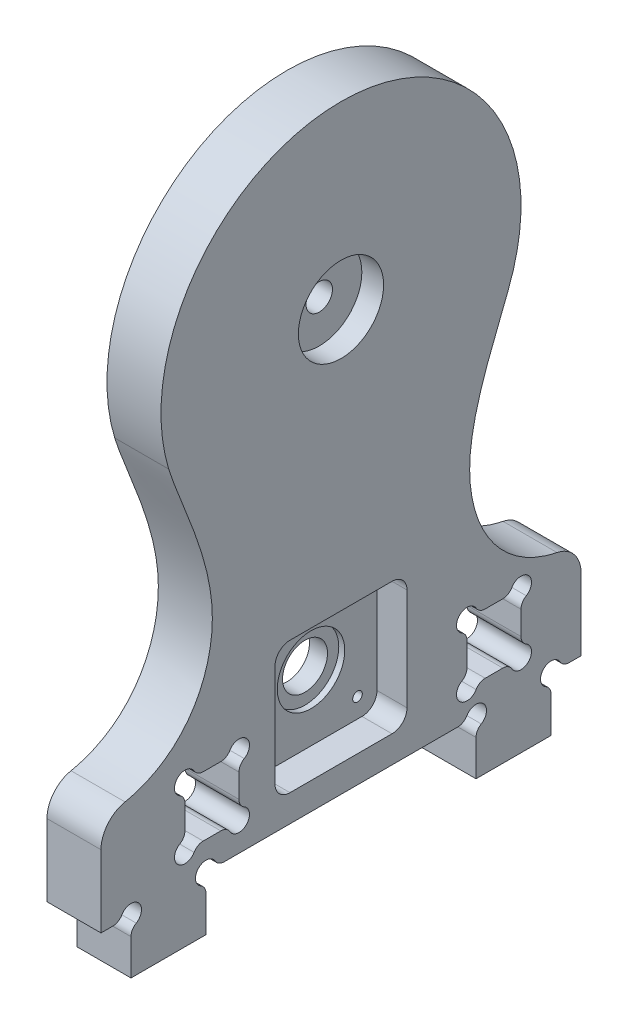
ISO-10303-21;
HEADER;
FILE_DESCRIPTION(('STEP AP214'),'2;1');
FILE_NAME('part.step','',(''),(''),'','','');
FILE_SCHEMA(('AUTOMOTIVE_DESIGN { 1 0 10303 214 1 1 1 1 }'));
ENDSEC;
DATA;
#1=APPLICATION_CONTEXT('core data for automotive mechanical design processes');
#2=APPLICATION_PROTOCOL_DEFINITION('international standard','automotive_design',2000,#1);
#3=PRODUCT_CONTEXT('',#1,'mechanical');
#4=PRODUCT('Part','Part','',(#3));
#5=PRODUCT_RELATED_PRODUCT_CATEGORY('part','',(#4));
#6=PRODUCT_DEFINITION_FORMATION('','',#4);
#7=PRODUCT_DEFINITION_CONTEXT('part definition',#1,'design');
#8=PRODUCT_DEFINITION('design','',#6,#7);
#9=PRODUCT_DEFINITION_SHAPE('','',#8);
#10=(LENGTH_UNIT() NAMED_UNIT(*) SI_UNIT(.MILLI.,.METRE.));
#11=(NAMED_UNIT(*) PLANE_ANGLE_UNIT() SI_UNIT($,.RADIAN.));
#12=(NAMED_UNIT(*) SI_UNIT($,.STERADIAN.) SOLID_ANGLE_UNIT());
#13=UNCERTAINTY_MEASURE_WITH_UNIT(LENGTH_MEASURE(1.E-05),#10,'distance_accuracy_value','');
#14=(GEOMETRIC_REPRESENTATION_CONTEXT(3) GLOBAL_UNCERTAINTY_ASSIGNED_CONTEXT((#13)) GLOBAL_UNIT_ASSIGNED_CONTEXT((#10,
#11,#12)) REPRESENTATION_CONTEXT('',''));
#15=CARTESIAN_POINT('',(0.,0.,0.));
#16=DIRECTION('',(0.,0.,1.));
#17=DIRECTION('',(1.,0.,0.));
#18=AXIS2_PLACEMENT_3D('',#15,#16,#17);
#19=CARTESIAN_POINT('',(152.25,15.,-61.));
#20=DIRECTION('',(-1.,0.,0.));
#21=DIRECTION('',(0.,-1.,0.));
#22=AXIS2_PLACEMENT_3D('',#19,#20,#21);
#23=CYLINDRICAL_SURFACE('',#22,1.64999999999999);
#24=CARTESIAN_POINT('',(129.25,15.,-61.));
#25=DIRECTION('',(1.,0.,0.));
#26=DIRECTION('',(0.,1.,0.));
#27=AXIS2_PLACEMENT_3D('',#24,#25,#26);
#28=CIRCLE('',#27,1.64999999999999);
#29=CARTESIAN_POINT('',(129.25,16.65,-61.));
#30=VERTEX_POINT('',#29);
#31=EDGE_CURVE('E649',#30,#30,#28,.F.);
#32=ORIENTED_EDGE('',*,*,#31,.T.);
#33=EDGE_LOOP('',(#32));
#34=FACE_BOUND('',#33,.T.);
#35=CARTESIAN_POINT('',(133.25,15.,-61.));
#36=DIRECTION('',(1.,0.,0.));
#37=DIRECTION('',(0.,0.,-1.));
#38=AXIS2_PLACEMENT_3D('',#35,#36,#37);
#39=CIRCLE('',#38,1.64999999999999);
#40=CARTESIAN_POINT('',(133.25,15.,-62.65));
#41=VERTEX_POINT('',#40);
#42=EDGE_CURVE('E1181',#41,#41,#39,.F.);
#43=ORIENTED_EDGE('',*,*,#42,.F.);
#44=EDGE_LOOP('',(#43));
#45=FACE_BOUND('',#44,.T.);
#46=ADVANCED_FACE('F80',(#34,#45),#23,.F.);
#47=CARTESIAN_POINT('',(0.,-20.,0.));
#48=DIRECTION('',(0.,-1.,0.));
#49=DIRECTION('',(0.,0.,-1.));
#50=AXIS2_PLACEMENT_3D('',#47,#48,#49);
#51=PLANE('',#50);
#52=DIRECTION('',(0.,0.,-1.));
#53=VECTOR('',#52,1.);
#54=CARTESIAN_POINT('',(147.25,-20.,0.));
#55=LINE('',#54,#53);
#56=CARTESIAN_POINT('',(147.25,-20.,-156.062177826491));
#57=VERTEX_POINT('',#56);
#58=CARTESIAN_POINT('',(147.25,-20.,-160.));
#59=VERTEX_POINT('',#58);
#60=EDGE_CURVE('E582',#57,#59,#55,.T.);
#61=ORIENTED_EDGE('',*,*,#60,.F.);
#62=DIRECTION('',(-1.,0.,0.));
#63=VECTOR('',#62,1.);
#64=CARTESIAN_POINT('',(129.25,-20.,-156.062177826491));
#65=LINE('',#64,#63);
#66=CARTESIAN_POINT('',(129.25,-20.,-156.062177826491));
#67=VERTEX_POINT('',#66);
#68=EDGE_CURVE('E1132',#57,#67,#65,.T.);
#69=ORIENTED_EDGE('',*,*,#68,.T.);
#70=DIRECTION('',(0.,0.,1.));
#71=VECTOR('',#70,1.);
#72=CARTESIAN_POINT('',(129.25,-20.,0.));
#73=LINE('',#72,#71);
#74=CARTESIAN_POINT('',(129.25,-20.,-160.));
#75=VERTEX_POINT('',#74);
#76=EDGE_CURVE('E636',#75,#67,#73,.T.);
#77=ORIENTED_EDGE('',*,*,#76,.F.);
#78=DIRECTION('',(1.,0.,0.));
#79=VECTOR('',#78,1.);
#80=CARTESIAN_POINT('',(0.,-20.,-160.));
#81=LINE('',#80,#79);
#82=EDGE_CURVE('E737',#75,#59,#81,.T.);
#83=ORIENTED_EDGE('',*,*,#82,.T.);
#84=EDGE_LOOP('',(#61,#69,#77,#83));
#85=FACE_BOUND('',#84,.T.);
#86=ADVANCED_FACE('F940',(#85),#51,.T.);
#87=CARTESIAN_POINT('',(129.25,-20.,-3.93782217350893));
#88=VERTEX_POINT('',#87);
#89=CARTESIAN_POINT('',(129.25,-20.,0.));
#90=VERTEX_POINT('',#89);
#91=EDGE_CURVE('E635',#88,#90,#73,.T.);
#92=ORIENTED_EDGE('',*,*,#91,.F.);
#93=DIRECTION('',(-1.,0.,0.));
#94=VECTOR('',#93,1.);
#95=CARTESIAN_POINT('',(147.25,-20.,-3.93782217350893));
#96=LINE('',#95,#94);
#97=CARTESIAN_POINT('',(147.25,-20.,-3.93782217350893));
#98=VERTEX_POINT('',#97);
#99=EDGE_CURVE('E1178',#88,#98,#96,.F.);
#100=ORIENTED_EDGE('',*,*,#99,.T.);
#101=CARTESIAN_POINT('',(147.25,-20.,0.));
#102=VERTEX_POINT('',#101);
#103=EDGE_CURVE('E583',#102,#98,#55,.T.);
#104=ORIENTED_EDGE('',*,*,#103,.F.);
#105=DIRECTION('',(-1.,0.,0.));
#106=VECTOR('',#105,1.);
#107=CARTESIAN_POINT('',(0.,-20.,0.));
#108=LINE('',#107,#106);
#109=EDGE_CURVE('E760',#102,#90,#108,.T.);
#110=ORIENTED_EDGE('',*,*,#109,.T.);
#111=EDGE_LOOP('',(#92,#100,#104,#110));
#112=FACE_BOUND('',#111,.T.);
#113=ADVANCED_FACE('F946',(#112),#51,.T.);
#114=CARTESIAN_POINT('',(195.,102.608308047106,-137.424115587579));
#115=CARTESIAN_POINT('',(195.,90.6119505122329,-133.79085188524));
#116=CARTESIAN_POINT('',(195.,49.0425531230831,-111.093409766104));
#117=CARTESIAN_POINT('',(195.,13.2588947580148,-135.60703939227));
#118=CARTESIAN_POINT('',(195.,13.,-160.));
#119=B_SPLINE_CURVE_WITH_KNOTS('',3,(#114,#115,#116,#117,#118),.UNSPECIFIED.,.F.,.F.,(4,1,4),
(0.,0.462172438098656,1.),.UNSPECIFIED.);
#120=DIRECTION('',(-1.,0.,0.));
#121=VECTOR('',#120,1.);
#122=SURFACE_OF_LINEAR_EXTRUSION('',#119,#121);
#123=CARTESIAN_POINT('',(147.25,102.608308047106,-137.424115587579));
#124=CARTESIAN_POINT('',(147.25,90.6119505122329,-133.79085188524));
#125=CARTESIAN_POINT('',(147.25,49.0425531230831,-111.093409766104));
#126=CARTESIAN_POINT('',(147.25,13.2588947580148,-135.60703939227));
#127=CARTESIAN_POINT('',(147.25,13.,-160.));
#128=B_SPLINE_CURVE_WITH_KNOTS('',3,(#123,#124,#125,#126,#127),.UNSPECIFIED.,.F.,.F.,(4,1,4),
(0.,0.462172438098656,1.),.UNSPECIFIED.);
#129=CARTESIAN_POINT('',(147.25,13.8250256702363,-151.989654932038));
#130=VERTEX_POINT('',#129);
#131=CARTESIAN_POINT('',(147.25,102.608308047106,-137.424115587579));
#132=VERTEX_POINT('',#131);
#133=EDGE_CURVE('E589',#130,#132,#128,.F.);
#134=ORIENTED_EDGE('',*,*,#133,.F.);
#135=DIRECTION('',(-1.,0.,0.));
#136=VECTOR('',#135,1.);
#137=CARTESIAN_POINT('',(160.,13.8250256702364,-151.989654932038));
#138=LINE('',#137,#136);
#139=CARTESIAN_POINT('',(129.25,13.8250256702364,-151.989654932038));
#140=VERTEX_POINT('',#139);
#141=EDGE_CURVE('E827',#130,#140,#138,.T.);
#142=ORIENTED_EDGE('',*,*,#141,.T.);
#143=CARTESIAN_POINT('',(129.25,102.608308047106,-137.424115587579));
#144=CARTESIAN_POINT('',(129.25,90.6119505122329,-133.79085188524));
#145=CARTESIAN_POINT('',(129.25,49.0425531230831,-111.093409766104));
#146=CARTESIAN_POINT('',(129.25,13.2588947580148,-135.60703939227));
#147=CARTESIAN_POINT('',(129.25,13.,-160.));
#148=B_SPLINE_CURVE_WITH_KNOTS('',3,(#143,#144,#145,#146,#147),.UNSPECIFIED.,.F.,.F.,(4,1,4),
(0.,0.462172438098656,1.),.UNSPECIFIED.);
#149=CARTESIAN_POINT('',(129.25,52.6631755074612,-122.883877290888));
#150=VERTEX_POINT('',#149);
#151=EDGE_CURVE('E644',#150,#140,#148,.T.);
#152=ORIENTED_EDGE('',*,*,#151,.F.);
#153=CARTESIAN_POINT('',(129.25,135.453437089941,-147.371719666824));
#154=CARTESIAN_POINT('',(128.25,135.453437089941,-147.371719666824));
#155=CARTESIAN_POINT('',(128.25,135.743298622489,-146.414651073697));
#156=CARTESIAN_POINT('',(129.25,124.505060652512,-144.055851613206));
#157=CARTESIAN_POINT('',(128.25,124.505060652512,-144.055851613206));
#158=CARTESIAN_POINT('',(128.25,124.794922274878,-143.098783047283));
#159=CARTESIAN_POINT('',(129.25,113.556684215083,-140.739983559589));
#160=CARTESIAN_POINT('',(128.25,113.556684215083,-140.739983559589));
#161=CARTESIAN_POINT('',(128.25,113.846545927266,-139.782915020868));
#162=CARTESIAN_POINT('',(129.25,102.608307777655,-137.424115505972));
#163=CARTESIAN_POINT('',(128.25,102.608307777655,-137.424115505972));
#164=CARTESIAN_POINT('',(128.25,102.898169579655,-136.467046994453));
#165=CARTESIAN_POINT('',(129.25,102.265915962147,-137.320359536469));
#166=CARTESIAN_POINT('',(128.25,102.265915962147,-137.320359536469));
#167=CARTESIAN_POINT('',(128.25,102.562256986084,-136.365258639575));
#168=CARTESIAN_POINT('',(129.25,101.92523058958,-137.213432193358));
#169=CARTESIAN_POINT('',(128.25,101.92523058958,-137.213432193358));
#170=CARTESIAN_POINT('',(128.25,102.227371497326,-136.260154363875));
#171=CARTESIAN_POINT('',(129.25,101.246791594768,-136.994310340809));
#172=CARTESIAN_POINT('',(128.25,101.246791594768,-136.99431034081));
#173=CARTESIAN_POINT('',(128.25,101.559417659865,-136.044416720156));
#174=CARTESIAN_POINT('',(129.25,100.909037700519,-136.882116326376));
#175=CARTESIAN_POINT('',(128.25,100.909037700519,-136.882116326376));
#176=CARTESIAN_POINT('',(128.25,101.22634914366,-135.933783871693));
#177=CARTESIAN_POINT('',(129.25,100.23602407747,-136.653553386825));
#178=CARTESIAN_POINT('',(128.25,100.23602407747,-136.653553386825));
#179=CARTESIAN_POINT('',(128.25,100.561835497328,-135.708108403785));
#180=CARTESIAN_POINT('',(129.25,99.9007635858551,-136.537185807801));
#181=CARTESIAN_POINT('',(128.25,99.9007635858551,-136.537185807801));
#182=CARTESIAN_POINT('',(128.25,100.230389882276,-135.593067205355));
#183=CARTESIAN_POINT('',(129.25,99.2322312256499,-136.301020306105));
#184=CARTESIAN_POINT('',(128.25,99.2322312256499,-136.301020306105));
#185=CARTESIAN_POINT('',(128.25,99.5687766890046,-135.359345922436));
#186=CARTESIAN_POINT('',(129.25,98.8989594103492,-136.181222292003));
#187=CARTESIAN_POINT('',(128.25,98.8989594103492,-136.181222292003));
#188=CARTESIAN_POINT('',(128.25,99.2386091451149,-135.240665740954));
#189=CARTESIAN_POINT('',(129.25,97.9020313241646,-135.817851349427));
#190=CARTESIAN_POINT('',(128.25,97.9020313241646,-135.817851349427));
#191=CARTESIAN_POINT('',(128.25,98.2501181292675,-134.880369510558));
#192=CARTESIAN_POINT('',(129.25,97.2408500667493,-135.570159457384));
#193=CARTESIAN_POINT('',(128.25,97.2408500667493,-135.570159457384));
#194=CARTESIAN_POINT('',(128.25,97.5933988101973,-134.634357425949));
#195=CARTESIAN_POINT('',(129.25,95.9229829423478,-135.067799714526));
#196=CARTESIAN_POINT('',(128.25,95.9229829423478,-135.067799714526));
#197=CARTESIAN_POINT('',(128.25,96.2827974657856,-134.134768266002));
#198=CARTESIAN_POINT('',(129.25,95.26629749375,-134.813131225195));
#199=CARTESIAN_POINT('',(128.25,95.26629749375,-134.813131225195));
#200=CARTESIAN_POINT('',(128.25,95.6289157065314,-133.881190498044));
#201=CARTESIAN_POINT('',(129.25,93.9545837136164,-134.299215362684));
#202=CARTESIAN_POINT('',(128.25,93.9545837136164,-134.299215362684));
#203=CARTESIAN_POINT('',(128.25,94.3215506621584,-133.36897846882));
#204=CARTESIAN_POINT('',(129.25,93.2995617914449,-134.039959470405));
#205=CARTESIAN_POINT('',(128.25,93.299561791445,-134.039959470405));
#206=CARTESIAN_POINT('',(128.25,93.6680711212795,-133.110334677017));
#207=CARTESIAN_POINT('',(129.25,91.9914069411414,-133.519704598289));
#208=CARTESIAN_POINT('',(128.25,91.9914069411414,-133.519704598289));
#209=CARTESIAN_POINT('',(128.25,92.3619908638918,-132.590905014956));
#210=CARTESIAN_POINT('',(129.25,91.3382739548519,-133.258705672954));
#211=CARTESIAN_POINT('',(128.25,91.3382739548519,-133.258705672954));
#212=CARTESIAN_POINT('',(128.25,91.7093901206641,-132.330119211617));
#213=CARTESIAN_POINT('',(129.25,90.0328423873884,-132.736798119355));
#214=CARTESIAN_POINT('',(128.25,90.0328423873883,-132.736798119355));
#215=CARTESIAN_POINT('',(128.25,90.4041819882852,-131.808300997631));
#216=CARTESIAN_POINT('',(129.25,89.3805439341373,-132.475889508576));
#217=CARTESIAN_POINT('',(128.25,89.3805439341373,-132.475889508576));
#218=CARTESIAN_POINT('',(128.25,89.7515746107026,-131.54726855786));
#219=CARTESIAN_POINT('',(129.25,88.0761022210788,-131.955792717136));
#220=CARTESIAN_POINT('',(128.25,88.0761022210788,-131.955792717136));
#221=CARTESIAN_POINT('',(128.25,88.4457844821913,-131.02663425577));
#222=CARTESIAN_POINT('',(129.25,87.4239589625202,-131.696604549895));
#223=CARTESIAN_POINT('',(128.25,87.4239589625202,-131.696604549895));
#224=CARTESIAN_POINT('',(128.25,87.7926017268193,-130.767032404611));
#225=CARTESIAN_POINT('',(129.25,85.4147157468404,-130.903223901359));
#226=CARTESIAN_POINT('',(128.25,85.4147157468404,-130.903223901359));
#227=CARTESIAN_POINT('',(128.25,85.7791532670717,-129.971990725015));
#228=CARTESIAN_POINT('',(129.25,84.0567731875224,-130.37428341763));
#229=CARTESIAN_POINT('',(128.25,84.0567731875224,-130.37428341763));
#230=CARTESIAN_POINT('',(128.25,84.4169610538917,-129.441385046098));
#231=CARTESIAN_POINT('',(129.25,81.3341297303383,-129.341411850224));
#232=CARTESIAN_POINT('',(128.25,81.3341297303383,-129.341411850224));
#233=CARTESIAN_POINT('',(128.25,81.6833205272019,-128.404341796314));
#234=CARTESIAN_POINT('',(129.25,79.9694287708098,-128.837480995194));
#235=CARTESIAN_POINT('',(128.25,79.9694287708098,-128.837480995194));
#236=CARTESIAN_POINT('',(128.25,80.3118721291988,-127.897904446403));
#237=CARTESIAN_POINT('',(129.25,77.2316341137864,-127.865862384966));
#238=CARTESIAN_POINT('',(128.25,77.2316341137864,-127.865862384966));
#239=CARTESIAN_POINT('',(128.25,77.5581037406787,-126.920616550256));
#240=CARTESIAN_POINT('',(129.25,75.858552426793,-127.398131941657));
#241=CARTESIAN_POINT('',(128.25,75.858552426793,-127.398131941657));
#242=CARTESIAN_POINT('',(128.25,76.1757987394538,-126.4497241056));
#243=CARTESIAN_POINT('',(129.25,73.1002316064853,-126.509349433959));
#244=CARTESIAN_POINT('',(128.25,73.1002316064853,-126.509349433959));
#245=CARTESIAN_POINT('',(128.25,73.3963643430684,-125.554138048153));
#246=CARTESIAN_POINT('',(129.25,71.7149940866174,-126.088291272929));
#247=CARTESIAN_POINT('',(128.25,71.7149940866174,-126.088291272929));
#248=CARTESIAN_POINT('',(128.25,71.9992369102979,-125.129438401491));
#249=CARTESIAN_POINT('',(129.25,68.8474075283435,-125.281452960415));
#250=CARTESIAN_POINT('',(128.25,68.8474075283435,-125.281452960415));
#251=CARTESIAN_POINT('',(128.25,69.1040507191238,-124.314833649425));
#252=CARTESIAN_POINT('',(129.25,67.364216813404,-124.899303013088));
#253=CARTESIAN_POINT('',(128.25,67.364216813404,-124.899303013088));
#254=CARTESIAN_POINT('',(128.25,67.6049639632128,-123.928542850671));
#255=CARTESIAN_POINT('',(129.25,64.381824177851,-124.217497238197));
#256=CARTESIAN_POINT('',(128.25,64.381824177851,-124.217497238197));
#257=CARTESIAN_POINT('',(128.25,64.5867904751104,-123.238554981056));
#258=CARTESIAN_POINT('',(129.25,62.8826163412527,-123.917873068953));
#259=CARTESIAN_POINT('',(128.25,62.8826163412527,-123.917873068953));
#260=CARTESIAN_POINT('',(128.25,63.0676963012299,-122.934889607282));
#261=CARTESIAN_POINT('',(129.25,60.6353561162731,-123.546968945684));
#262=CARTESIAN_POINT('',(128.25,60.6353561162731,-123.546968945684));
#263=CARTESIAN_POINT('',(128.25,60.7872524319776,-122.558511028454));
#264=CARTESIAN_POINT('',(129.25,59.8919055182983,-123.436943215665));
#265=CARTESIAN_POINT('',(128.25,59.8919055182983,-123.436943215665));
#266=CARTESIAN_POINT('',(128.25,60.0322768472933,-122.446768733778));
#267=CARTESIAN_POINT('',(129.25,58.4025912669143,-123.244373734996));
#268=CARTESIAN_POINT('',(128.25,58.4025912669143,-123.244373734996));
#269=CARTESIAN_POINT('',(128.25,58.5186814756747,-122.251059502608));
#270=CARTESIAN_POINT('',(129.25,57.6567275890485,-123.161830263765));
#271=CARTESIAN_POINT('',(128.25,57.6567275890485,-123.161830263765));
#272=CARTESIAN_POINT('',(128.25,57.760061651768,-122.167092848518));
#273=CARTESIAN_POINT('',(129.25,56.1637715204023,-123.027018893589));
#274=CARTESIAN_POINT('',(128.25,56.1637715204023,-123.027018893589));
#275=CARTESIAN_POINT('',(128.25,56.2403137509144,-122.029861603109));
#276=CARTESIAN_POINT('',(129.25,55.4166797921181,-122.974738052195));
#277=CARTESIAN_POINT('',(128.25,55.4166797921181,-122.974738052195));
#278=CARTESIAN_POINT('',(128.25,55.4791868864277,-121.976583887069));
#279=CARTESIAN_POINT('',(129.25,54.2959539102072,-122.921146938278));
#280=CARTESIAN_POINT('',(128.25,54.2959539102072,-122.921146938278));
#281=CARTESIAN_POINT('',(128.25,54.3363391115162,-121.921935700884));
#282=CARTESIAN_POINT('',(129.25,53.9223641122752,-122.907421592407));
#283=CARTESIAN_POINT('',(128.25,53.9223641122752,-122.907421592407));
#284=CARTESIAN_POINT('',(128.25,53.9551971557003,-121.907931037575));
#285=CARTESIAN_POINT('',(129.25,53.1752136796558,-122.888628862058));
#286=CARTESIAN_POINT('',(128.25,53.1752136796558,-122.888628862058));
#287=CARTESIAN_POINT('',(128.25,53.19269306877,-121.888752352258));
#288=CARTESIAN_POINT('',(129.25,52.801653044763,-122.883561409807));
#289=CARTESIAN_POINT('',(128.25,52.801653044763,-122.883561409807));
#290=CARTESIAN_POINT('',(128.25,52.8113309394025,-121.883578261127));
#291=CARTESIAN_POINT('',(129.25,51.812965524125,-122.881710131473));
#292=CARTESIAN_POINT('',(128.25,51.812965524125,-122.881710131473));
#293=CARTESIAN_POINT('',(128.25,51.8019759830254,-121.881687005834));
#294=CARTESIAN_POINT('',(129.25,51.1978171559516,-122.892400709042));
#295=CARTESIAN_POINT('',(128.25,51.1978171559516,-122.892400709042));
#296=CARTESIAN_POINT('',(128.25,51.1739485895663,-121.892600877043));
#297=CARTESIAN_POINT('',(129.25,49.9686404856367,-122.937704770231));
#298=CARTESIAN_POINT('',(128.25,49.9686404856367,-122.937704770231));
#299=CARTESIAN_POINT('',(128.25,49.9188428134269,-121.938861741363));
#300=CARTESIAN_POINT('',(129.25,49.3546121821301,-122.972318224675));
#301=CARTESIAN_POINT('',(128.25,49.3546121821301,-122.972318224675));
#302=CARTESIAN_POINT('',(128.25,49.2917644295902,-121.974208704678));
#303=CARTESIAN_POINT('',(129.25,47.5154944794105,-123.112444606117));
#304=CARTESIAN_POINT('',(128.25,47.5154944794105,-123.112444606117));
#305=CARTESIAN_POINT('',(128.25,47.4132845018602,-122.117332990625));
#306=CARTESIAN_POINT('',(129.25,46.2932197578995,-123.254243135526));
#307=CARTESIAN_POINT('',(128.25,46.2932197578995,-123.254243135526));
#308=CARTESIAN_POINT('',(128.25,46.1644824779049,-122.262193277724));
#309=CARTESIAN_POINT('',(129.25,43.8379346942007,-123.640876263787));
#310=CARTESIAN_POINT('',(128.25,43.8379346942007,-123.640876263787));
#311=CARTESIAN_POINT('',(128.25,43.6549647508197,-122.65736569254));
#312=CARTESIAN_POINT('',(129.25,42.6052970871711,-123.887947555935));
#313=CARTESIAN_POINT('',(128.25,42.6052970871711,-123.887947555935));
#314=CARTESIAN_POINT('',(128.25,42.3946087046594,-122.90996708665));
#315=CARTESIAN_POINT('',(129.25,40.16664144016,-124.487289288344));
#316=CARTESIAN_POINT('',(128.25,40.16664144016,-124.487289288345));
#317=CARTESIAN_POINT('',(128.25,39.8999848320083,-123.523069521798));
#318=CARTESIAN_POINT('',(129.25,38.9606335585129,-124.839599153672));
#319=CARTESIAN_POINT('',(128.25,38.960633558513,-124.839599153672));
#320=CARTESIAN_POINT('',(128.25,38.6657269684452,-123.883611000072));
#321=CARTESIAN_POINT('',(129.25,37.7731170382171,-125.245422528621));
#322=CARTESIAN_POINT('',(128.25,37.7731170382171,-125.245422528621));
#323=CARTESIAN_POINT('',(128.25,37.4497412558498,-124.299151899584));
#324=(BOUNDED_SURFACE() B_SPLINE_SURFACE(3,2,((#153,#154,#155),(#156,#157,#158),(#159,#160,
#161),(#162,#163,#164),(#165,#166,#167),(#168,#169,#170),(#171,#172,#173),(#174,#175,#176),
(#177,#178,#179),(#180,#181,#182),(#183,#184,#185),(#186,#187,#188),(#189,#190,#191),(#192,#193,
#194),(#195,#196,#197),(#198,#199,#200),(#201,#202,#203),(#204,#205,#206),(#207,#208,#209),
(#210,#211,#212),(#213,#214,#215),(#216,#217,#218),(#219,#220,#221),(#222,#223,#224),(#225,#226,
#227),(#228,#229,#230),(#231,#232,#233),(#234,#235,#236),(#237,#238,#239),(#240,#241,#242),
(#243,#244,#245),(#246,#247,#248),(#249,#250,#251),(#252,#253,#254),(#255,#256,#257),(#258,#259,
#260),(#261,#262,#263),(#264,#265,#266),(#267,#268,#269),(#270,#271,#272),(#273,#274,#275),
(#276,#277,#278),(#279,#280,#281),(#282,#283,#284),(#285,#286,#287),(#288,#289,#290),(#291,#292,
#293),(#294,#295,#296),(#297,#298,#299),(#300,#301,#302),(#303,#304,#305),(#306,#307,#308),
(#309,#310,#311),(#312,#313,#314),(#315,#316,#317),(#318,#319,#320),(#321,#322,#323)),
.UNSPECIFIED.,.F.,.F.,.F.) B_SPLINE_SURFACE_WITH_KNOTS((4,3,2,2,2,2,2,2,2,2,2,2,2,2,2,2,2,2,2,2,
2,2,2,2,2,2,2,4),(3,3),(0.,34.3184692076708,35.3714090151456,36.4242500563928,37.4767545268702,
38.5292870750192,40.6330595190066,42.7370251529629,44.8454250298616,46.9537592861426,
49.0623851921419,51.1710275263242,55.556556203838,59.9421249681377,64.322440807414,
68.7021837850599,73.3445946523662,77.9887839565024,80.2779603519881,82.5671600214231,
84.855379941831,85.9994886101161,87.1435883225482,89.0274283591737,90.9112660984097,
94.6784757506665,98.5300644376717,102.383097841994),(0.,1.),
.UNSPECIFIED.) GEOMETRIC_REPRESENTATION_ITEM() RATIONAL_B_SPLINE_SURFACE(((1.,0.707106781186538,
1.),(1.,0.707106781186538,1.),(1.,0.707106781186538,1.),(1.,0.707106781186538,1.),(1.,
0.707106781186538,1.),(1.,0.707106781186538,1.),(1.,0.707106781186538,1.),(1.,0.707106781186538,
1.),(1.,0.707106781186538,1.),(1.,0.707106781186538,1.),(1.,0.707106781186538,1.),(1.,
0.707106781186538,1.),(1.,0.707106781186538,1.),(1.,0.707106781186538,1.),(1.,0.707106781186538,
1.),(1.,0.707106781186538,1.),(1.,0.707106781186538,1.),(1.,0.707106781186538,1.),(1.,
0.707106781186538,1.),(1.,0.707106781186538,1.),(1.,0.707106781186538,1.),(1.,0.707106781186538,
1.),(1.,0.707106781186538,1.),(1.,0.707106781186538,1.),(1.,0.707106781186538,1.),(1.,
0.707106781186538,1.),(1.,0.707106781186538,1.),(1.,0.707106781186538,1.),(1.,0.707106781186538,
1.),(1.,0.707106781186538,1.),(1.,0.707106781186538,1.),(1.,0.707106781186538,1.),(1.,
0.707106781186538,1.),(1.,0.707106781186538,1.),(1.,0.707106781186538,1.),(1.,0.707106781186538,
1.),(1.,0.707106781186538,1.),(1.,0.707106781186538,1.),(1.,0.707106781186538,1.),(1.,
0.707106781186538,1.),(1.,0.707106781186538,1.),(1.,0.707106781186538,1.),(1.,0.707106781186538,
1.),(1.,0.707106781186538,1.),(1.,0.707106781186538,1.),(1.,0.707106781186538,1.),(1.,
0.707106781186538,1.),(1.,0.707106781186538,1.),(1.,0.707106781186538,1.),(1.,0.707106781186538,
1.),(1.,0.707106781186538,1.),(1.,0.707106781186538,1.),(1.,0.707106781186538,1.),(1.,
0.707106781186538,1.),(1.,0.707106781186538,1.),(1.,0.707106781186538,1.),(1.,0.707106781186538,1.))) REPRESENTATION_ITEM('') SURFACE());
#325=CARTESIAN_POINT('',(129.25,37.7731170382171,-125.245422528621));
#326=CARTESIAN_POINT('',(129.25,38.9606335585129,-124.839599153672));
#327=CARTESIAN_POINT('',(129.25,40.16664144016,-124.487289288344));
#328=CARTESIAN_POINT('',(129.25,42.6052970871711,-123.887947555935));
#329=CARTESIAN_POINT('',(129.25,43.8379346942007,-123.640876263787));
#330=CARTESIAN_POINT('',(129.25,46.2932197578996,-123.254243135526));
#331=CARTESIAN_POINT('',(129.25,47.5154944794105,-123.112444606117));
#332=CARTESIAN_POINT('',(129.25,49.3546121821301,-122.972318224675));
#333=CARTESIAN_POINT('',(129.25,49.9686404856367,-122.937704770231));
#334=CARTESIAN_POINT('',(129.25,51.1978171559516,-122.892400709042));
#335=CARTESIAN_POINT('',(129.25,51.812965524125,-122.881710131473));
#336=CARTESIAN_POINT('',(129.25,52.801653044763,-122.883561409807));
#337=CARTESIAN_POINT('',(129.25,53.1752136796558,-122.888628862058));
#338=CARTESIAN_POINT('',(129.25,53.9223641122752,-122.907421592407));
#339=CARTESIAN_POINT('',(129.25,54.2959539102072,-122.921146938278));
#340=CARTESIAN_POINT('',(129.25,55.4166797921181,-122.974738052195));
#341=CARTESIAN_POINT('',(129.25,56.1637715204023,-123.027018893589));
#342=CARTESIAN_POINT('',(129.25,57.6567275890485,-123.161830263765));
#343=CARTESIAN_POINT('',(129.25,58.4025912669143,-123.244373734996));
#344=CARTESIAN_POINT('',(129.25,59.8919055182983,-123.436943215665));
#345=CARTESIAN_POINT('',(129.25,60.6353561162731,-123.546968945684));
#346=CARTESIAN_POINT('',(129.25,62.8826163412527,-123.917873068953));
#347=CARTESIAN_POINT('',(129.25,64.381824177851,-124.217497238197));
#348=CARTESIAN_POINT('',(129.25,67.364216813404,-124.899303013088));
#349=CARTESIAN_POINT('',(129.25,68.8474075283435,-125.281452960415));
#350=CARTESIAN_POINT('',(129.25,71.7149940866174,-126.088291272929));
#351=CARTESIAN_POINT('',(129.25,73.1002316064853,-126.509349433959));
#352=CARTESIAN_POINT('',(129.25,75.858552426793,-127.398131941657));
#353=CARTESIAN_POINT('',(129.25,77.2316341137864,-127.865862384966));
#354=CARTESIAN_POINT('',(129.25,79.9694287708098,-128.837480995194));
#355=CARTESIAN_POINT('',(129.25,81.3341297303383,-129.341411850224));
#356=CARTESIAN_POINT('',(129.25,84.0567731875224,-130.37428341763));
#357=CARTESIAN_POINT('',(129.25,85.4147157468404,-130.903223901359));
#358=CARTESIAN_POINT('',(129.25,87.4239589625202,-131.696604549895));
#359=CARTESIAN_POINT('',(129.25,88.0761022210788,-131.955792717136));
#360=CARTESIAN_POINT('',(129.25,89.3805439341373,-132.475889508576));
#361=CARTESIAN_POINT('',(129.25,90.0328423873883,-132.736798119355));
#362=CARTESIAN_POINT('',(129.25,91.3382739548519,-133.258705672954));
#363=CARTESIAN_POINT('',(129.25,91.9914069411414,-133.519704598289));
#364=CARTESIAN_POINT('',(129.25,93.299561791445,-134.039959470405));
#365=CARTESIAN_POINT('',(129.25,93.9545837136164,-134.299215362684));
#366=CARTESIAN_POINT('',(129.25,95.26629749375,-134.813131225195));
#367=CARTESIAN_POINT('',(129.25,95.9229829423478,-135.067799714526));
#368=CARTESIAN_POINT('',(129.25,97.2408500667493,-135.570159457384));
#369=CARTESIAN_POINT('',(129.25,97.9020313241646,-135.817851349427));
#370=CARTESIAN_POINT('',(129.25,98.8989594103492,-136.181222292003));
#371=CARTESIAN_POINT('',(129.25,99.2322312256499,-136.301020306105));
#372=CARTESIAN_POINT('',(129.25,99.9007635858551,-136.537185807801));
#373=CARTESIAN_POINT('',(129.25,100.23602407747,-136.653553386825));
#374=CARTESIAN_POINT('',(129.25,100.909037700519,-136.882116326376));
#375=CARTESIAN_POINT('',(129.25,101.246791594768,-136.994310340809));
#376=CARTESIAN_POINT('',(129.25,101.92523058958,-137.213432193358));
#377=CARTESIAN_POINT('',(129.25,102.265915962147,-137.320359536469));
#378=CARTESIAN_POINT('',(129.25,102.608307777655,-137.424115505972));
#379=CARTESIAN_POINT('',(129.25,113.556684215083,-140.739983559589));
#380=CARTESIAN_POINT('',(129.25,124.505060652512,-144.055851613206));
#381=CARTESIAN_POINT('',(129.25,135.453437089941,-147.371719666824));
#382=B_SPLINE_CURVE_WITH_KNOTS('',3,(#325,#326,#327,#328,#329,#330,#331,#332,#333,#334,#335,
#336,#337,#338,#339,#340,#341,#342,#343,#344,#345,#346,#347,#348,#349,#350,#351,#352,#353,#354,
#355,#356,#357,#358,#359,#360,#361,#362,#363,#364,#365,#366,#367,#368,#369,#370,#371,#372,#373,
#374,#375,#376,#377,#378,#379,#380,#381),.UNSPECIFIED.,.F.,.F.,(4,2,2,2,2,2,2,2,2,2,2,2,2,2,2,2,
2,2,2,2,2,2,2,2,2,2,3,4),(0.,3.85303340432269,7.70462209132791,11.4718317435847,
13.3556694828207,15.2395095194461,16.3836092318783,17.5277179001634,19.8159378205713,
22.1051374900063,24.3943138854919,29.0385031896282,33.6809140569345,38.0606570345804,
42.4409728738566,46.8265416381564,51.2120703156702,53.3207126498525,55.4293385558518,
57.5376728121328,59.6460726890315,61.7500383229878,63.8538107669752,64.9063433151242,
65.9588477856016,67.0116888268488,68.0646286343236,102.383097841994),.UNSPECIFIED.);
#383=CARTESIAN_POINT('',(129.25,102.608308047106,-137.424115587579));
#384=VERTEX_POINT('',#383);
#385=EDGE_CURVE('E1096',#150,#384,#382,.T.);
#386=ORIENTED_EDGE('',*,*,#385,.T.);
#387=DIRECTION('',(-1.,0.,0.));
#388=VECTOR('',#387,1.);
#389=CARTESIAN_POINT('',(195.,102.608308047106,-137.424115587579));
#390=LINE('',#389,#388);
#391=EDGE_CURVE('E769',#132,#384,#390,.T.);
#392=ORIENTED_EDGE('',*,*,#391,.F.);
#393=EDGE_LOOP('',(#134,#142,#152,#386,#392));
#394=FACE_BOUND('',#393,.T.);
#395=ADVANCED_FACE('F1106',(#394),#122,.T.);
#396=CARTESIAN_POINT('',(0.,180.,-160.));
#397=DIRECTION('',(0.,0.,-1.));
#398=DIRECTION('',(-1.,0.,0.));
#399=AXIS2_PLACEMENT_3D('',#396,#397,#398);
#400=PLANE('',#399);
#401=DIRECTION('',(0.,1.,0.));
#402=VECTOR('',#401,1.);
#403=CARTESIAN_POINT('',(147.25,180.,-160.));
#404=LINE('',#403,#402);
#405=CARTESIAN_POINT('',(147.25,4.02496070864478,-160.));
#406=VERTEX_POINT('',#405);
#407=EDGE_CURVE('E586',#59,#406,#404,.T.);
#408=ORIENTED_EDGE('',*,*,#407,.F.);
#409=ORIENTED_EDGE('',*,*,#82,.F.);
#410=DIRECTION('',(0.,-1.,0.));
#411=VECTOR('',#410,1.);
#412=CARTESIAN_POINT('',(129.25,180.,-160.));
#413=LINE('',#412,#411);
#414=CARTESIAN_POINT('',(129.25,4.02496070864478,-160.));
#415=VERTEX_POINT('',#414);
#416=EDGE_CURVE('E639',#415,#75,#413,.T.);
#417=ORIENTED_EDGE('',*,*,#416,.F.);
#418=DIRECTION('',(-1.,0.,0.));
#419=VECTOR('',#418,1.);
#420=CARTESIAN_POINT('',(0.,4.02496070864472,-160.));
#421=LINE('',#420,#419);
#422=EDGE_CURVE('E1127',#415,#406,#421,.F.);
#423=ORIENTED_EDGE('',*,*,#422,.T.);
#424=EDGE_LOOP('',(#408,#409,#417,#423));
#425=FACE_BOUND('',#424,.T.);
#426=ADVANCED_FACE('F1115',(#425),#400,.T.);
#427=CARTESIAN_POINT('',(0.,180.,0.));
#428=DIRECTION('',(0.,0.,-1.));
#429=DIRECTION('',(-1.,0.,0.));
#430=AXIS2_PLACEMENT_3D('',#427,#428,#429);
#431=PLANE('',#430);
#432=ORIENTED_EDGE('',*,*,#109,.F.);
#433=DIRECTION('',(0.,1.,0.));
#434=VECTOR('',#433,1.);
#435=CARTESIAN_POINT('',(147.25,180.,0.));
#436=LINE('',#435,#434);
#437=CARTESIAN_POINT('',(147.25,4.02496070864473,0.));
#438=VERTEX_POINT('',#437);
#439=EDGE_CURVE('E574',#102,#438,#436,.T.);
#440=ORIENTED_EDGE('',*,*,#439,.T.);
#441=DIRECTION('',(-1.,0.,0.));
#442=VECTOR('',#441,1.);
#443=CARTESIAN_POINT('',(0.,4.02496070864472,0.));
#444=LINE('',#443,#442);
#445=CARTESIAN_POINT('',(129.25,4.02496070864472,0.));
#446=VERTEX_POINT('',#445);
#447=EDGE_CURVE('E1454',#438,#446,#444,.T.);
#448=ORIENTED_EDGE('',*,*,#447,.T.);
#449=DIRECTION('',(0.,-1.,0.));
#450=VECTOR('',#449,1.);
#451=CARTESIAN_POINT('',(129.25,180.,0.));
#452=LINE('',#451,#450);
#453=EDGE_CURVE('E629',#446,#90,#452,.T.);
#454=ORIENTED_EDGE('',*,*,#453,.T.);
#455=EDGE_LOOP('',(#432,#440,#448,#454));
#456=FACE_BOUND('',#455,.T.);
#457=ADVANCED_FACE('F788',(#456),#431,.F.);
#458=CARTESIAN_POINT('',(195.,102.608308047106,-22.5758844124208));
#459=CARTESIAN_POINT('',(195.,90.6119505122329,-26.2091481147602));
#460=CARTESIAN_POINT('',(195.,49.0425531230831,-48.9065902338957));
#461=CARTESIAN_POINT('',(195.,13.2588947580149,-24.3929606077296));
#462=CARTESIAN_POINT('',(195.,13.,0.));
#463=B_SPLINE_CURVE_WITH_KNOTS('',3,(#458,#459,#460,#461,#462),.UNSPECIFIED.,.F.,.F.,(4,1,4),
(0.,0.462172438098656,1.),.UNSPECIFIED.);
#464=DIRECTION('',(-1.,0.,0.));
#465=VECTOR('',#464,1.);
#466=SURFACE_OF_LINEAR_EXTRUSION('',#463,#465);
#467=DIRECTION('',(-1.,0.,0.));
#468=VECTOR('',#467,1.);
#469=CARTESIAN_POINT('',(128.25,13.8250256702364,-8.01034506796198));
#470=LINE('',#469,#468);
#471=CARTESIAN_POINT('',(129.25,13.8250256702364,-8.01034506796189));
#472=VERTEX_POINT('',#471);
#473=CARTESIAN_POINT('',(147.25,13.8250256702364,-8.01034506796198));
#474=VERTEX_POINT('',#473);
#475=EDGE_CURVE('E1456',#472,#474,#470,.F.);
#476=ORIENTED_EDGE('',*,*,#475,.T.);
#477=CARTESIAN_POINT('',(147.25,102.608308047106,-22.5758844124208));
#478=CARTESIAN_POINT('',(147.25,90.6119505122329,-26.2091481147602));
#479=CARTESIAN_POINT('',(147.25,49.0425531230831,-48.9065902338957));
#480=CARTESIAN_POINT('',(147.25,13.2588947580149,-24.3929606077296));
#481=CARTESIAN_POINT('',(147.25,13.,0.));
#482=B_SPLINE_CURVE_WITH_KNOTS('',3,(#477,#478,#479,#480,#481),.UNSPECIFIED.,.F.,.F.,(4,1,4),
(0.,0.462172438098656,1.),.UNSPECIFIED.);
#483=CARTESIAN_POINT('',(147.25,102.608308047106,-22.5758844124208));
#484=VERTEX_POINT('',#483);
#485=EDGE_CURVE('E569',#474,#484,#482,.F.);
#486=ORIENTED_EDGE('',*,*,#485,.T.);
#487=DIRECTION('',(-1.,0.,0.));
#488=VECTOR('',#487,1.);
#489=CARTESIAN_POINT('',(195.,102.608308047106,-22.5758844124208));
#490=LINE('',#489,#488);
#491=CARTESIAN_POINT('',(129.25,102.608308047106,-22.5758844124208));
#492=VERTEX_POINT('',#491);
#493=EDGE_CURVE('E767',#484,#492,#490,.T.);
#494=ORIENTED_EDGE('',*,*,#493,.T.);
#495=CARTESIAN_POINT('',(128.25,135.743298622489,-13.5853489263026));
#496=CARTESIAN_POINT('',(128.25,135.453437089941,-12.6282803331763));
#497=CARTESIAN_POINT('',(129.25,135.453437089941,-12.6282803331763));
#498=CARTESIAN_POINT('',(128.25,124.794922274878,-16.9012169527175));
#499=CARTESIAN_POINT('',(128.25,124.505060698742,-15.9441483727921));
#500=CARTESIAN_POINT('',(129.25,124.505060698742,-15.9441483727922));
#501=CARTESIAN_POINT('',(128.25,113.846545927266,-20.2170849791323));
#502=CARTESIAN_POINT('',(128.25,113.556684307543,-19.260016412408));
#503=CARTESIAN_POINT('',(129.25,113.556684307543,-19.260016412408));
#504=CARTESIAN_POINT('',(128.25,102.898169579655,-23.5329530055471));
#505=CARTESIAN_POINT('',(128.25,102.608307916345,-22.5758844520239));
#506=CARTESIAN_POINT('',(129.25,102.608307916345,-22.5758844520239));
#507=CARTESIAN_POINT('',(128.25,102.562256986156,-23.6347413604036));
#508=CARTESIAN_POINT('',(128.25,102.265916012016,-22.6796404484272));
#509=CARTESIAN_POINT('',(129.25,102.265916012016,-22.6796404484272));
#510=CARTESIAN_POINT('',(128.25,102.227371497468,-23.7398456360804));
#511=CARTESIAN_POINT('',(128.25,101.925230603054,-22.7865678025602));
#512=CARTESIAN_POINT('',(129.25,101.925230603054,-22.7865678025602));
#513=CARTESIAN_POINT('',(128.25,101.559417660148,-23.9555832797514));
#514=CARTESIAN_POINT('',(128.25,101.24679158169,-23.0056896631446));
#515=CARTESIAN_POINT('',(129.25,101.24679158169,-23.0056896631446));
#516=CARTESIAN_POINT('',(128.25,101.226349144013,-24.0662161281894));
#517=CARTESIAN_POINT('',(128.25,100.909037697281,-23.117883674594));
#518=CARTESIAN_POINT('',(129.25,100.909037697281,-23.1178836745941));
#519=CARTESIAN_POINT('',(128.25,100.561835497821,-24.2918915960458));
#520=CARTESIAN_POINT('',(128.25,100.236024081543,-23.3464466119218));
#521=CARTESIAN_POINT('',(129.25,100.236024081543,-23.3464466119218));
#522=CARTESIAN_POINT('',(128.25,100.230389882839,-24.4069327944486));
#523=CARTESIAN_POINT('',(128.25,99.9007635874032,-23.4628141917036));
#524=CARTESIAN_POINT('',(129.25,99.9007635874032,-23.4628141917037));
#525=CARTESIAN_POINT('',(128.25,99.5687766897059,-24.6406540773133));
#526=CARTESIAN_POINT('',(128.25,99.2322312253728,-23.698979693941));
#527=CARTESIAN_POINT('',(129.25,99.2322312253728,-23.6989796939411));
#528=CARTESIAN_POINT('',(128.25,99.2386091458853,-24.759334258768));
#529=CARTESIAN_POINT('',(128.25,98.8989594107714,-23.8187777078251));
#530=CARTESIAN_POINT('',(129.25,98.8989594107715,-23.8187777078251));
#531=CARTESIAN_POINT('',(128.25,98.250118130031,-25.1196304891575));
#532=CARTESIAN_POINT('',(128.25,97.9020313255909,-24.18214865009));
#533=CARTESIAN_POINT('',(129.25,97.9020313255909,-24.18214865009));
#534=CARTESIAN_POINT('',(128.25,97.5933988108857,-25.3656425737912));
#535=CARTESIAN_POINT('',(128.25,97.2408500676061,-24.4298405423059));
#536=CARTESIAN_POINT('',(129.25,97.2408500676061,-24.4298405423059));
#537=CARTESIAN_POINT('',(128.25,96.2827974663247,-25.8652317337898));
#538=CARTESIAN_POINT('',(128.25,95.9229829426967,-24.9322002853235));
#539=CARTESIAN_POINT('',(129.25,95.9229829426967,-24.9322002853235));
#540=CARTESIAN_POINT('',(128.25,95.6289157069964,-26.118809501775));
#541=CARTESIAN_POINT('',(128.25,95.2662974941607,-25.1868687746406));
#542=CARTESIAN_POINT('',(129.25,95.2662974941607,-25.1868687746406));
#543=CARTESIAN_POINT('',(128.25,94.3215506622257,-26.631021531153));
#544=CARTESIAN_POINT('',(128.25,93.954583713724,-25.7007846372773));
#545=CARTESIAN_POINT('',(129.25,93.954583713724,-25.7007846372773));
#546=CARTESIAN_POINT('',(128.25,93.6680711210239,-26.8896653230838));
#547=CARTESIAN_POINT('',(128.25,93.2995617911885,-25.9600405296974));
#548=CARTESIAN_POINT('',(129.25,93.2995617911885,-25.9600405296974));
#549=CARTESIAN_POINT('',(128.25,92.361990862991,-27.409094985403));
#550=CARTESIAN_POINT('',(128.25,91.9914069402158,-26.4802954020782));
#551=CARTESIAN_POINT('',(129.25,91.9914069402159,-26.4802954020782));
#552=CARTESIAN_POINT('',(128.25,91.709390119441,-27.669880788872));
#553=CARTESIAN_POINT('',(128.25,91.3382739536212,-26.741294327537));
#554=CARTESIAN_POINT('',(129.25,91.3382739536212,-26.741294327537));
#555=CARTESIAN_POINT('',(128.25,90.4041819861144,-28.1916990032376));
#556=CARTESIAN_POINT('',(128.25,90.0328423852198,-27.2632018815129));
#557=CARTESIAN_POINT('',(129.25,90.0328423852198,-27.2632018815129));
#558=CARTESIAN_POINT('',(128.25,89.7515746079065,-28.4527314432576));
#559=CARTESIAN_POINT('',(128.25,89.3805439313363,-27.5241104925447));
#560=CARTESIAN_POINT('',(129.25,89.3805439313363,-27.5241104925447));
#561=CARTESIAN_POINT('',(128.25,88.4457844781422,-28.9733657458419));
#562=CARTESIAN_POINT('',(128.25,88.0761022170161,-28.0442072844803));
#563=CARTESIAN_POINT('',(129.25,88.0761022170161,-28.0442072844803));
#564=CARTESIAN_POINT('',(128.25,87.7926017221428,-29.2329675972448));
#565=CARTESIAN_POINT('',(128.25,87.423958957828,-28.3033954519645));
#566=CARTESIAN_POINT('',(129.25,87.423958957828,-28.3033954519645));
#567=CARTESIAN_POINT('',(128.25,85.7791532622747,-30.02800927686));
#568=CARTESIAN_POINT('',(128.25,85.4147157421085,-29.0967761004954));
#569=CARTESIAN_POINT('',(129.25,85.4147157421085,-29.0967761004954));
#570=CARTESIAN_POINT('',(128.25,84.4169610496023,-30.5586149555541));
#571=CARTESIAN_POINT('',(128.25,84.0567731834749,-29.6257165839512));
#572=CARTESIAN_POINT('',(129.25,84.0567731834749,-29.6257165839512));
#573=CARTESIAN_POINT('',(128.25,81.6833205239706,-31.5956582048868));
#574=CARTESIAN_POINT('',(128.25,81.3341297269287,-30.658588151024));
#575=CARTESIAN_POINT('',(129.25,81.3341297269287,-30.658588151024));
#576=CARTESIAN_POINT('',(128.25,80.311872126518,-32.1020955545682));
#577=CARTESIAN_POINT('',(128.25,79.9694287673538,-31.1625190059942));
#578=CARTESIAN_POINT('',(129.25,79.9694287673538,-31.1625190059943));
#579=CARTESIAN_POINT('',(128.25,77.5581037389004,-33.0793834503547));
#580=CARTESIAN_POINT('',(128.25,77.231634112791,-32.1341376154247));
#581=CARTESIAN_POINT('',(129.25,77.231634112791,-32.1341376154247));
#582=CARTESIAN_POINT('',(128.25,76.1757987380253,-33.5502758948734));
#583=CARTESIAN_POINT('',(128.25,75.8585524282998,-32.6018680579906));
#584=CARTESIAN_POINT('',(129.25,75.8585524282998,-32.6018680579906));
#585=CARTESIAN_POINT('',(128.25,73.396364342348,-34.445861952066));
#586=CARTESIAN_POINT('',(128.25,73.1002316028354,-33.4906505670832));
#587=CARTESIAN_POINT('',(129.25,73.1002316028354,-33.4906505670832));
#588=CARTESIAN_POINT('',(128.25,71.9992369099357,-34.8705615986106));
#589=CARTESIAN_POINT('',(128.25,71.71499407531,-33.9117087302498));
#590=CARTESIAN_POINT('',(129.25,71.7149940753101,-33.9117087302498));
#591=CARTESIAN_POINT('',(128.25,69.1040507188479,-35.6851663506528));
#592=CARTESIAN_POINT('',(128.25,68.8474075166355,-34.7185470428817));
#593=CARTESIAN_POINT('',(129.25,68.8474075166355,-34.7185470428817));
#594=CARTESIAN_POINT('',(128.25,67.6049639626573,-36.0714571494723));
#595=CARTESIAN_POINT('',(128.25,67.3642168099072,-35.1006969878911));
#596=CARTESIAN_POINT('',(129.25,67.3642168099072,-35.1006969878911));
#597=CARTESIAN_POINT('',(128.25,64.5867904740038,-36.7614450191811));
#598=CARTESIAN_POINT('',(128.25,64.3818241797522,-35.7825027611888));
#599=CARTESIAN_POINT('',(129.25,64.3818241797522,-35.7825027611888));
#600=CARTESIAN_POINT('',(128.25,63.067696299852,-37.0651103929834));
#601=CARTESIAN_POINT('',(128.25,62.8826163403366,-36.0821269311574));
#602=CARTESIAN_POINT('',(129.25,62.8826163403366,-36.0821269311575));
#603=CARTESIAN_POINT('',(128.25,60.7872524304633,-37.4414889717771));
#604=CARTESIAN_POINT('',(128.25,60.6353561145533,-36.4530310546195));
#605=CARTESIAN_POINT('',(129.25,60.6353561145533,-36.4530310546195));
#606=CARTESIAN_POINT('',(128.25,60.0322768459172,-37.5532312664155));
#607=CARTESIAN_POINT('',(128.25,59.8919055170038,-36.5630567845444));
#608=CARTESIAN_POINT('',(129.25,59.8919055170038,-36.5630567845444));
#609=CARTESIAN_POINT('',(128.25,58.5186814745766,-37.7489404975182));
#610=CARTESIAN_POINT('',(128.25,58.4025912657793,-36.7556262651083));
#611=CARTESIAN_POINT('',(129.25,58.4025912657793,-36.7556262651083));
#612=CARTESIAN_POINT('',(128.25,57.7600616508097,-37.83290715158));
#613=CARTESIAN_POINT('',(128.25,57.6567275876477,-36.8381697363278));
#614=CARTESIAN_POINT('',(129.25,57.6567275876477,-36.8381697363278));
#615=CARTESIAN_POINT('',(128.25,56.240313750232,-37.9701383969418));
#616=CARTESIAN_POINT('',(128.25,56.1637715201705,-36.9729811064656));
#617=CARTESIAN_POINT('',(129.25,56.1637715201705,-36.9729811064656));
#618=CARTESIAN_POINT('',(128.25,55.4791868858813,-38.0234161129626));
#619=CARTESIAN_POINT('',(128.25,55.4166797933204,-37.0252619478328));
#620=CARTESIAN_POINT('',(129.25,55.4166797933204,-37.0252619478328));
#621=CARTESIAN_POINT('',(128.25,54.3363391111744,-38.0780642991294));
#622=CARTESIAN_POINT('',(128.25,54.2959539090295,-37.0788530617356));
#623=CARTESIAN_POINT('',(129.25,54.2959539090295,-37.0788530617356));
#624=CARTESIAN_POINT('',(128.25,53.9551971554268,-38.0920689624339));
#625=CARTESIAN_POINT('',(128.25,53.922364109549,-37.0925784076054));
#626=CARTESIAN_POINT('',(129.25,53.922364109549,-37.0925784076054));
#627=CARTESIAN_POINT('',(128.25,53.1926930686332,-38.1112476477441));
#628=CARTESIAN_POINT('',(128.25,53.1752136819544,-37.1113711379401));
#629=CARTESIAN_POINT('',(129.25,53.1752136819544,-37.1113711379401));
#630=CARTESIAN_POINT('',(128.25,52.811330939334,-38.1164217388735));
#631=CARTESIAN_POINT('',(128.25,52.8016530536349,-37.1164385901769));
#632=CARTESIAN_POINT('',(129.25,52.8016530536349,-37.1164385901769));
#633=CARTESIAN_POINT('',(128.25,51.8019759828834,-38.1183129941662));
#634=CARTESIAN_POINT('',(128.25,51.8129655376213,-37.1182898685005));
#635=CARTESIAN_POINT('',(129.25,51.8129655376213,-37.1182898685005));
#636=CARTESIAN_POINT('',(128.25,51.1739485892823,-38.1073991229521));
#637=CARTESIAN_POINT('',(128.25,51.1978171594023,-37.1075992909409));
#638=CARTESIAN_POINT('',(129.25,51.1978171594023,-37.1075992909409));
#639=CARTESIAN_POINT('',(128.25,49.9188428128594,-38.0611382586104));
#640=CARTESIAN_POINT('',(128.25,49.9686404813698,-37.062295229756));
#641=CARTESIAN_POINT('',(129.25,49.9686404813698,-37.062295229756));
#642=CARTESIAN_POINT('',(128.25,49.2917644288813,-38.0257912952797));
#643=CARTESIAN_POINT('',(128.25,49.3546121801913,-37.0276817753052));
#644=CARTESIAN_POINT('',(129.25,49.3546121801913,-37.0276817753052));
#645=CARTESIAN_POINT('',(128.25,47.4132845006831,-37.882667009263));
#646=CARTESIAN_POINT('',(128.25,47.5154944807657,-36.8875553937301));
#647=CARTESIAN_POINT('',(129.25,47.5154944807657,-36.8875553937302));
#648=CARTESIAN_POINT('',(128.25,46.1644824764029,-37.7378067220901));
#649=CARTESIAN_POINT('',(128.25,46.2932197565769,-36.7457568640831));
#650=CARTESIAN_POINT('',(129.25,46.2932197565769,-36.7457568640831));
#651=CARTESIAN_POINT('',(128.25,43.6549647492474,-37.3426343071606));
#652=CARTESIAN_POINT('',(128.25,43.8379346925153,-36.3591237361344));
#653=CARTESIAN_POINT('',(129.25,43.8379346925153,-36.3591237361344));
#654=CARTESIAN_POINT('',(128.25,42.3946087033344,-37.090032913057));
#655=CARTESIAN_POINT('',(128.25,42.6052970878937,-36.1120524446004));
#656=CARTESIAN_POINT('',(129.25,42.6052970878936,-36.1120524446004));
#657=CARTESIAN_POINT('',(128.25,39.8999848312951,-36.4769304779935));
#658=CARTESIAN_POINT('',(128.25,40.1666414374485,-35.5127107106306));
#659=CARTESIAN_POINT('',(129.25,40.1666414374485,-35.5127107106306));
#660=CARTESIAN_POINT('',(128.25,38.6657269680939,-36.1163889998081));
#661=CARTESIAN_POINT('',(128.25,38.9606335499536,-35.1604008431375));
#662=CARTESIAN_POINT('',(129.25,38.9606335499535,-35.1604008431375));
#663=CARTESIAN_POINT('',(128.25,37.4497412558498,-35.7008481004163));
#664=CARTESIAN_POINT('',(128.25,37.7731170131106,-34.7545774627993));
#665=CARTESIAN_POINT('',(129.25,37.7731170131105,-34.7545774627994));
#666=(BOUNDED_SURFACE() B_SPLINE_SURFACE(3,2,((#495,#496,#497),(#498,#499,#500),(#501,#502,
#503),(#504,#505,#506),(#507,#508,#509),(#510,#511,#512),(#513,#514,#515),(#516,#517,#518),
(#519,#520,#521),(#522,#523,#524),(#525,#526,#527),(#528,#529,#530),(#531,#532,#533),(#534,#535,
#536),(#537,#538,#539),(#540,#541,#542),(#543,#544,#545),(#546,#547,#548),(#549,#550,#551),
(#552,#553,#554),(#555,#556,#557),(#558,#559,#560),(#561,#562,#563),(#564,#565,#566),(#567,#568,
#569),(#570,#571,#572),(#573,#574,#575),(#576,#577,#578),(#579,#580,#581),(#582,#583,#584),
(#585,#586,#587),(#588,#589,#590),(#591,#592,#593),(#594,#595,#596),(#597,#598,#599),(#600,#601,
#602),(#603,#604,#605),(#606,#607,#608),(#609,#610,#611),(#612,#613,#614),(#615,#616,#617),
(#618,#619,#620),(#621,#622,#623),(#624,#625,#626),(#627,#628,#629),(#630,#631,#632),(#633,#634,
#635),(#636,#637,#638),(#639,#640,#641),(#642,#643,#644),(#645,#646,#647),(#648,#649,#650),
(#651,#652,#653),(#654,#655,#656),(#657,#658,#659),(#660,#661,#662),(#663,#664,#665)),
.UNSPECIFIED.,.F.,.F.,.F.) B_SPLINE_SURFACE_WITH_KNOTS((4,3,2,2,2,2,2,2,2,2,2,2,2,2,2,2,2,2,2,2,
2,2,2,2,2,2,2,4),(3,3),(0.,34.3184692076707,35.371409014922,36.4242500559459,37.4767545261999,
38.5292870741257,40.6330595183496,42.7370251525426,44.8454250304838,46.9537592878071,
49.0623851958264,51.1710275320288,55.5565562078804,59.9421249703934,64.3224408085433,
68.70218378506,73.3445946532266,77.9887839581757,80.2779603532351,82.5671600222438,
84.8553799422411,85.999488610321,87.143588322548,89.0274283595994,90.9112660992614,
94.6784757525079,98.5300644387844,102.383097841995),(0.,1.),
.UNSPECIFIED.) GEOMETRIC_REPRESENTATION_ITEM() RATIONAL_B_SPLINE_SURFACE(((1.,0.707106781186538,
1.),(1.,0.707106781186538,1.),(1.,0.707106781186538,1.),(1.,0.707106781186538,1.),(1.,
0.707106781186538,1.),(1.,0.707106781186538,1.),(1.,0.707106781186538,1.),(1.,0.707106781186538,
1.),(1.,0.707106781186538,1.),(1.,0.707106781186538,1.),(1.,0.707106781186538,1.),(1.,
0.707106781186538,1.),(1.,0.707106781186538,1.),(1.,0.707106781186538,1.),(1.,0.707106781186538,
1.),(1.,0.707106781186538,1.),(1.,0.707106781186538,1.),(1.,0.707106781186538,1.),(1.,
0.707106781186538,1.),(1.,0.707106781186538,1.),(1.,0.707106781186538,1.),(1.,0.707106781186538,
1.),(1.,0.707106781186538,1.),(1.,0.707106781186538,1.),(1.,0.707106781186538,1.),(1.,
0.707106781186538,1.),(1.,0.707106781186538,1.),(1.,0.707106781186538,1.),(1.,0.707106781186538,
1.),(1.,0.707106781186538,1.),(1.,0.707106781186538,1.),(1.,0.707106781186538,1.),(1.,
0.707106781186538,1.),(1.,0.707106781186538,1.),(1.,0.707106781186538,1.),(1.,0.707106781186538,
1.),(1.,0.707106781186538,1.),(1.,0.707106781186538,1.),(1.,0.707106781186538,1.),(1.,
0.707106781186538,1.),(1.,0.707106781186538,1.),(1.,0.707106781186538,1.),(1.,0.707106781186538,
1.),(1.,0.707106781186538,1.),(1.,0.707106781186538,1.),(1.,0.707106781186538,1.),(1.,
0.707106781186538,1.),(1.,0.707106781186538,1.),(1.,0.707106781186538,1.),(1.,0.707106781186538,
1.),(1.,0.707106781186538,1.),(1.,0.707106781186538,1.),(1.,0.707106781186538,1.),(1.,
0.707106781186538,1.),(1.,0.707106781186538,1.),(1.,0.707106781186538,1.),(1.,0.707106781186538,1.))) REPRESENTATION_ITEM('') SURFACE());
#667=CARTESIAN_POINT('',(129.25,135.453437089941,-12.6282803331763));
#668=CARTESIAN_POINT('',(129.25,124.505060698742,-15.9441483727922));
#669=CARTESIAN_POINT('',(129.25,113.556684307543,-19.260016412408));
#670=CARTESIAN_POINT('',(129.25,102.608307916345,-22.5758844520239));
#671=CARTESIAN_POINT('',(129.25,102.265916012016,-22.6796404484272));
#672=CARTESIAN_POINT('',(129.25,101.925230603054,-22.7865678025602));
#673=CARTESIAN_POINT('',(129.25,101.24679158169,-23.0056896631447));
#674=CARTESIAN_POINT('',(129.25,100.909037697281,-23.1178836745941));
#675=CARTESIAN_POINT('',(129.25,100.236024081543,-23.3464466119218));
#676=CARTESIAN_POINT('',(129.25,99.9007635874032,-23.4628141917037));
#677=CARTESIAN_POINT('',(129.25,99.2322312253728,-23.6989796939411));
#678=CARTESIAN_POINT('',(129.25,98.8989594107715,-23.8187777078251));
#679=CARTESIAN_POINT('',(129.25,97.9020313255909,-24.18214865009));
#680=CARTESIAN_POINT('',(129.25,97.2408500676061,-24.4298405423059));
#681=CARTESIAN_POINT('',(129.25,95.9229829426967,-24.9322002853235));
#682=CARTESIAN_POINT('',(129.25,95.2662974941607,-25.1868687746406));
#683=CARTESIAN_POINT('',(129.25,93.9545837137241,-25.7007846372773));
#684=CARTESIAN_POINT('',(129.25,93.2995617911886,-25.9600405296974));
#685=CARTESIAN_POINT('',(129.25,91.9914069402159,-26.4802954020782));
#686=CARTESIAN_POINT('',(129.25,91.3382739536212,-26.741294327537));
#687=CARTESIAN_POINT('',(129.25,90.0328423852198,-27.2632018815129));
#688=CARTESIAN_POINT('',(129.25,89.3805439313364,-27.5241104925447));
#689=CARTESIAN_POINT('',(129.25,88.0761022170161,-28.0442072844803));
#690=CARTESIAN_POINT('',(129.25,87.423958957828,-28.3033954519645));
#691=CARTESIAN_POINT('',(129.25,85.4147157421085,-29.0967761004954));
#692=CARTESIAN_POINT('',(129.25,84.0567731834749,-29.6257165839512));
#693=CARTESIAN_POINT('',(129.25,81.3341297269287,-30.658588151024));
#694=CARTESIAN_POINT('',(129.25,79.9694287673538,-31.1625190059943));
#695=CARTESIAN_POINT('',(129.25,77.231634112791,-32.1341376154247));
#696=CARTESIAN_POINT('',(129.25,75.8585524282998,-32.6018680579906));
#697=CARTESIAN_POINT('',(129.25,73.1002316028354,-33.4906505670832));
#698=CARTESIAN_POINT('',(129.25,71.71499407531,-33.9117087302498));
#699=CARTESIAN_POINT('',(129.25,68.8474075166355,-34.7185470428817));
#700=CARTESIAN_POINT('',(129.25,67.3642168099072,-35.1006969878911));
#701=CARTESIAN_POINT('',(129.25,64.3818241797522,-35.7825027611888));
#702=CARTESIAN_POINT('',(129.25,62.8826163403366,-36.0821269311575));
#703=CARTESIAN_POINT('',(129.25,60.6353561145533,-36.4530310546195));
#704=CARTESIAN_POINT('',(129.25,59.8919055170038,-36.5630567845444));
#705=CARTESIAN_POINT('',(129.25,58.4025912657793,-36.7556262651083));
#706=CARTESIAN_POINT('',(129.25,57.6567275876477,-36.8381697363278));
#707=CARTESIAN_POINT('',(129.25,56.1637715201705,-36.9729811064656));
#708=CARTESIAN_POINT('',(129.25,55.4166797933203,-37.0252619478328));
#709=CARTESIAN_POINT('',(129.25,54.2959539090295,-37.0788530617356));
#710=CARTESIAN_POINT('',(129.25,53.922364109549,-37.0925784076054));
#711=CARTESIAN_POINT('',(129.25,53.1752136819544,-37.1113711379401));
#712=CARTESIAN_POINT('',(129.25,52.8016530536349,-37.1164385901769));
#713=CARTESIAN_POINT('',(129.25,51.8129655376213,-37.1182898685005));
#714=CARTESIAN_POINT('',(129.25,51.1978171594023,-37.1075992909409));
#715=CARTESIAN_POINT('',(129.25,49.9686404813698,-37.062295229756));
#716=CARTESIAN_POINT('',(129.25,49.3546121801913,-37.0276817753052));
#717=CARTESIAN_POINT('',(129.25,47.5154944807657,-36.8875553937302));
#718=CARTESIAN_POINT('',(129.25,46.2932197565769,-36.7457568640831));
#719=CARTESIAN_POINT('',(129.25,43.8379346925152,-36.3591237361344));
#720=CARTESIAN_POINT('',(129.25,42.6052970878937,-36.1120524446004));
#721=CARTESIAN_POINT('',(129.25,40.1666414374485,-35.5127107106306));
#722=CARTESIAN_POINT('',(129.25,38.9606335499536,-35.1604008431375));
#723=CARTESIAN_POINT('',(129.25,37.7731170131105,-34.7545774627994));
#724=B_SPLINE_CURVE_WITH_KNOTS('',3,(#667,#668,#669,#670,#671,#672,#673,#674,#675,#676,#677,
#678,#679,#680,#681,#682,#683,#684,#685,#686,#687,#688,#689,#690,#691,#692,#693,#694,#695,#696,
#697,#698,#699,#700,#701,#702,#703,#704,#705,#706,#707,#708,#709,#710,#711,#712,#713,#714,#715,
#716,#717,#718,#719,#720,#721,#722,#723),.UNSPECIFIED.,.F.,.F.,(4,3,2,2,2,2,2,2,2,2,2,2,2,2,2,2,
2,2,2,2,2,2,2,2,2,2,2,4),(0.,34.3184692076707,35.371409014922,36.4242500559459,37.4767545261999,
38.5292870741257,40.6330595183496,42.7370251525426,44.8454250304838,46.9537592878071,
49.0623851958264,51.1710275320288,55.5565562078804,59.9421249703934,64.3224408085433,
68.70218378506,73.3445946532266,77.9887839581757,80.2779603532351,82.5671600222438,
84.8553799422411,85.999488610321,87.143588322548,89.0274283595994,90.9112660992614,
94.6784757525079,98.5300644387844,102.383097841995),.UNSPECIFIED.);
#725=CARTESIAN_POINT('',(129.25,52.6631755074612,-37.1161227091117));
#726=VERTEX_POINT('',#725);
#727=EDGE_CURVE('E797',#492,#726,#724,.T.);
#728=ORIENTED_EDGE('',*,*,#727,.T.);
#729=CARTESIAN_POINT('',(129.25,102.608308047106,-22.5758844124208));
#730=CARTESIAN_POINT('',(129.25,90.6119505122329,-26.2091481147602));
#731=CARTESIAN_POINT('',(129.25,49.0425531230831,-48.9065902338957));
#732=CARTESIAN_POINT('',(129.25,13.2588947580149,-24.3929606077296));
#733=CARTESIAN_POINT('',(129.25,13.,0.));
#734=B_SPLINE_CURVE_WITH_KNOTS('',3,(#729,#730,#731,#732,#733),.UNSPECIFIED.,.F.,.F.,(4,1,4),
(0.,0.462172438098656,1.),.UNSPECIFIED.);
#735=EDGE_CURVE('E624',#726,#472,#734,.T.);
#736=ORIENTED_EDGE('',*,*,#735,.T.);
#737=EDGE_LOOP('',(#476,#486,#494,#728,#736));
#738=FACE_BOUND('',#737,.T.);
#739=ADVANCED_FACE('F782',(#738),#466,.F.);
#740=CARTESIAN_POINT('',(129.25,-20.,-118.937822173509));
#741=VERTEX_POINT('',#740);
#742=CARTESIAN_POINT('',(129.25,-20.,-41.0621778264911));
#743=VERTEX_POINT('',#742);
#744=EDGE_CURVE('E640',#741,#743,#73,.T.);
#745=ORIENTED_EDGE('',*,*,#744,.F.);
#746=DIRECTION('',(-1.,0.,0.));
#747=VECTOR('',#746,1.);
#748=CARTESIAN_POINT('',(147.25,-20.,-118.937822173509));
#749=LINE('',#748,#747);
#750=CARTESIAN_POINT('',(147.25,-20.,-118.937822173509));
#751=VERTEX_POINT('',#750);
#752=EDGE_CURVE('E1160',#741,#751,#749,.F.);
#753=ORIENTED_EDGE('',*,*,#752,.T.);
#754=CARTESIAN_POINT('',(147.25,-20.,-41.0621778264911));
#755=VERTEX_POINT('',#754);
#756=EDGE_CURVE('E587',#755,#751,#55,.T.);
#757=ORIENTED_EDGE('',*,*,#756,.F.);
#758=DIRECTION('',(-1.,0.,0.));
#759=VECTOR('',#758,1.);
#760=CARTESIAN_POINT('',(129.25,-20.,-41.0621778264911));
#761=LINE('',#760,#759);
#762=EDGE_CURVE('E1158',#755,#743,#761,.T.);
#763=ORIENTED_EDGE('',*,*,#762,.T.);
#764=EDGE_LOOP('',(#745,#753,#757,#763));
#765=FACE_BOUND('',#764,.T.);
#766=ADVANCED_FACE('F787',(#765),#51,.T.);
#767=CARTESIAN_POINT('',(133.25,-4.49999999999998,-95.5));
#768=DIRECTION('',(-1.,0.,0.));
#769=DIRECTION('',(0.,-1.,0.));
#770=AXIS2_PLACEMENT_3D('',#767,#768,#769);
#771=CYLINDRICAL_SURFACE('',#770,3.50000000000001);
#772=CARTESIAN_POINT('',(129.25,-4.49999999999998,-95.5));
#773=DIRECTION('',(1.,0.,0.));
#774=DIRECTION('',(0.,1.,0.));
#775=AXIS2_PLACEMENT_3D('',#772,#773,#774);
#776=CIRCLE('',#775,3.50000000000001);
#777=CARTESIAN_POINT('',(129.25,-0.999999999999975,-95.5));
#778=VERTEX_POINT('',#777);
#779=EDGE_CURVE('E670',#778,#778,#776,.F.);
#780=ORIENTED_EDGE('',*,*,#779,.T.);
#781=EDGE_LOOP('',(#780));
#782=FACE_BOUND('',#781,.T.);
#783=CARTESIAN_POINT('',(133.25,-4.49999999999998,-95.5));
#784=DIRECTION('',(-1.,0.,0.));
#785=DIRECTION('',(0.,-1.,0.));
#786=AXIS2_PLACEMENT_3D('',#783,#784,#785);
#787=CIRCLE('',#786,3.50000000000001);
#788=CARTESIAN_POINT('',(133.25,-7.99999999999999,-95.5));
#789=VERTEX_POINT('',#788);
#790=EDGE_CURVE('E677',#789,#789,#787,.T.);
#791=ORIENTED_EDGE('',*,*,#790,.F.);
#792=EDGE_LOOP('',(#791));
#793=FACE_BOUND('',#792,.T.);
#794=ADVANCED_FACE('F961',(#782,#793),#771,.F.);
#795=CARTESIAN_POINT('',(133.25,-4.49999999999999,-64.5));
#796=DIRECTION('',(-1.,0.,0.));
#797=DIRECTION('',(0.,-1.,0.));
#798=AXIS2_PLACEMENT_3D('',#795,#796,#797);
#799=CYLINDRICAL_SURFACE('',#798,3.5);
#800=CARTESIAN_POINT('',(129.25,-4.49999999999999,-64.5));
#801=DIRECTION('',(1.,0.,0.));
#802=DIRECTION('',(0.,1.,0.));
#803=AXIS2_PLACEMENT_3D('',#800,#801,#802);
#804=CIRCLE('',#803,3.5);
#805=CARTESIAN_POINT('',(129.25,-0.999999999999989,-64.5));
#806=VERTEX_POINT('',#805);
#807=EDGE_CURVE('E667',#806,#806,#804,.F.);
#808=ORIENTED_EDGE('',*,*,#807,.T.);
#809=EDGE_LOOP('',(#808));
#810=FACE_BOUND('',#809,.T.);
#811=CARTESIAN_POINT('',(133.25,-4.49999999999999,-64.5));
#812=DIRECTION('',(-1.,0.,0.));
#813=DIRECTION('',(0.,-1.,0.));
#814=AXIS2_PLACEMENT_3D('',#811,#812,#813);
#815=CIRCLE('',#814,3.5);
#816=CARTESIAN_POINT('',(133.25,-7.99999999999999,-64.5));
#817=VERTEX_POINT('',#816);
#818=EDGE_CURVE('E673',#817,#817,#815,.T.);
#819=ORIENTED_EDGE('',*,*,#818,.F.);
#820=EDGE_LOOP('',(#819));
#821=FACE_BOUND('',#820,.T.);
#822=ADVANCED_FACE('F957',(#810,#821),#799,.F.);
#823=CARTESIAN_POINT('',(117.25,-4.49999999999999,-64.5));
#824=DIRECTION('',(1.,0.,0.));
#825=DIRECTION('',(0.,0.,-1.));
#826=AXIS2_PLACEMENT_3D('',#823,#824,#825);
#827=CYLINDRICAL_SURFACE('',#826,1.60000000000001);
#828=CARTESIAN_POINT('',(137.25,-4.49999999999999,-64.5));
#829=DIRECTION('',(1.,0.,0.));
#830=DIRECTION('',(0.,0.,-1.));
#831=AXIS2_PLACEMENT_3D('',#828,#829,#830);
#832=CIRCLE('',#831,1.60000000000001);
#833=CARTESIAN_POINT('',(137.25,-4.49999999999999,-66.1));
#834=VERTEX_POINT('',#833);
#835=EDGE_CURVE('E702',#834,#834,#832,.T.);
#836=ORIENTED_EDGE('',*,*,#835,.T.);
#837=EDGE_LOOP('',(#836));
#838=FACE_BOUND('',#837,.T.);
#839=CARTESIAN_POINT('',(133.25,-4.49999999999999,-64.5));
#840=DIRECTION('',(-1.,0.,0.));
#841=DIRECTION('',(0.,-1.,0.));
#842=AXIS2_PLACEMENT_3D('',#839,#840,#841);
#843=CIRCLE('',#842,1.60000000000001);
#844=CARTESIAN_POINT('',(133.25,-6.09999999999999,-64.5));
#845=VERTEX_POINT('',#844);
#846=EDGE_CURVE('E676',#845,#845,#843,.F.);
#847=ORIENTED_EDGE('',*,*,#846,.F.);
#848=EDGE_LOOP('',(#847));
#849=FACE_BOUND('',#848,.T.);
#850=ADVANCED_FACE('F960',(#838,#849),#827,.F.);
#851=CARTESIAN_POINT('',(117.25,-4.49999999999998,-95.5));
#852=DIRECTION('',(1.,0.,0.));
#853=DIRECTION('',(0.,0.,-1.));
#854=AXIS2_PLACEMENT_3D('',#851,#852,#853);
#855=CYLINDRICAL_SURFACE('',#854,1.60000000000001);
#856=CARTESIAN_POINT('',(137.25,-4.49999999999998,-95.5));
#857=DIRECTION('',(1.,0.,0.));
#858=DIRECTION('',(0.,0.,-1.));
#859=AXIS2_PLACEMENT_3D('',#856,#857,#858);
#860=CIRCLE('',#859,1.60000000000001);
#861=CARTESIAN_POINT('',(137.25,-4.49999999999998,-97.1));
#862=VERTEX_POINT('',#861);
#863=EDGE_CURVE('E699',#862,#862,#860,.T.);
#864=ORIENTED_EDGE('',*,*,#863,.T.);
#865=EDGE_LOOP('',(#864));
#866=FACE_BOUND('',#865,.T.);
#867=CARTESIAN_POINT('',(133.25,-4.49999999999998,-95.5));
#868=DIRECTION('',(-1.,0.,0.));
#869=DIRECTION('',(0.,-1.,0.));
#870=AXIS2_PLACEMENT_3D('',#867,#868,#869);
#871=CIRCLE('',#870,1.60000000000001);
#872=CARTESIAN_POINT('',(133.25,-6.09999999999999,-95.5));
#873=VERTEX_POINT('',#872);
#874=EDGE_CURVE('E680',#873,#873,#871,.F.);
#875=ORIENTED_EDGE('',*,*,#874,.F.);
#876=EDGE_LOOP('',(#875));
#877=FACE_BOUND('',#876,.T.);
#878=ADVANCED_FACE('F1003',(#866,#877),#855,.F.);
#879=CARTESIAN_POINT('',(117.25,26.5,-64.5));
#880=DIRECTION('',(1.,0.,0.));
#881=DIRECTION('',(0.,0.,-1.));
#882=AXIS2_PLACEMENT_3D('',#879,#880,#881);
#883=CYLINDRICAL_SURFACE('',#882,1.6);
#884=CARTESIAN_POINT('',(137.25,26.5,-64.5));
#885=DIRECTION('',(1.,0.,0.));
#886=DIRECTION('',(0.,0.,-1.));
#887=AXIS2_PLACEMENT_3D('',#884,#885,#886);
#888=CIRCLE('',#887,1.6);
#889=CARTESIAN_POINT('',(137.25,26.5,-66.1));
#890=VERTEX_POINT('',#889);
#891=EDGE_CURVE('E705',#890,#890,#888,.T.);
#892=ORIENTED_EDGE('',*,*,#891,.T.);
#893=EDGE_LOOP('',(#892));
#894=FACE_BOUND('',#893,.T.);
#895=CARTESIAN_POINT('',(133.25,26.5,-64.5));
#896=DIRECTION('',(-1.,0.,0.));
#897=DIRECTION('',(0.,-1.,0.));
#898=AXIS2_PLACEMENT_3D('',#895,#896,#897);
#899=CIRCLE('',#898,1.6);
#900=CARTESIAN_POINT('',(133.25,24.9,-64.5));
#901=VERTEX_POINT('',#900);
#902=EDGE_CURVE('E684',#901,#901,#899,.F.);
#903=ORIENTED_EDGE('',*,*,#902,.F.);
#904=EDGE_LOOP('',(#903));
#905=FACE_BOUND('',#904,.T.);
#906=ADVANCED_FACE('F1001',(#894,#905),#883,.F.);
#907=CARTESIAN_POINT('',(117.25,26.5,-95.5));
#908=DIRECTION('',(1.,0.,0.));
#909=DIRECTION('',(0.,0.,-1.));
#910=AXIS2_PLACEMENT_3D('',#907,#908,#909);
#911=CYLINDRICAL_SURFACE('',#910,1.6);
#912=CARTESIAN_POINT('',(137.25,26.5,-95.5));
#913=DIRECTION('',(1.,0.,0.));
#914=DIRECTION('',(0.,0.,-1.));
#915=AXIS2_PLACEMENT_3D('',#912,#913,#914);
#916=CIRCLE('',#915,1.6);
#917=CARTESIAN_POINT('',(137.25,26.5,-97.1));
#918=VERTEX_POINT('',#917);
#919=EDGE_CURVE('E696',#918,#918,#916,.T.);
#920=ORIENTED_EDGE('',*,*,#919,.T.);
#921=EDGE_LOOP('',(#920));
#922=FACE_BOUND('',#921,.T.);
#923=CARTESIAN_POINT('',(133.25,26.5,-95.5));
#924=DIRECTION('',(-1.,0.,0.));
#925=DIRECTION('',(0.,-1.,0.));
#926=AXIS2_PLACEMENT_3D('',#923,#924,#925);
#927=CIRCLE('',#926,1.6);
#928=CARTESIAN_POINT('',(133.25,24.9,-95.5));
#929=VERTEX_POINT('',#928);
#930=EDGE_CURVE('E688',#929,#929,#927,.F.);
#931=ORIENTED_EDGE('',*,*,#930,.F.);
#932=EDGE_LOOP('',(#931));
#933=FACE_BOUND('',#932,.T.);
#934=ADVANCED_FACE('F997',(#922,#933),#911,.F.);
#935=CARTESIAN_POINT('',(117.25,11.,-80.));
#936=DIRECTION('',(1.,0.,0.));
#937=DIRECTION('',(0.,0.,-1.));
#938=AXIS2_PLACEMENT_3D('',#935,#936,#937);
#939=CYLINDRICAL_SURFACE('',#938,7.5);
#940=CARTESIAN_POINT('',(129.25,11.,-80.));
#941=DIRECTION('',(1.,0.,0.));
#942=DIRECTION('',(0.,1.,0.));
#943=AXIS2_PLACEMENT_3D('',#940,#941,#942);
#944=CIRCLE('',#943,7.5);
#945=CARTESIAN_POINT('',(129.25,18.5,-80.));
#946=VERTEX_POINT('',#945);
#947=EDGE_CURVE('E664',#946,#946,#944,.F.);
#948=ORIENTED_EDGE('',*,*,#947,.T.);
#949=EDGE_LOOP('',(#948));
#950=FACE_BOUND('',#949,.T.);
#951=CARTESIAN_POINT('',(135.25,11.,-80.));
#952=DIRECTION('',(1.,0.,0.));
#953=DIRECTION('',(0.,0.,-1.));
#954=AXIS2_PLACEMENT_3D('',#951,#952,#953);
#955=CIRCLE('',#954,7.5);
#956=CARTESIAN_POINT('',(135.25,11.,-87.5));
#957=VERTEX_POINT('',#956);
#958=EDGE_CURVE('E692',#957,#957,#955,.F.);
#959=ORIENTED_EDGE('',*,*,#958,.F.);
#960=EDGE_LOOP('',(#959));
#961=FACE_BOUND('',#960,.T.);
#962=ADVANCED_FACE('F994',(#950,#961),#939,.F.);
#963=CARTESIAN_POINT('',(195.,120.,-80.));
#964=DIRECTION('',(-1.,0.,0.));
#965=DIRECTION('',(0.,0.,1.));
#966=AXIS2_PLACEMENT_3D('',#963,#964,#965);
#967=CYLINDRICAL_SURFACE('',#966,4.4);
#968=CARTESIAN_POINT('',(129.25,120.,-80.));
#969=DIRECTION('',(1.,0.,0.));
#970=DIRECTION('',(0.,1.,0.));
#971=AXIS2_PLACEMENT_3D('',#968,#969,#970);
#972=CIRCLE('',#971,4.4);
#973=CARTESIAN_POINT('',(129.25,120.,-75.6));
#974=VERTEX_POINT('',#973);
#975=EDGE_CURVE('E661',#974,#974,#972,.F.);
#976=CARTESIAN_POINT('',(140.,120.,-80.));
#977=DIRECTION('',(1.,0.,0.));
#978=DIRECTION('',(0.,0.,-1.));
#979=AXIS2_PLACEMENT_3D('',#976,#977,#978);
#980=CIRCLE('',#979,4.4);
#981=CARTESIAN_POINT('',(140.,120.,-75.6));
#982=VERTEX_POINT('',#981);
#983=EDGE_CURVE('E766',#982,#982,#980,.F.);
#984=CARTESIAN_POINT('',(129.25,120.,-75.6));
#985=CARTESIAN_POINT('',(129.361979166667,120.,-75.6));
#986=CARTESIAN_POINT('',(129.473958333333,120.,-75.6));
#987=CARTESIAN_POINT('',(129.697916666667,120.,-75.6));
#988=CARTESIAN_POINT('',(129.809895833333,120.,-75.6));
#989=CARTESIAN_POINT('',(130.033854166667,120.,-75.6));
#990=CARTESIAN_POINT('',(130.145833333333,120.,-75.6));
#991=CARTESIAN_POINT('',(130.369791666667,120.,-75.6));
#992=CARTESIAN_POINT('',(130.481770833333,120.,-75.6));
#993=CARTESIAN_POINT('',(130.705729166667,120.,-75.6));
#994=CARTESIAN_POINT('',(130.817708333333,120.,-75.6));
#995=CARTESIAN_POINT('',(131.041666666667,120.,-75.6));
#996=CARTESIAN_POINT('',(131.153645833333,120.,-75.6));
#997=CARTESIAN_POINT('',(131.377604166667,120.,-75.6));
#998=CARTESIAN_POINT('',(131.489583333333,120.,-75.6));
#999=CARTESIAN_POINT('',(131.713541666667,120.,-75.6));
#1000=CARTESIAN_POINT('',(131.825520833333,120.,-75.6));
#1001=CARTESIAN_POINT('',(132.049479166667,120.,-75.6));
#1002=CARTESIAN_POINT('',(132.161458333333,120.,-75.6));
#1003=CARTESIAN_POINT('',(132.385416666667,120.,-75.6));
#1004=CARTESIAN_POINT('',(132.497395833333,120.,-75.6));
#1005=CARTESIAN_POINT('',(132.721354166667,120.,-75.6));
#1006=CARTESIAN_POINT('',(132.833333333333,120.,-75.6));
#1007=CARTESIAN_POINT('',(133.057291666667,120.,-75.6));
#1008=CARTESIAN_POINT('',(133.169270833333,120.,-75.6));
#1009=CARTESIAN_POINT('',(133.393229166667,120.,-75.6));
#1010=CARTESIAN_POINT('',(133.505208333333,120.,-75.6));
#1011=CARTESIAN_POINT('',(133.729166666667,120.,-75.6));
#1012=CARTESIAN_POINT('',(133.841145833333,120.,-75.6));
#1013=CARTESIAN_POINT('',(134.065104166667,120.,-75.6));
#1014=CARTESIAN_POINT('',(134.177083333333,120.,-75.6));
#1015=CARTESIAN_POINT('',(134.401041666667,120.,-75.6));
#1016=CARTESIAN_POINT('',(134.513020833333,120.,-75.6));
#1017=CARTESIAN_POINT('',(134.736979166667,120.,-75.6));
#1018=CARTESIAN_POINT('',(134.848958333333,120.,-75.6));
#1019=CARTESIAN_POINT('',(135.072916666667,120.,-75.6));
#1020=CARTESIAN_POINT('',(135.184895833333,120.,-75.6));
#1021=CARTESIAN_POINT('',(135.408854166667,120.,-75.6));
#1022=CARTESIAN_POINT('',(135.520833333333,120.,-75.6));
#1023=CARTESIAN_POINT('',(135.744791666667,120.,-75.6));
#1024=CARTESIAN_POINT('',(135.856770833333,120.,-75.6));
#1025=CARTESIAN_POINT('',(136.080729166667,120.,-75.6));
#1026=CARTESIAN_POINT('',(136.192708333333,120.,-75.6));
#1027=CARTESIAN_POINT('',(136.416666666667,120.,-75.6));
#1028=CARTESIAN_POINT('',(136.528645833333,120.,-75.6));
#1029=CARTESIAN_POINT('',(136.752604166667,120.,-75.6));
#1030=CARTESIAN_POINT('',(136.864583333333,120.,-75.6));
#1031=CARTESIAN_POINT('',(137.088541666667,120.,-75.6));
#1032=CARTESIAN_POINT('',(137.200520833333,120.,-75.6));
#1033=CARTESIAN_POINT('',(137.424479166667,120.,-75.6));
#1034=CARTESIAN_POINT('',(137.536458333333,120.,-75.6));
#1035=CARTESIAN_POINT('',(137.760416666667,120.,-75.6));
#1036=CARTESIAN_POINT('',(137.872395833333,120.,-75.6));
#1037=CARTESIAN_POINT('',(138.096354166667,120.,-75.6));
#1038=CARTESIAN_POINT('',(138.208333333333,120.,-75.6));
#1039=CARTESIAN_POINT('',(138.432291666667,120.,-75.6));
#1040=CARTESIAN_POINT('',(138.544270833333,120.,-75.6));
#1041=CARTESIAN_POINT('',(138.768229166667,120.,-75.6));
#1042=CARTESIAN_POINT('',(138.880208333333,120.,-75.6));
#1043=CARTESIAN_POINT('',(139.104166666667,120.,-75.6));
#1044=CARTESIAN_POINT('',(139.216145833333,120.,-75.6));
#1045=CARTESIAN_POINT('',(139.440104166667,120.,-75.6));
#1046=CARTESIAN_POINT('',(139.552083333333,120.,-75.6));
#1047=CARTESIAN_POINT('',(139.776041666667,120.,-75.6));
#1048=CARTESIAN_POINT('',(139.888020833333,120.,-75.6));
#1049=CARTESIAN_POINT('',(140.,120.,-75.6));
#1050=B_SPLINE_CURVE_WITH_KNOTS('',3,(#984,#985,#986,#987,#988,#989,#990,#991,#992,#993,#994,
#995,#996,#997,#998,#999,#1000,#1001,#1002,#1003,#1004,#1005,#1006,#1007,#1008,#1009,#1010,
#1011,#1012,#1013,#1014,#1015,#1016,#1017,#1018,#1019,#1020,#1021,#1022,#1023,#1024,#1025,#1026,
#1027,#1028,#1029,#1030,#1031,#1032,#1033,#1034,#1035,#1036,#1037,#1038,#1039,#1040,#1041,#1042,
#1043,#1044,#1045,#1046,#1047,#1048,#1049),.UNSPECIFIED.,.F.,.F.,(4,2,2,2,2,2,2,2,2,2,2,2,2,2,2,
2,2,2,2,2,2,2,2,2,2,2,2,2,2,2,2,2,4),(0.,0.335937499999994,0.671874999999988,1.00781249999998,
1.34374999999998,1.67968749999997,2.01562499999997,2.35156249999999,2.68749999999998,
3.02343749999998,3.35937499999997,3.69531249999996,4.03124999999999,4.36718749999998,
4.70312499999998,5.03906249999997,5.37499999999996,5.71093749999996,6.04687499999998,
6.38281249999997,6.71874999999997,7.05468749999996,7.39062499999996,7.72656249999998,
8.06249999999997,8.39843749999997,8.73437499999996,9.07031249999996,9.40624999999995,
9.74218749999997,10.078125,10.4140625,10.75),.UNSPECIFIED.);
#1051=EDGE_CURVE('BSEAM790',#974,#982,#1050,.T.);
#1052=ORIENTED_EDGE('',*,*,#975,.T.);
#1053=ORIENTED_EDGE('',*,*,#983,.F.);
#1054=ORIENTED_EDGE('',*,*,#1051,.T.);
#1055=ORIENTED_EDGE('',*,*,#1051,.F.);
#1056=EDGE_LOOP('',(#1052,#1054,#1053,#1055));
#1057=FACE_BOUND('',#1056,.T.);
#1058=ADVANCED_FACE('F790',(#1057),#967,.F.);
#1059=CARTESIAN_POINT('',(195.,120.,-80.));
#1060=DIRECTION('',(-1.,0.,0.));
#1061=DIRECTION('',(0.,0.,1.));
#1062=AXIS2_PLACEMENT_3D('',#1059,#1060,#1061);
#1063=CYLINDRICAL_SURFACE('',#1062,60.);
#1064=CARTESIAN_POINT('',(147.25,120.,-80.));
#1065=DIRECTION('',(-1.,0.,0.));
#1066=DIRECTION('',(0.,0.,1.));
#1067=AXIS2_PLACEMENT_3D('',#1064,#1065,#1066);
#1068=CIRCLE('',#1067,60.);
#1069=EDGE_CURVE('E580',#132,#484,#1068,.F.);
#1070=ORIENTED_EDGE('',*,*,#1069,.F.);
#1071=ORIENTED_EDGE('',*,*,#391,.T.);
#1072=CARTESIAN_POINT('',(129.25,120.,-80.));
#1073=DIRECTION('',(-1.,0.,0.));
#1074=DIRECTION('',(0.,-1.,0.));
#1075=AXIS2_PLACEMENT_3D('',#1072,#1073,#1074);
#1076=CIRCLE('',#1075,60.);
#1077=EDGE_CURVE('E1099',#384,#492,#1076,.F.);
#1078=ORIENTED_EDGE('',*,*,#1077,.T.);
#1079=ORIENTED_EDGE('',*,*,#493,.F.);
#1080=EDGE_LOOP('',(#1070,#1071,#1078,#1079));
#1081=FACE_BOUND('',#1080,.T.);
#1082=ADVANCED_FACE('F792',(#1081),#1063,.T.);
#1083=CARTESIAN_POINT('',(140.,120.,-80.));
#1084=DIRECTION('',(1.,0.,0.));
#1085=DIRECTION('',(0.,0.,-1.));
#1086=AXIS2_PLACEMENT_3D('',#1083,#1084,#1085);
#1087=PLANE('',#1086);
#1088=CARTESIAN_POINT('',(140.,120.,-80.));
#1089=DIRECTION('',(1.,0.,0.));
#1090=DIRECTION('',(0.,0.,-1.));
#1091=AXIS2_PLACEMENT_3D('',#1088,#1089,#1090);
#1092=CIRCLE('',#1091,14.2);
#1093=CARTESIAN_POINT('',(140.,120.,-94.2));
#1094=VERTEX_POINT('',#1093);
#1095=EDGE_CURVE('E763',#1094,#1094,#1092,.T.);
#1096=ORIENTED_EDGE('',*,*,#1095,.T.);
#1097=EDGE_LOOP('',(#1096));
#1098=FACE_BOUND('',#1097,.T.);
#1099=ORIENTED_EDGE('',*,*,#983,.T.);
#1100=EDGE_LOOP('',(#1099));
#1101=FACE_BOUND('',#1100,.T.);
#1102=ADVANCED_FACE('F1051',(#1098,#1101),#1087,.T.);
#1103=CARTESIAN_POINT('',(140.,120.,-80.));
#1104=DIRECTION('',(1.,0.,0.));
#1105=DIRECTION('',(0.,0.,-1.));
#1106=AXIS2_PLACEMENT_3D('',#1103,#1104,#1105);
#1107=CYLINDRICAL_SURFACE('',#1106,14.2);
#1108=CARTESIAN_POINT('',(147.25,120.,-80.));
#1109=DIRECTION('',(-1.,0.,0.));
#1110=DIRECTION('',(0.,0.,1.));
#1111=AXIS2_PLACEMENT_3D('',#1108,#1109,#1110);
#1112=CIRCLE('',#1111,14.2);
#1113=CARTESIAN_POINT('',(147.25,120.,-65.8));
#1114=VERTEX_POINT('',#1113);
#1115=EDGE_CURVE('E621',#1114,#1114,#1112,.F.);
#1116=ORIENTED_EDGE('',*,*,#1115,.T.);
#1117=EDGE_LOOP('',(#1116));
#1118=FACE_BOUND('',#1117,.T.);
#1119=ORIENTED_EDGE('',*,*,#1095,.F.);
#1120=EDGE_LOOP('',(#1119));
#1121=FACE_BOUND('',#1120,.T.);
#1122=ADVANCED_FACE('F1046',(#1118,#1121),#1107,.F.);
#1123=CARTESIAN_POINT('',(137.25,-5.99999999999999,-63.));
#1124=DIRECTION('',(1.,0.,0.));
#1125=DIRECTION('',(0.,0.,-1.));
#1126=AXIS2_PLACEMENT_3D('',#1123,#1124,#1125);
#1127=CYLINDRICAL_SURFACE('',#1126,5.);
#1128=DIRECTION('',(1.,0.,0.));
#1129=VECTOR('',#1128,1.);
#1130=CARTESIAN_POINT('',(137.25,-5.99999999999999,-58.));
#1131=LINE('',#1130,#1129);
#1132=CARTESIAN_POINT('',(137.25,-5.99999999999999,-58.));
#1133=VERTEX_POINT('',#1132);
#1134=CARTESIAN_POINT('',(147.25,-5.99999999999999,-58.));
#1135=VERTEX_POINT('',#1134);
#1136=EDGE_CURVE('E734',#1133,#1135,#1131,.T.);
#1137=ORIENTED_EDGE('',*,*,#1136,.T.);
#1138=CARTESIAN_POINT('',(147.25,-5.99999999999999,-63.));
#1139=DIRECTION('',(-1.,0.,0.));
#1140=DIRECTION('',(0.,0.,1.));
#1141=AXIS2_PLACEMENT_3D('',#1138,#1139,#1140);
#1142=CIRCLE('',#1141,5.);
#1143=CARTESIAN_POINT('',(147.25,-11.,-63.));
#1144=VERTEX_POINT('',#1143);
#1145=EDGE_CURVE('E618',#1135,#1144,#1142,.F.);
#1146=ORIENTED_EDGE('',*,*,#1145,.T.);
#1147=DIRECTION('',(1.,0.,0.));
#1148=VECTOR('',#1147,1.);
#1149=CARTESIAN_POINT('',(137.25,-11.,-63.));
#1150=LINE('',#1149,#1148);
#1151=CARTESIAN_POINT('',(137.25,-11.,-63.));
#1152=VERTEX_POINT('',#1151);
#1153=EDGE_CURVE('E733',#1152,#1144,#1150,.T.);
#1154=ORIENTED_EDGE('',*,*,#1153,.F.);
#1155=CARTESIAN_POINT('',(137.25,-5.99999999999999,-63.));
#1156=DIRECTION('',(1.,0.,0.));
#1157=DIRECTION('',(0.,0.,-1.));
#1158=AXIS2_PLACEMENT_3D('',#1155,#1156,#1157);
#1159=CIRCLE('',#1158,5.);
#1160=EDGE_CURVE('E708',#1133,#1152,#1159,.T.);
#1161=ORIENTED_EDGE('',*,*,#1160,.F.);
#1162=EDGE_LOOP('',(#1137,#1146,#1154,#1161));
#1163=FACE_BOUND('',#1162,.T.);
#1164=ADVANCED_FACE('F1021',(#1163),#1127,.F.);
#1165=CARTESIAN_POINT('',(137.25,28.,-58.));
#1166=DIRECTION('',(0.,0.,1.));
#1167=DIRECTION('',(0.,-1.,0.));
#1168=AXIS2_PLACEMENT_3D('',#1165,#1166,#1167);
#1169=PLANE('',#1168);
#1170=DIRECTION('',(0.,-1.,0.));
#1171=VECTOR('',#1170,1.);
#1172=CARTESIAN_POINT('',(137.25,28.,-58.));
#1173=LINE('',#1172,#1171);
#1174=CARTESIAN_POINT('',(137.25,15.,-58.));
#1175=VERTEX_POINT('',#1174);
#1176=EDGE_CURVE('E729',#1175,#1133,#1173,.T.);
#1177=ORIENTED_EDGE('',*,*,#1176,.F.);
#1178=CARTESIAN_POINT('',(137.25,28.,-58.));
#1179=VERTEX_POINT('',#1178);
#1180=EDGE_CURVE('E730',#1179,#1175,#1173,.T.);
#1181=ORIENTED_EDGE('',*,*,#1180,.F.);
#1182=DIRECTION('',(1.,0.,0.));
#1183=VECTOR('',#1182,1.);
#1184=CARTESIAN_POINT('',(137.25,28.,-58.));
#1185=LINE('',#1184,#1183);
#1186=CARTESIAN_POINT('',(147.25,28.,-58.));
#1187=VERTEX_POINT('',#1186);
#1188=EDGE_CURVE('E738',#1179,#1187,#1185,.T.);
#1189=ORIENTED_EDGE('',*,*,#1188,.T.);
#1190=DIRECTION('',(0.,-1.,0.));
#1191=VECTOR('',#1190,1.);
#1192=CARTESIAN_POINT('',(147.25,28.,-58.));
#1193=LINE('',#1192,#1191);
#1194=EDGE_CURVE('E616',#1187,#1135,#1193,.T.);
#1195=ORIENTED_EDGE('',*,*,#1194,.T.);
#1196=ORIENTED_EDGE('',*,*,#1136,.F.);
#1197=EDGE_LOOP('',(#1177,#1181,#1189,#1195,#1196));
#1198=FACE_BOUND('',#1197,.T.);
#1199=ADVANCED_FACE('F1017',(#1198),#1169,.F.);
#1200=CARTESIAN_POINT('',(137.25,28.,-63.));
#1201=DIRECTION('',(1.,0.,0.));
#1202=DIRECTION('',(0.,0.,-1.));
#1203=AXIS2_PLACEMENT_3D('',#1200,#1201,#1202);
#1204=CYLINDRICAL_SURFACE('',#1203,4.99999999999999);
#1205=DIRECTION('',(1.,0.,0.));
#1206=VECTOR('',#1205,1.);
#1207=CARTESIAN_POINT('',(137.25,33.,-63.));
#1208=LINE('',#1207,#1206);
#1209=CARTESIAN_POINT('',(137.25,33.,-63.));
#1210=VERTEX_POINT('',#1209);
#1211=CARTESIAN_POINT('',(147.25,33.,-63.));
#1212=VERTEX_POINT('',#1211);
#1213=EDGE_CURVE('E741',#1210,#1212,#1208,.T.);
#1214=ORIENTED_EDGE('',*,*,#1213,.T.);
#1215=CARTESIAN_POINT('',(147.25,28.,-63.));
#1216=DIRECTION('',(-1.,0.,0.));
#1217=DIRECTION('',(0.,0.,1.));
#1218=AXIS2_PLACEMENT_3D('',#1215,#1216,#1217);
#1219=CIRCLE('',#1218,4.99999999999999);
#1220=EDGE_CURVE('E613',#1212,#1187,#1219,.F.);
#1221=ORIENTED_EDGE('',*,*,#1220,.T.);
#1222=ORIENTED_EDGE('',*,*,#1188,.F.);
#1223=CARTESIAN_POINT('',(137.25,28.,-63.));
#1224=DIRECTION('',(1.,0.,0.));
#1225=DIRECTION('',(0.,0.,-1.));
#1226=AXIS2_PLACEMENT_3D('',#1223,#1224,#1225);
#1227=CIRCLE('',#1226,4.99999999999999);
#1228=EDGE_CURVE('E726',#1210,#1179,#1227,.T.);
#1229=ORIENTED_EDGE('',*,*,#1228,.F.);
#1230=EDGE_LOOP('',(#1214,#1221,#1222,#1229));
#1231=FACE_BOUND('',#1230,.T.);
#1232=ADVANCED_FACE('F1020',(#1231),#1204,.F.);
#1233=CARTESIAN_POINT('',(137.25,33.,-63.));
#1234=DIRECTION('',(0.,1.,0.));
#1235=DIRECTION('',(0.,0.,1.));
#1236=AXIS2_PLACEMENT_3D('',#1233,#1234,#1235);
#1237=PLANE('',#1236);
#1238=DIRECTION('',(1.,0.,0.));
#1239=VECTOR('',#1238,1.);
#1240=CARTESIAN_POINT('',(137.25,33.,-97.));
#1241=LINE('',#1240,#1239);
#1242=CARTESIAN_POINT('',(137.25,33.,-97.));
#1243=VERTEX_POINT('',#1242);
#1244=CARTESIAN_POINT('',(147.25,33.,-97.));
#1245=VERTEX_POINT('',#1244);
#1246=EDGE_CURVE('E744',#1243,#1245,#1241,.T.);
#1247=ORIENTED_EDGE('',*,*,#1246,.T.);
#1248=DIRECTION('',(0.,0.,1.));
#1249=VECTOR('',#1248,1.);
#1250=CARTESIAN_POINT('',(147.25,33.,-63.));
#1251=LINE('',#1250,#1249);
#1252=EDGE_CURVE('E610',#1245,#1212,#1251,.T.);
#1253=ORIENTED_EDGE('',*,*,#1252,.T.);
#1254=ORIENTED_EDGE('',*,*,#1213,.F.);
#1255=DIRECTION('',(0.,0.,1.));
#1256=VECTOR('',#1255,1.);
#1257=CARTESIAN_POINT('',(137.25,33.,-63.));
#1258=LINE('',#1257,#1256);
#1259=EDGE_CURVE('E723',#1243,#1210,#1258,.T.);
#1260=ORIENTED_EDGE('',*,*,#1259,.F.);
#1261=EDGE_LOOP('',(#1247,#1253,#1254,#1260));
#1262=FACE_BOUND('',#1261,.T.);
#1263=ADVANCED_FACE('F1025',(#1262),#1237,.F.);
#1264=CARTESIAN_POINT('',(137.25,28.,-97.));
#1265=DIRECTION('',(1.,0.,0.));
#1266=DIRECTION('',(0.,0.,-1.));
#1267=AXIS2_PLACEMENT_3D('',#1264,#1265,#1266);
#1268=CYLINDRICAL_SURFACE('',#1267,4.99999999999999);
#1269=DIRECTION('',(1.,0.,0.));
#1270=VECTOR('',#1269,1.);
#1271=CARTESIAN_POINT('',(137.25,28.,-102.));
#1272=LINE('',#1271,#1270);
#1273=CARTESIAN_POINT('',(137.25,28.,-102.));
#1274=VERTEX_POINT('',#1273);
#1275=CARTESIAN_POINT('',(147.25,28.,-102.));
#1276=VERTEX_POINT('',#1275);
#1277=EDGE_CURVE('E747',#1274,#1276,#1272,.T.);
#1278=ORIENTED_EDGE('',*,*,#1277,.T.);
#1279=CARTESIAN_POINT('',(147.25,28.,-97.));
#1280=DIRECTION('',(-1.,0.,0.));
#1281=DIRECTION('',(0.,0.,1.));
#1282=AXIS2_PLACEMENT_3D('',#1279,#1280,#1281);
#1283=CIRCLE('',#1282,4.99999999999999);
#1284=EDGE_CURVE('E607',#1276,#1245,#1283,.F.);
#1285=ORIENTED_EDGE('',*,*,#1284,.T.);
#1286=ORIENTED_EDGE('',*,*,#1246,.F.);
#1287=CARTESIAN_POINT('',(137.25,28.,-97.));
#1288=DIRECTION('',(1.,0.,0.));
#1289=DIRECTION('',(0.,0.,-1.));
#1290=AXIS2_PLACEMENT_3D('',#1287,#1288,#1289);
#1291=CIRCLE('',#1290,4.99999999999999);
#1292=EDGE_CURVE('E720',#1274,#1243,#1291,.T.);
#1293=ORIENTED_EDGE('',*,*,#1292,.F.);
#1294=EDGE_LOOP('',(#1278,#1285,#1286,#1293));
#1295=FACE_BOUND('',#1294,.T.);
#1296=ADVANCED_FACE('F1029',(#1295),#1268,.F.);
#1297=CARTESIAN_POINT('',(137.25,28.,-102.));
#1298=DIRECTION('',(0.,0.,-1.));
#1299=DIRECTION('',(-1.,0.,0.));
#1300=AXIS2_PLACEMENT_3D('',#1297,#1298,#1299);
#1301=PLANE('',#1300);
#1302=DIRECTION('',(1.,0.,0.));
#1303=VECTOR('',#1302,1.);
#1304=CARTESIAN_POINT('',(137.25,-5.99999999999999,-102.));
#1305=LINE('',#1304,#1303);
#1306=CARTESIAN_POINT('',(137.25,-5.99999999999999,-102.));
#1307=VERTEX_POINT('',#1306);
#1308=CARTESIAN_POINT('',(147.25,-5.99999999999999,-102.));
#1309=VERTEX_POINT('',#1308);
#1310=EDGE_CURVE('E750',#1307,#1309,#1305,.T.);
#1311=ORIENTED_EDGE('',*,*,#1310,.T.);
#1312=DIRECTION('',(0.,1.,0.));
#1313=VECTOR('',#1312,1.);
#1314=CARTESIAN_POINT('',(147.25,28.,-102.));
#1315=LINE('',#1314,#1313);
#1316=EDGE_CURVE('E604',#1309,#1276,#1315,.T.);
#1317=ORIENTED_EDGE('',*,*,#1316,.T.);
#1318=ORIENTED_EDGE('',*,*,#1277,.F.);
#1319=DIRECTION('',(0.,1.,0.));
#1320=VECTOR('',#1319,1.);
#1321=CARTESIAN_POINT('',(137.25,28.,-102.));
#1322=LINE('',#1321,#1320);
#1323=EDGE_CURVE('E717',#1307,#1274,#1322,.T.);
#1324=ORIENTED_EDGE('',*,*,#1323,.F.);
#1325=EDGE_LOOP('',(#1311,#1317,#1318,#1324));
#1326=FACE_BOUND('',#1325,.T.);
#1327=ADVANCED_FACE('F1033',(#1326),#1301,.F.);
#1328=CARTESIAN_POINT('',(137.25,-5.99999999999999,-97.));
#1329=DIRECTION('',(1.,0.,0.));
#1330=DIRECTION('',(0.,0.,-1.));
#1331=AXIS2_PLACEMENT_3D('',#1328,#1329,#1330);
#1332=CYLINDRICAL_SURFACE('',#1331,4.99999999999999);
#1333=DIRECTION('',(1.,0.,0.));
#1334=VECTOR('',#1333,1.);
#1335=CARTESIAN_POINT('',(137.25,-11.,-97.));
#1336=LINE('',#1335,#1334);
#1337=CARTESIAN_POINT('',(137.25,-11.,-97.));
#1338=VERTEX_POINT('',#1337);
#1339=CARTESIAN_POINT('',(147.25,-11.,-97.));
#1340=VERTEX_POINT('',#1339);
#1341=EDGE_CURVE('E753',#1338,#1340,#1336,.T.);
#1342=ORIENTED_EDGE('',*,*,#1341,.T.);
#1343=CARTESIAN_POINT('',(147.25,-5.99999999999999,-97.));
#1344=DIRECTION('',(-1.,0.,0.));
#1345=DIRECTION('',(0.,0.,1.));
#1346=AXIS2_PLACEMENT_3D('',#1343,#1344,#1345);
#1347=CIRCLE('',#1346,4.99999999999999);
#1348=EDGE_CURVE('E601',#1340,#1309,#1347,.F.);
#1349=ORIENTED_EDGE('',*,*,#1348,.T.);
#1350=ORIENTED_EDGE('',*,*,#1310,.F.);
#1351=CARTESIAN_POINT('',(137.25,-5.99999999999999,-97.));
#1352=DIRECTION('',(1.,0.,0.));
#1353=DIRECTION('',(0.,0.,-1.));
#1354=AXIS2_PLACEMENT_3D('',#1351,#1352,#1353);
#1355=CIRCLE('',#1354,4.99999999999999);
#1356=EDGE_CURVE('E714',#1338,#1307,#1355,.T.);
#1357=ORIENTED_EDGE('',*,*,#1356,.F.);
#1358=EDGE_LOOP('',(#1342,#1349,#1350,#1357));
#1359=FACE_BOUND('',#1358,.T.);
#1360=ADVANCED_FACE('F1037',(#1359),#1332,.F.);
#1361=CARTESIAN_POINT('',(137.25,-11.,-63.));
#1362=DIRECTION('',(0.,-1.,0.));
#1363=DIRECTION('',(0.,0.,-1.));
#1364=AXIS2_PLACEMENT_3D('',#1361,#1362,#1363);
#1365=PLANE('',#1364);
#1366=ORIENTED_EDGE('',*,*,#1153,.T.);
#1367=DIRECTION('',(0.,0.,-1.));
#1368=VECTOR('',#1367,1.);
#1369=CARTESIAN_POINT('',(147.25,-11.,-63.));
#1370=LINE('',#1369,#1368);
#1371=EDGE_CURVE('E598',#1144,#1340,#1370,.T.);
#1372=ORIENTED_EDGE('',*,*,#1371,.T.);
#1373=ORIENTED_EDGE('',*,*,#1341,.F.);
#1374=DIRECTION('',(0.,0.,-1.));
#1375=VECTOR('',#1374,1.);
#1376=CARTESIAN_POINT('',(137.25,-11.,-63.));
#1377=LINE('',#1376,#1375);
#1378=EDGE_CURVE('E711',#1152,#1338,#1377,.T.);
#1379=ORIENTED_EDGE('',*,*,#1378,.F.);
#1380=EDGE_LOOP('',(#1366,#1372,#1373,#1379));
#1381=FACE_BOUND('',#1380,.T.);
#1382=ADVANCED_FACE('F1015',(#1381),#1365,.F.);
#1383=CARTESIAN_POINT('',(137.25,-5.99999999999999,-63.));
#1384=DIRECTION('',(1.,0.,0.));
#1385=DIRECTION('',(0.,0.,-1.));
#1386=AXIS2_PLACEMENT_3D('',#1383,#1384,#1385);
#1387=PLANE('',#1386);
#1388=CARTESIAN_POINT('',(137.25,11.,-80.));
#1389=DIRECTION('',(1.,0.,0.));
#1390=DIRECTION('',(0.,0.,-1.));
#1391=AXIS2_PLACEMENT_3D('',#1388,#1389,#1390);
#1392=CIRCLE('',#1391,11.25);
#1393=CARTESIAN_POINT('',(137.25,11.,-91.25));
#1394=VERTEX_POINT('',#1393);
#1395=EDGE_CURVE('E693',#1394,#1394,#1392,.T.);
#1396=ORIENTED_EDGE('',*,*,#1395,.F.);
#1397=EDGE_LOOP('',(#1396));
#1398=FACE_BOUND('',#1397,.T.);
#1399=ORIENTED_EDGE('',*,*,#919,.F.);
#1400=EDGE_LOOP('',(#1399));
#1401=FACE_BOUND('',#1400,.T.);
#1402=ORIENTED_EDGE('',*,*,#863,.F.);
#1403=EDGE_LOOP('',(#1402));
#1404=FACE_BOUND('',#1403,.T.);
#1405=ORIENTED_EDGE('',*,*,#835,.F.);
#1406=EDGE_LOOP('',(#1405));
#1407=FACE_BOUND('',#1406,.T.);
#1408=ORIENTED_EDGE('',*,*,#891,.F.);
#1409=EDGE_LOOP('',(#1408));
#1410=FACE_BOUND('',#1409,.T.);
#1411=ORIENTED_EDGE('',*,*,#1180,.T.);
#1412=CARTESIAN_POINT('',(137.25,15.,-61.));
#1413=DIRECTION('',(1.,0.,0.));
#1414=DIRECTION('',(0.,0.,-1.));
#1415=AXIS2_PLACEMENT_3D('',#1412,#1413,#1414);
#1416=CIRCLE('',#1415,3.);
#1417=EDGE_CURVE('E1185',#1175,#1175,#1416,.F.);
#1418=ORIENTED_EDGE('',*,*,#1417,.T.);
#1419=ORIENTED_EDGE('',*,*,#1176,.T.);
#1420=ORIENTED_EDGE('',*,*,#1160,.T.);
#1421=ORIENTED_EDGE('',*,*,#1378,.T.);
#1422=ORIENTED_EDGE('',*,*,#1356,.T.);
#1423=ORIENTED_EDGE('',*,*,#1323,.T.);
#1424=ORIENTED_EDGE('',*,*,#1292,.T.);
#1425=ORIENTED_EDGE('',*,*,#1259,.T.);
#1426=ORIENTED_EDGE('',*,*,#1228,.T.);
#1427=EDGE_LOOP('',(#1411,#1418,#1419,#1420,#1421,#1422,#1423,#1424,#1425,#1426));
#1428=FACE_BOUND('',#1427,.T.);
#1429=ADVANCED_FACE('F989',(#1398,#1401,#1404,#1407,#1410,#1428),#1387,.T.);
#1430=CARTESIAN_POINT('',(135.25,11.,-80.));
#1431=DIRECTION('',(1.,0.,0.));
#1432=DIRECTION('',(0.,0.,-1.));
#1433=AXIS2_PLACEMENT_3D('',#1430,#1431,#1432);
#1434=PLANE('',#1433);
#1435=CARTESIAN_POINT('',(135.25,11.,-80.));
#1436=DIRECTION('',(1.,0.,0.));
#1437=DIRECTION('',(0.,0.,-1.));
#1438=AXIS2_PLACEMENT_3D('',#1435,#1436,#1437);
#1439=CIRCLE('',#1438,11.25);
#1440=CARTESIAN_POINT('',(135.25,11.,-91.25));
#1441=VERTEX_POINT('',#1440);
#1442=EDGE_CURVE('E689',#1441,#1441,#1439,.T.);
#1443=ORIENTED_EDGE('',*,*,#1442,.T.);
#1444=EDGE_LOOP('',(#1443));
#1445=FACE_BOUND('',#1444,.T.);
#1446=ORIENTED_EDGE('',*,*,#958,.T.);
#1447=EDGE_LOOP('',(#1446));
#1448=FACE_BOUND('',#1447,.T.);
#1449=ADVANCED_FACE('F986',(#1445,#1448),#1434,.T.);
#1450=CARTESIAN_POINT('',(135.25,11.,-80.));
#1451=DIRECTION('',(1.,0.,0.));
#1452=DIRECTION('',(0.,0.,-1.));
#1453=AXIS2_PLACEMENT_3D('',#1450,#1451,#1452);
#1454=CYLINDRICAL_SURFACE('',#1453,11.25);
#1455=ORIENTED_EDGE('',*,*,#1442,.F.);
#1456=EDGE_LOOP('',(#1455));
#1457=FACE_BOUND('',#1456,.T.);
#1458=ORIENTED_EDGE('',*,*,#1395,.T.);
#1459=EDGE_LOOP('',(#1458));
#1460=FACE_BOUND('',#1459,.T.);
#1461=ADVANCED_FACE('F981',(#1457,#1460),#1454,.F.);
#1462=CARTESIAN_POINT('',(133.25,26.4999999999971,-95.5));
#1463=DIRECTION('',(-1.,0.,0.));
#1464=DIRECTION('',(0.,-1.,0.));
#1465=AXIS2_PLACEMENT_3D('',#1462,#1463,#1464);
#1466=PLANE('',#1465);
#1467=CARTESIAN_POINT('',(133.25,26.4999999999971,-95.5));
#1468=DIRECTION('',(-1.,0.,0.));
#1469=DIRECTION('',(0.,-1.,0.));
#1470=AXIS2_PLACEMENT_3D('',#1467,#1468,#1469);
#1471=CIRCLE('',#1470,3.50000000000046);
#1472=CARTESIAN_POINT('',(133.25,22.9999999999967,-95.5));
#1473=VERTEX_POINT('',#1472);
#1474=EDGE_CURVE('E685',#1473,#1473,#1471,.T.);
#1475=ORIENTED_EDGE('',*,*,#1474,.T.);
#1476=EDGE_LOOP('',(#1475));
#1477=FACE_BOUND('',#1476,.T.);
#1478=ORIENTED_EDGE('',*,*,#930,.T.);
#1479=EDGE_LOOP('',(#1478));
#1480=FACE_BOUND('',#1479,.T.);
#1481=ADVANCED_FACE('F978',(#1477,#1480),#1466,.T.);
#1482=CARTESIAN_POINT('',(133.25,26.4999999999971,-95.5));
#1483=DIRECTION('',(-1.,0.,0.));
#1484=DIRECTION('',(0.,-1.,0.));
#1485=AXIS2_PLACEMENT_3D('',#1482,#1483,#1484);
#1486=CYLINDRICAL_SURFACE('',#1485,3.50000000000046);
#1487=CARTESIAN_POINT('',(129.25,26.4999999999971,-95.5));
#1488=DIRECTION('',(1.,0.,0.));
#1489=DIRECTION('',(0.,1.,0.));
#1490=AXIS2_PLACEMENT_3D('',#1487,#1488,#1489);
#1491=CIRCLE('',#1490,3.50000000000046);
#1492=CARTESIAN_POINT('',(129.25,29.9999999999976,-95.5));
#1493=VERTEX_POINT('',#1492);
#1494=EDGE_CURVE('E658',#1493,#1493,#1491,.F.);
#1495=ORIENTED_EDGE('',*,*,#1494,.T.);
#1496=EDGE_LOOP('',(#1495));
#1497=FACE_BOUND('',#1496,.T.);
#1498=ORIENTED_EDGE('',*,*,#1474,.F.);
#1499=EDGE_LOOP('',(#1498));
#1500=FACE_BOUND('',#1499,.T.);
#1501=ADVANCED_FACE('F973',(#1497,#1500),#1486,.F.);
#1502=CARTESIAN_POINT('',(133.25,26.5,-64.5));
#1503=DIRECTION('',(-1.,0.,0.));
#1504=DIRECTION('',(0.,-1.,0.));
#1505=AXIS2_PLACEMENT_3D('',#1502,#1503,#1504);
#1506=PLANE('',#1505);
#1507=CARTESIAN_POINT('',(133.25,26.5,-64.5));
#1508=DIRECTION('',(-1.,0.,0.));
#1509=DIRECTION('',(0.,-1.,0.));
#1510=AXIS2_PLACEMENT_3D('',#1507,#1508,#1509);
#1511=CIRCLE('',#1510,3.5);
#1512=CARTESIAN_POINT('',(133.25,23.,-64.5));
#1513=VERTEX_POINT('',#1512);
#1514=EDGE_CURVE('E681',#1513,#1513,#1511,.T.);
#1515=ORIENTED_EDGE('',*,*,#1514,.T.);
#1516=EDGE_LOOP('',(#1515));
#1517=FACE_BOUND('',#1516,.T.);
#1518=ORIENTED_EDGE('',*,*,#902,.T.);
#1519=EDGE_LOOP('',(#1518));
#1520=FACE_BOUND('',#1519,.T.);
#1521=ADVANCED_FACE('F970',(#1517,#1520),#1506,.T.);
#1522=CARTESIAN_POINT('',(133.25,26.5,-64.5));
#1523=DIRECTION('',(-1.,0.,0.));
#1524=DIRECTION('',(0.,-1.,0.));
#1525=AXIS2_PLACEMENT_3D('',#1522,#1523,#1524);
#1526=CYLINDRICAL_SURFACE('',#1525,3.5);
#1527=CARTESIAN_POINT('',(129.25,26.5,-64.5));
#1528=DIRECTION('',(1.,0.,0.));
#1529=DIRECTION('',(0.,1.,0.));
#1530=AXIS2_PLACEMENT_3D('',#1527,#1528,#1529);
#1531=CIRCLE('',#1530,3.5);
#1532=CARTESIAN_POINT('',(129.25,30.,-64.5));
#1533=VERTEX_POINT('',#1532);
#1534=EDGE_CURVE('E655',#1533,#1533,#1531,.F.);
#1535=ORIENTED_EDGE('',*,*,#1534,.T.);
#1536=EDGE_LOOP('',(#1535));
#1537=FACE_BOUND('',#1536,.T.);
#1538=ORIENTED_EDGE('',*,*,#1514,.F.);
#1539=EDGE_LOOP('',(#1538));
#1540=FACE_BOUND('',#1539,.T.);
#1541=ADVANCED_FACE('F965',(#1537,#1540),#1526,.F.);
#1542=CARTESIAN_POINT('',(133.25,-4.49999999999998,-95.5));
#1543=DIRECTION('',(-1.,0.,0.));
#1544=DIRECTION('',(0.,-1.,0.));
#1545=AXIS2_PLACEMENT_3D('',#1542,#1543,#1544);
#1546=PLANE('',#1545);
#1547=ORIENTED_EDGE('',*,*,#790,.T.);
#1548=EDGE_LOOP('',(#1547));
#1549=FACE_BOUND('',#1548,.T.);
#1550=ORIENTED_EDGE('',*,*,#874,.T.);
#1551=EDGE_LOOP('',(#1550));
#1552=FACE_BOUND('',#1551,.T.);
#1553=ADVANCED_FACE('F955',(#1549,#1552),#1546,.T.);
#1554=CARTESIAN_POINT('',(133.25,-4.49999999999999,-64.5));
#1555=DIRECTION('',(-1.,0.,0.));
#1556=DIRECTION('',(0.,-1.,0.));
#1557=AXIS2_PLACEMENT_3D('',#1554,#1555,#1556);
#1558=PLANE('',#1557);
#1559=ORIENTED_EDGE('',*,*,#818,.T.);
#1560=EDGE_LOOP('',(#1559));
#1561=FACE_BOUND('',#1560,.T.);
#1562=ORIENTED_EDGE('',*,*,#846,.T.);
#1563=EDGE_LOOP('',(#1562));
#1564=FACE_BOUND('',#1563,.T.);
#1565=ADVANCED_FACE('F835',(#1561,#1564),#1558,.T.);
#1566=CARTESIAN_POINT('',(144.125,4.02496070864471,-150.));
#1567=DIRECTION('',(-1.,0.,0.));
#1568=DIRECTION('',(0.,0.,1.));
#1569=AXIS2_PLACEMENT_3D('',#1566,#1567,#1568);
#1570=CYLINDRICAL_SURFACE('',#1569,10.);
#1571=CARTESIAN_POINT('',(147.25,4.02496070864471,-150.));
#1572=DIRECTION('',(-1.,0.,0.));
#1573=DIRECTION('',(0.,0.,1.));
#1574=AXIS2_PLACEMENT_3D('',#1571,#1572,#1573);
#1575=CIRCLE('',#1574,10.);
#1576=EDGE_CURVE('E593',#406,#130,#1575,.F.);
#1577=ORIENTED_EDGE('',*,*,#1576,.F.);
#1578=ORIENTED_EDGE('',*,*,#422,.F.);
#1579=CARTESIAN_POINT('',(129.25,4.02496070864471,-150.));
#1580=DIRECTION('',(1.,0.,0.));
#1581=DIRECTION('',(0.,1.,0.));
#1582=AXIS2_PLACEMENT_3D('',#1579,#1580,#1581);
#1583=CIRCLE('',#1582,10.);
#1584=EDGE_CURVE('E642',#140,#415,#1583,.F.);
#1585=ORIENTED_EDGE('',*,*,#1584,.F.);
#1586=ORIENTED_EDGE('',*,*,#141,.F.);
#1587=EDGE_LOOP('',(#1577,#1578,#1585,#1586));
#1588=FACE_BOUND('',#1587,.T.);
#1589=ADVANCED_FACE('F831',(#1588),#1570,.T.);
#1590=CARTESIAN_POINT('',(144.125,4.02496070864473,-9.99999999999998));
#1591=DIRECTION('',(-1.,0.,0.));
#1592=DIRECTION('',(0.,0.,1.));
#1593=AXIS2_PLACEMENT_3D('',#1590,#1591,#1592);
#1594=CYLINDRICAL_SURFACE('',#1593,10.);
#1595=CARTESIAN_POINT('',(147.25,4.02496070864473,-9.99999999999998));
#1596=DIRECTION('',(-1.,0.,0.));
#1597=DIRECTION('',(0.,0.,1.));
#1598=AXIS2_PLACEMENT_3D('',#1595,#1596,#1597);
#1599=CIRCLE('',#1598,10.);
#1600=EDGE_CURVE('E1463',#474,#438,#1599,.F.);
#1601=ORIENTED_EDGE('',*,*,#1600,.F.);
#1602=ORIENTED_EDGE('',*,*,#475,.F.);
#1603=CARTESIAN_POINT('',(129.25,4.02496070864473,-9.99999999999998));
#1604=DIRECTION('',(1.,0.,0.));
#1605=DIRECTION('',(0.,1.,0.));
#1606=AXIS2_PLACEMENT_3D('',#1603,#1604,#1605);
#1607=CIRCLE('',#1606,10.);
#1608=EDGE_CURVE('E1459',#446,#472,#1607,.F.);
#1609=ORIENTED_EDGE('',*,*,#1608,.F.);
#1610=ORIENTED_EDGE('',*,*,#447,.F.);
#1611=EDGE_LOOP('',(#1601,#1602,#1609,#1610));
#1612=FACE_BOUND('',#1611,.T.);
#1613=ADVANCED_FACE('F834',(#1612),#1594,.T.);
#1614=CARTESIAN_POINT('',(129.25,0.,0.));
#1615=DIRECTION('',(1.,0.,0.));
#1616=DIRECTION('',(0.,1.,0.));
#1617=AXIS2_PLACEMENT_3D('',#1614,#1615,#1616);
#1618=PLANE('',#1617);
#1619=DIRECTION('',(0.,0.,-1.));
#1620=VECTOR('',#1619,1.);
#1621=CARTESIAN_POINT('',(129.25,-10.5,0.));
#1622=LINE('',#1621,#1620);
#1623=CARTESIAN_POINT('',(129.25,-10.5,-128.062177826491));
#1624=VERTEX_POINT('',#1623);
#1625=CARTESIAN_POINT('',(129.25,-10.5,-133.937822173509));
#1626=VERTEX_POINT('',#1625);
#1627=EDGE_CURVE('E1358',#1624,#1626,#1622,.T.);
#1628=ORIENTED_EDGE('',*,*,#1627,.T.);
#1629=CARTESIAN_POINT('',(129.25,-14.,-133.937822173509));
#1630=DIRECTION('',(1.,0.,0.));
#1631=DIRECTION('',(0.,1.,0.));
#1632=AXIS2_PLACEMENT_3D('',#1629,#1630,#1631);
#1633=CIRCLE('',#1632,3.5);
#1634=CARTESIAN_POINT('',(129.25,-12.25,-136.968911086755));
#1635=VERTEX_POINT('',#1634);
#1636=EDGE_CURVE('E1244',#1626,#1635,#1633,.F.);
#1637=ORIENTED_EDGE('',*,*,#1636,.T.);
#1638=CARTESIAN_POINT('',(129.25,-10.5,-140.));
#1639=DIRECTION('',(1.,0.,0.));
#1640=DIRECTION('',(0.,1.,0.));
#1641=AXIS2_PLACEMENT_3D('',#1638,#1639,#1640);
#1642=CIRCLE('',#1641,3.49999999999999);
#1643=CARTESIAN_POINT('',(129.25,-7.4689110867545,-141.75));
#1644=VERTEX_POINT('',#1643);
#1645=EDGE_CURVE('E1584',#1635,#1644,#1642,.T.);
#1646=ORIENTED_EDGE('',*,*,#1645,.T.);
#1647=CARTESIAN_POINT('',(129.25,-4.43782217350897,-143.5));
#1648=DIRECTION('',(1.,0.,0.));
#1649=DIRECTION('',(0.,1.,0.));
#1650=AXIS2_PLACEMENT_3D('',#1647,#1648,#1649);
#1651=CIRCLE('',#1650,3.5);
#1652=CARTESIAN_POINT('',(129.25,-4.43782217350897,-140.));
#1653=VERTEX_POINT('',#1652);
#1654=EDGE_CURVE('E1242',#1644,#1653,#1651,.F.);
#1655=ORIENTED_EDGE('',*,*,#1654,.T.);
#1656=DIRECTION('',(0.,1.,0.));
#1657=VECTOR('',#1656,1.);
#1658=CARTESIAN_POINT('',(129.25,0.,-140.));
#1659=LINE('',#1658,#1657);
#1660=CARTESIAN_POINT('',(129.25,3.43782217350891,-140.));
#1661=VERTEX_POINT('',#1660);
#1662=EDGE_CURVE('E1537',#1653,#1661,#1659,.T.);
#1663=ORIENTED_EDGE('',*,*,#1662,.T.);
#1664=CARTESIAN_POINT('',(129.25,3.43782217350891,-143.5));
#1665=DIRECTION('',(1.,0.,0.));
#1666=DIRECTION('',(0.,1.,0.));
#1667=AXIS2_PLACEMENT_3D('',#1664,#1665,#1666);
#1668=CIRCLE('',#1667,3.5);
#1669=CARTESIAN_POINT('',(129.25,6.46891108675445,-141.75));
#1670=VERTEX_POINT('',#1669);
#1671=EDGE_CURVE('E1236',#1661,#1670,#1668,.F.);
#1672=ORIENTED_EDGE('',*,*,#1671,.T.);
#1673=CARTESIAN_POINT('',(129.25,9.49999999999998,-140.));
#1674=DIRECTION('',(1.,0.,0.));
#1675=DIRECTION('',(0.,1.,0.));
#1676=AXIS2_PLACEMENT_3D('',#1673,#1674,#1675);
#1677=CIRCLE('',#1676,3.49999999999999);
#1678=CARTESIAN_POINT('',(129.25,11.25,-136.968911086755));
#1679=VERTEX_POINT('',#1678);
#1680=EDGE_CURVE('E1586',#1670,#1679,#1677,.T.);
#1681=ORIENTED_EDGE('',*,*,#1680,.T.);
#1682=CARTESIAN_POINT('',(129.25,13.,-133.937822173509));
#1683=DIRECTION('',(1.,0.,0.));
#1684=DIRECTION('',(0.,1.,0.));
#1685=AXIS2_PLACEMENT_3D('',#1682,#1683,#1684);
#1686=CIRCLE('',#1685,3.5);
#1687=CARTESIAN_POINT('',(129.25,9.49999999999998,-133.937822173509));
#1688=VERTEX_POINT('',#1687);
#1689=EDGE_CURVE('E1234',#1679,#1688,#1686,.F.);
#1690=ORIENTED_EDGE('',*,*,#1689,.T.);
#1691=DIRECTION('',(0.,0.,1.));
#1692=VECTOR('',#1691,1.);
#1693=CARTESIAN_POINT('',(129.25,9.49999999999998,0.));
#1694=LINE('',#1693,#1692);
#1695=CARTESIAN_POINT('',(129.25,9.49999999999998,-128.062177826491));
#1696=VERTEX_POINT('',#1695);
#1697=EDGE_CURVE('E1540',#1688,#1696,#1694,.T.);
#1698=ORIENTED_EDGE('',*,*,#1697,.T.);
#1699=CARTESIAN_POINT('',(129.25,13.,-128.062177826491));
#1700=DIRECTION('',(1.,0.,0.));
#1701=DIRECTION('',(0.,1.,0.));
#1702=AXIS2_PLACEMENT_3D('',#1699,#1700,#1701);
#1703=CIRCLE('',#1702,3.5);
#1704=CARTESIAN_POINT('',(129.25,11.25,-125.031088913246));
#1705=VERTEX_POINT('',#1704);
#1706=EDGE_CURVE('E1232',#1696,#1705,#1703,.F.);
#1707=ORIENTED_EDGE('',*,*,#1706,.T.);
#1708=CARTESIAN_POINT('',(129.25,9.49999999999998,-122.));
#1709=DIRECTION('',(1.,0.,0.));
#1710=DIRECTION('',(0.,1.,0.));
#1711=AXIS2_PLACEMENT_3D('',#1708,#1709,#1710);
#1712=CIRCLE('',#1711,3.49999999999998);
#1713=CARTESIAN_POINT('',(129.25,6.46891108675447,-120.25));
#1714=VERTEX_POINT('',#1713);
#1715=EDGE_CURVE('E1589',#1705,#1714,#1712,.T.);
#1716=ORIENTED_EDGE('',*,*,#1715,.T.);
#1717=CARTESIAN_POINT('',(129.25,3.43782217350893,-118.5));
#1718=DIRECTION('',(1.,0.,0.));
#1719=DIRECTION('',(0.,1.,0.));
#1720=AXIS2_PLACEMENT_3D('',#1717,#1718,#1719);
#1721=CIRCLE('',#1720,3.5);
#1722=CARTESIAN_POINT('',(129.25,3.43782217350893,-122.));
#1723=VERTEX_POINT('',#1722);
#1724=EDGE_CURVE('E1230',#1714,#1723,#1721,.F.);
#1725=ORIENTED_EDGE('',*,*,#1724,.T.);
#1726=DIRECTION('',(0.,-1.,0.));
#1727=VECTOR('',#1726,1.);
#1728=CARTESIAN_POINT('',(129.25,0.,-122.));
#1729=LINE('',#1728,#1727);
#1730=CARTESIAN_POINT('',(129.25,-4.43782217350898,-122.));
#1731=VERTEX_POINT('',#1730);
#1732=EDGE_CURVE('E1546',#1723,#1731,#1729,.T.);
#1733=ORIENTED_EDGE('',*,*,#1732,.T.);
#1734=CARTESIAN_POINT('',(129.25,-4.43782217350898,-118.5));
#1735=DIRECTION('',(1.,0.,0.));
#1736=DIRECTION('',(0.,1.,0.));
#1737=AXIS2_PLACEMENT_3D('',#1734,#1735,#1736);
#1738=CIRCLE('',#1737,3.5);
#1739=CARTESIAN_POINT('',(129.25,-7.46891108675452,-120.25));
#1740=VERTEX_POINT('',#1739);
#1741=EDGE_CURVE('E1238',#1731,#1740,#1738,.F.);
#1742=ORIENTED_EDGE('',*,*,#1741,.T.);
#1743=CARTESIAN_POINT('',(129.25,-10.5,-122.));
#1744=DIRECTION('',(1.,0.,0.));
#1745=DIRECTION('',(0.,1.,0.));
#1746=AXIS2_PLACEMENT_3D('',#1743,#1744,#1745);
#1747=CIRCLE('',#1746,3.49999999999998);
#1748=CARTESIAN_POINT('',(129.25,-12.25,-125.031088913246));
#1749=VERTEX_POINT('',#1748);
#1750=EDGE_CURVE('E1582',#1740,#1749,#1747,.T.);
#1751=ORIENTED_EDGE('',*,*,#1750,.T.);
#1752=CARTESIAN_POINT('',(129.25,-14.,-128.062177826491));
#1753=DIRECTION('',(1.,0.,0.));
#1754=DIRECTION('',(0.,1.,0.));
#1755=AXIS2_PLACEMENT_3D('',#1752,#1753,#1754);
#1756=CIRCLE('',#1755,3.5);
#1757=EDGE_CURVE('E1240',#1749,#1624,#1756,.F.);
#1758=ORIENTED_EDGE('',*,*,#1757,.T.);
#1759=EDGE_LOOP('',(#1628,#1637,#1646,#1655,#1663,#1672,#1681,#1690,#1698,#1707,#1716,#1725,
#1733,#1742,#1751,#1758));
#1760=FACE_BOUND('',#1759,.T.);
#1761=CARTESIAN_POINT('',(129.25,-10.4999999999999,-45.9999999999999));
#1762=DIRECTION('',(1.,0.,0.));
#1763=DIRECTION('',(0.,1.,0.));
#1764=AXIS2_PLACEMENT_3D('',#1761,#1762,#1763);
#1765=CIRCLE('',#1764,3.5);
#1766=CARTESIAN_POINT('',(129.25,-12.2499999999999,-42.9689110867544));
#1767=VERTEX_POINT('',#1766);
#1768=CARTESIAN_POINT('',(129.25,-7.46891108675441,-47.7499999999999));
#1769=VERTEX_POINT('',#1768);
#1770=EDGE_CURVE('E1592',#1767,#1769,#1765,.T.);
#1771=ORIENTED_EDGE('',*,*,#1770,.T.);
#1772=CARTESIAN_POINT('',(129.25,-4.43782217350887,-49.5));
#1773=DIRECTION('',(1.,0.,0.));
#1774=DIRECTION('',(0.,1.,0.));
#1775=AXIS2_PLACEMENT_3D('',#1772,#1773,#1774);
#1776=CIRCLE('',#1775,3.5);
#1777=CARTESIAN_POINT('',(129.25,-4.43782217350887,-45.9999999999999));
#1778=VERTEX_POINT('',#1777);
#1779=EDGE_CURVE('E1228',#1769,#1778,#1776,.F.);
#1780=ORIENTED_EDGE('',*,*,#1779,.T.);
#1781=DIRECTION('',(0.,1.,0.));
#1782=VECTOR('',#1781,1.);
#1783=CARTESIAN_POINT('',(129.25,0.,-45.9999999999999));
#1784=LINE('',#1783,#1782);
#1785=CARTESIAN_POINT('',(129.25,3.43782217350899,-45.9999999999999));
#1786=VERTEX_POINT('',#1785);
#1787=EDGE_CURVE('E1379',#1778,#1786,#1784,.T.);
#1788=ORIENTED_EDGE('',*,*,#1787,.T.);
#1789=CARTESIAN_POINT('',(129.25,3.43782217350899,-49.5));
#1790=DIRECTION('',(1.,0.,0.));
#1791=DIRECTION('',(0.,1.,0.));
#1792=AXIS2_PLACEMENT_3D('',#1789,#1790,#1791);
#1793=CIRCLE('',#1792,3.5);
#1794=CARTESIAN_POINT('',(129.25,6.46891108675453,-47.7499999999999));
#1795=VERTEX_POINT('',#1794);
#1796=EDGE_CURVE('E1220',#1786,#1795,#1793,.F.);
#1797=ORIENTED_EDGE('',*,*,#1796,.T.);
#1798=CARTESIAN_POINT('',(129.25,9.50000000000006,-45.9999999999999));
#1799=DIRECTION('',(1.,0.,0.));
#1800=DIRECTION('',(0.,1.,0.));
#1801=AXIS2_PLACEMENT_3D('',#1798,#1799,#1800);
#1802=CIRCLE('',#1801,3.5);
#1803=CARTESIAN_POINT('',(129.25,11.2500000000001,-42.9689110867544));
#1804=VERTEX_POINT('',#1803);
#1805=EDGE_CURVE('E1596',#1795,#1804,#1802,.T.);
#1806=ORIENTED_EDGE('',*,*,#1805,.T.);
#1807=CARTESIAN_POINT('',(129.25,13.0000000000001,-39.9378221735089));
#1808=DIRECTION('',(1.,0.,0.));
#1809=DIRECTION('',(0.,1.,0.));
#1810=AXIS2_PLACEMENT_3D('',#1807,#1808,#1809);
#1811=CIRCLE('',#1810,3.5);
#1812=CARTESIAN_POINT('',(129.25,9.50000000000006,-39.9378221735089));
#1813=VERTEX_POINT('',#1812);
#1814=EDGE_CURVE('E1218',#1804,#1813,#1811,.F.);
#1815=ORIENTED_EDGE('',*,*,#1814,.T.);
#1816=DIRECTION('',(0.,0.,1.));
#1817=VECTOR('',#1816,1.);
#1818=CARTESIAN_POINT('',(129.25,9.50000000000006,0.));
#1819=LINE('',#1818,#1817);
#1820=CARTESIAN_POINT('',(129.25,9.50000000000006,-34.062177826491));
#1821=VERTEX_POINT('',#1820);
#1822=EDGE_CURVE('E1375',#1813,#1821,#1819,.T.);
#1823=ORIENTED_EDGE('',*,*,#1822,.T.);
#1824=CARTESIAN_POINT('',(129.25,13.0000000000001,-34.062177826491));
#1825=DIRECTION('',(1.,0.,0.));
#1826=DIRECTION('',(0.,1.,0.));
#1827=AXIS2_PLACEMENT_3D('',#1824,#1825,#1826);
#1828=CIRCLE('',#1827,3.5);
#1829=CARTESIAN_POINT('',(129.25,11.2500000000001,-31.0310889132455));
#1830=VERTEX_POINT('',#1829);
#1831=EDGE_CURVE('E1216',#1821,#1830,#1828,.F.);
#1832=ORIENTED_EDGE('',*,*,#1831,.T.);
#1833=CARTESIAN_POINT('',(129.25,9.50000000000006,-27.9999999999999));
#1834=DIRECTION('',(1.,0.,0.));
#1835=DIRECTION('',(0.,1.,0.));
#1836=AXIS2_PLACEMENT_3D('',#1833,#1834,#1835);
#1837=CIRCLE('',#1836,3.5);
#1838=CARTESIAN_POINT('',(129.25,6.46891108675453,-26.2499999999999));
#1839=VERTEX_POINT('',#1838);
#1840=EDGE_CURVE('E1349',#1830,#1839,#1837,.T.);
#1841=ORIENTED_EDGE('',*,*,#1840,.T.);
#1842=CARTESIAN_POINT('',(129.25,3.437822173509,-24.4999999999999));
#1843=DIRECTION('',(1.,0.,0.));
#1844=DIRECTION('',(0.,1.,0.));
#1845=AXIS2_PLACEMENT_3D('',#1842,#1843,#1844);
#1846=CIRCLE('',#1845,3.5);
#1847=CARTESIAN_POINT('',(129.25,3.437822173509,-27.9999999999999));
#1848=VERTEX_POINT('',#1847);
#1849=EDGE_CURVE('E1214',#1839,#1848,#1846,.F.);
#1850=ORIENTED_EDGE('',*,*,#1849,.T.);
#1851=DIRECTION('',(0.,-1.,0.));
#1852=VECTOR('',#1851,1.);
#1853=CARTESIAN_POINT('',(129.25,0.,-27.9999999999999));
#1854=LINE('',#1853,#1852);
#1855=CARTESIAN_POINT('',(129.25,-4.43782217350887,-27.9999999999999));
#1856=VERTEX_POINT('',#1855);
#1857=EDGE_CURVE('E1365',#1848,#1856,#1854,.T.);
#1858=ORIENTED_EDGE('',*,*,#1857,.T.);
#1859=CARTESIAN_POINT('',(129.25,-4.43782217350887,-24.4999999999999));
#1860=DIRECTION('',(1.,0.,0.));
#1861=DIRECTION('',(0.,1.,0.));
#1862=AXIS2_PLACEMENT_3D('',#1859,#1860,#1861);
#1863=CIRCLE('',#1862,3.5);
#1864=CARTESIAN_POINT('',(129.25,-7.46891108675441,-26.2499999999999));
#1865=VERTEX_POINT('',#1864);
#1866=EDGE_CURVE('E1222',#1856,#1865,#1863,.F.);
#1867=ORIENTED_EDGE('',*,*,#1866,.T.);
#1868=CARTESIAN_POINT('',(129.25,-10.4999999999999,-27.9999999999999));
#1869=DIRECTION('',(1.,0.,0.));
#1870=DIRECTION('',(0.,1.,0.));
#1871=AXIS2_PLACEMENT_3D('',#1868,#1869,#1870);
#1872=CIRCLE('',#1871,3.5);
#1873=CARTESIAN_POINT('',(129.25,-12.2499999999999,-31.0310889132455));
#1874=VERTEX_POINT('',#1873);
#1875=EDGE_CURVE('E1594',#1865,#1874,#1872,.T.);
#1876=ORIENTED_EDGE('',*,*,#1875,.T.);
#1877=CARTESIAN_POINT('',(129.25,-13.9999999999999,-34.062177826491));
#1878=DIRECTION('',(1.,0.,0.));
#1879=DIRECTION('',(0.,1.,0.));
#1880=AXIS2_PLACEMENT_3D('',#1877,#1878,#1879);
#1881=CIRCLE('',#1880,3.5);
#1882=CARTESIAN_POINT('',(129.25,-10.4999999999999,-34.062177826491));
#1883=VERTEX_POINT('',#1882);
#1884=EDGE_CURVE('E1224',#1874,#1883,#1881,.F.);
#1885=ORIENTED_EDGE('',*,*,#1884,.T.);
#1886=DIRECTION('',(0.,0.,-1.));
#1887=VECTOR('',#1886,1.);
#1888=CARTESIAN_POINT('',(129.25,-10.4999999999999,0.));
#1889=LINE('',#1888,#1887);
#1890=CARTESIAN_POINT('',(129.25,-10.4999999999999,-39.9378221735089));
#1891=VERTEX_POINT('',#1890);
#1892=EDGE_CURVE('E1549',#1883,#1891,#1889,.T.);
#1893=ORIENTED_EDGE('',*,*,#1892,.T.);
#1894=CARTESIAN_POINT('',(129.25,-13.9999999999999,-39.9378221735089));
#1895=DIRECTION('',(1.,0.,0.));
#1896=DIRECTION('',(0.,1.,0.));
#1897=AXIS2_PLACEMENT_3D('',#1894,#1895,#1896);
#1898=CIRCLE('',#1897,3.5);
#1899=EDGE_CURVE('E1226',#1891,#1767,#1898,.F.);
#1900=ORIENTED_EDGE('',*,*,#1899,.T.);
#1901=EDGE_LOOP('',(#1771,#1780,#1788,#1797,#1806,#1815,#1823,#1832,#1841,#1850,#1858,#1867,
#1876,#1885,#1893,#1900));
#1902=FACE_BOUND('',#1901,.T.);
#1903=ORIENTED_EDGE('',*,*,#807,.F.);
#1904=EDGE_LOOP('',(#1903));
#1905=FACE_BOUND('',#1904,.T.);
#1906=ORIENTED_EDGE('',*,*,#975,.F.);
#1907=EDGE_LOOP('',(#1906));
#1908=FACE_BOUND('',#1907,.T.);
#1909=ORIENTED_EDGE('',*,*,#1534,.F.);
#1910=EDGE_LOOP('',(#1909));
#1911=FACE_BOUND('',#1910,.T.);
#1912=ORIENTED_EDGE('',*,*,#76,.T.);
#1913=CARTESIAN_POINT('',(129.25,-16.5,-156.062177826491));
#1914=DIRECTION('',(1.,0.,0.));
#1915=DIRECTION('',(0.,1.,0.));
#1916=AXIS2_PLACEMENT_3D('',#1913,#1914,#1915);
#1917=CIRCLE('',#1916,3.5);
#1918=CARTESIAN_POINT('',(129.25,-18.25,-153.031088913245));
#1919=VERTEX_POINT('',#1918);
#1920=EDGE_CURVE('E1137',#67,#1919,#1917,.F.);
#1921=ORIENTED_EDGE('',*,*,#1920,.T.);
#1922=CARTESIAN_POINT('',(129.25,-20.,-150.));
#1923=DIRECTION('',(1.,0.,0.));
#1924=DIRECTION('',(0.,1.,0.));
#1925=AXIS2_PLACEMENT_3D('',#1922,#1923,#1924);
#1926=CIRCLE('',#1925,3.49999999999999);
#1927=CARTESIAN_POINT('',(129.25,-23.0310889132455,-148.25));
#1928=VERTEX_POINT('',#1927);
#1929=EDGE_CURVE('E1391',#1919,#1928,#1926,.T.);
#1930=ORIENTED_EDGE('',*,*,#1929,.T.);
#1931=CARTESIAN_POINT('',(129.25,-26.0621778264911,-146.5));
#1932=DIRECTION('',(1.,0.,0.));
#1933=DIRECTION('',(0.,1.,0.));
#1934=AXIS2_PLACEMENT_3D('',#1931,#1932,#1933);
#1935=CIRCLE('',#1934,3.5);
#1936=CARTESIAN_POINT('',(129.25,-26.0621778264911,-150.));
#1937=VERTEX_POINT('',#1936);
#1938=EDGE_CURVE('E1143',#1928,#1937,#1935,.F.);
#1939=ORIENTED_EDGE('',*,*,#1938,.T.);
#1940=DIRECTION('',(0.,-1.,0.));
#1941=VECTOR('',#1940,1.);
#1942=CARTESIAN_POINT('',(129.25,-20.,-150.));
#1943=LINE('',#1942,#1941);
#1944=CARTESIAN_POINT('',(129.25,-38.,-150.));
#1945=VERTEX_POINT('',#1944);
#1946=EDGE_CURVE('E549',#1937,#1945,#1943,.T.);
#1947=ORIENTED_EDGE('',*,*,#1946,.T.);
#1948=DIRECTION('',(0.,0.,1.));
#1949=VECTOR('',#1948,1.);
#1950=CARTESIAN_POINT('',(129.25,-38.,-150.));
#1951=LINE('',#1950,#1949);
#1952=CARTESIAN_POINT('',(129.25,-38.,-125.));
#1953=VERTEX_POINT('',#1952);
#1954=EDGE_CURVE('E545',#1945,#1953,#1951,.T.);
#1955=ORIENTED_EDGE('',*,*,#1954,.T.);
#1956=DIRECTION('',(0.,1.,0.));
#1957=VECTOR('',#1956,1.);
#1958=CARTESIAN_POINT('',(129.25,-20.,-125.));
#1959=LINE('',#1958,#1957);
#1960=CARTESIAN_POINT('',(129.25,-26.0621778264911,-125.));
#1961=VERTEX_POINT('',#1960);
#1962=EDGE_CURVE('E533',#1953,#1961,#1959,.T.);
#1963=ORIENTED_EDGE('',*,*,#1962,.T.);
#1964=CARTESIAN_POINT('',(129.25,-26.0621778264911,-128.5));
#1965=DIRECTION('',(1.,0.,0.));
#1966=DIRECTION('',(0.,1.,0.));
#1967=AXIS2_PLACEMENT_3D('',#1964,#1965,#1966);
#1968=CIRCLE('',#1967,3.5);
#1969=CARTESIAN_POINT('',(129.25,-23.0310889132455,-126.75));
#1970=VERTEX_POINT('',#1969);
#1971=EDGE_CURVE('E1147',#1961,#1970,#1968,.F.);
#1972=ORIENTED_EDGE('',*,*,#1971,.T.);
#1973=CARTESIAN_POINT('',(129.25,-20.,-125.));
#1974=DIRECTION('',(1.,0.,0.));
#1975=DIRECTION('',(0.,1.,0.));
#1976=AXIS2_PLACEMENT_3D('',#1973,#1974,#1975);
#1977=CIRCLE('',#1976,3.49999999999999);
#1978=CARTESIAN_POINT('',(129.25,-18.25,-121.968911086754));
#1979=VERTEX_POINT('',#1978);
#1980=EDGE_CURVE('E1386',#1970,#1979,#1977,.T.);
#1981=ORIENTED_EDGE('',*,*,#1980,.T.);
#1982=CARTESIAN_POINT('',(129.25,-16.5,-118.937822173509));
#1983=DIRECTION('',(1.,0.,0.));
#1984=DIRECTION('',(0.,1.,0.));
#1985=AXIS2_PLACEMENT_3D('',#1982,#1983,#1984);
#1986=CIRCLE('',#1985,3.5);
#1987=EDGE_CURVE('E1430',#1979,#741,#1986,.F.);
#1988=ORIENTED_EDGE('',*,*,#1987,.T.);
#1989=ORIENTED_EDGE('',*,*,#744,.T.);
#1990=CARTESIAN_POINT('',(129.25,-16.5,-41.0621778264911));
#1991=DIRECTION('',(1.,0.,0.));
#1992=DIRECTION('',(0.,1.,0.));
#1993=AXIS2_PLACEMENT_3D('',#1990,#1991,#1992);
#1994=CIRCLE('',#1993,3.5);
#1995=CARTESIAN_POINT('',(129.25,-18.25,-38.0310889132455));
#1996=VERTEX_POINT('',#1995);
#1997=EDGE_CURVE('E1428',#743,#1996,#1994,.F.);
#1998=ORIENTED_EDGE('',*,*,#1997,.T.);
#1999=CARTESIAN_POINT('',(129.25,-20.,-35.));
#2000=DIRECTION('',(1.,0.,0.));
#2001=DIRECTION('',(0.,1.,0.));
#2002=AXIS2_PLACEMENT_3D('',#1999,#2000,#2001);
#2003=CIRCLE('',#2002,3.5);
#2004=CARTESIAN_POINT('',(129.25,-23.0310889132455,-33.25));
#2005=VERTEX_POINT('',#2004);
#2006=EDGE_CURVE('E526',#1996,#2005,#2003,.T.);
#2007=ORIENTED_EDGE('',*,*,#2006,.T.);
#2008=CARTESIAN_POINT('',(129.25,-26.0621778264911,-31.5));
#2009=DIRECTION('',(1.,0.,0.));
#2010=DIRECTION('',(0.,1.,0.));
#2011=AXIS2_PLACEMENT_3D('',#2008,#2009,#2010);
#2012=CIRCLE('',#2011,3.5);
#2013=CARTESIAN_POINT('',(129.25,-26.0621778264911,-35.));
#2014=VERTEX_POINT('',#2013);
#2015=EDGE_CURVE('E1426',#2005,#2014,#2012,.F.);
#2016=ORIENTED_EDGE('',*,*,#2015,.T.);
#2017=DIRECTION('',(0.,-1.,0.));
#2018=VECTOR('',#2017,1.);
#2019=CARTESIAN_POINT('',(129.25,-20.,-35.));
#2020=LINE('',#2019,#2018);
#2021=CARTESIAN_POINT('',(129.25,-38.,-35.));
#2022=VERTEX_POINT('',#2021);
#2023=EDGE_CURVE('E550',#2014,#2022,#2020,.T.);
#2024=ORIENTED_EDGE('',*,*,#2023,.T.);
#2025=DIRECTION('',(0.,0.,1.));
#2026=VECTOR('',#2025,1.);
#2027=CARTESIAN_POINT('',(129.25,-38.,-10.));
#2028=LINE('',#2027,#2026);
#2029=CARTESIAN_POINT('',(129.25,-38.,-10.));
#2030=VERTEX_POINT('',#2029);
#2031=EDGE_CURVE('E556',#2022,#2030,#2028,.T.);
#2032=ORIENTED_EDGE('',*,*,#2031,.T.);
#2033=DIRECTION('',(0.,1.,0.));
#2034=VECTOR('',#2033,1.);
#2035=CARTESIAN_POINT('',(129.25,-20.,-10.));
#2036=LINE('',#2035,#2034);
#2037=CARTESIAN_POINT('',(129.25,-26.0621778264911,-10.));
#2038=VERTEX_POINT('',#2037);
#2039=EDGE_CURVE('E552',#2030,#2038,#2036,.T.);
#2040=ORIENTED_EDGE('',*,*,#2039,.T.);
#2041=CARTESIAN_POINT('',(129.25,-26.0621778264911,-13.5));
#2042=DIRECTION('',(1.,0.,0.));
#2043=DIRECTION('',(0.,1.,0.));
#2044=AXIS2_PLACEMENT_3D('',#2041,#2042,#2043);
#2045=CIRCLE('',#2044,3.5);
#2046=CARTESIAN_POINT('',(129.25,-23.0310889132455,-11.75));
#2047=VERTEX_POINT('',#2046);
#2048=EDGE_CURVE('E1424',#2038,#2047,#2045,.F.);
#2049=ORIENTED_EDGE('',*,*,#2048,.T.);
#2050=CARTESIAN_POINT('',(129.25,-20.,-10.));
#2051=DIRECTION('',(1.,0.,0.));
#2052=DIRECTION('',(0.,1.,0.));
#2053=AXIS2_PLACEMENT_3D('',#2050,#2051,#2052);
#2054=CIRCLE('',#2053,3.5);
#2055=CARTESIAN_POINT('',(129.25,-18.25,-6.96891108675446));
#2056=VERTEX_POINT('',#2055);
#2057=EDGE_CURVE('E1396',#2047,#2056,#2054,.T.);
#2058=ORIENTED_EDGE('',*,*,#2057,.T.);
#2059=CARTESIAN_POINT('',(129.25,-16.5,-3.93782217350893));
#2060=DIRECTION('',(1.,0.,0.));
#2061=DIRECTION('',(0.,1.,0.));
#2062=AXIS2_PLACEMENT_3D('',#2059,#2060,#2061);
#2063=CIRCLE('',#2062,3.5);
#2064=EDGE_CURVE('E1422',#2056,#88,#2063,.F.);
#2065=ORIENTED_EDGE('',*,*,#2064,.T.);
#2066=ORIENTED_EDGE('',*,*,#91,.T.);
#2067=ORIENTED_EDGE('',*,*,#453,.F.);
#2068=ORIENTED_EDGE('',*,*,#1608,.T.);
#2069=ORIENTED_EDGE('',*,*,#735,.F.);
#2070=ORIENTED_EDGE('',*,*,#727,.F.);
#2071=ORIENTED_EDGE('',*,*,#1077,.F.);
#2072=ORIENTED_EDGE('',*,*,#385,.F.);
#2073=ORIENTED_EDGE('',*,*,#151,.T.);
#2074=ORIENTED_EDGE('',*,*,#1584,.T.);
#2075=ORIENTED_EDGE('',*,*,#416,.T.);
#2076=EDGE_LOOP('',(#1912,#1921,#1930,#1939,#1947,#1955,#1963,#1972,#1981,#1988,#1989,#1998,
#2007,#2016,#2024,#2032,#2040,#2049,#2058,#2065,#2066,#2067,#2068,#2069,#2070,#2071,#2072,#2073,
#2074,#2075));
#2077=FACE_BOUND('',#2076,.T.);
#2078=ORIENTED_EDGE('',*,*,#31,.F.);
#2079=EDGE_LOOP('',(#2078));
#2080=FACE_BOUND('',#2079,.T.);
#2081=ORIENTED_EDGE('',*,*,#1494,.F.);
#2082=EDGE_LOOP('',(#2081));
#2083=FACE_BOUND('',#2082,.T.);
#2084=ORIENTED_EDGE('',*,*,#947,.F.);
#2085=EDGE_LOOP('',(#2084));
#2086=FACE_BOUND('',#2085,.T.);
#2087=ORIENTED_EDGE('',*,*,#779,.F.);
#2088=EDGE_LOOP('',(#2087));
#2089=FACE_BOUND('',#2088,.T.);
#2090=ADVANCED_FACE('F839',(#1760,#1902,#1905,#1908,#1911,#2077,#2080,#2083,#2086,#2089),#1618,.F.);
#2091=CARTESIAN_POINT('',(147.25,0.,0.));
#2092=DIRECTION('',(-1.,0.,0.));
#2093=DIRECTION('',(0.,0.,1.));
#2094=AXIS2_PLACEMENT_3D('',#2091,#2092,#2093);
#2095=PLANE('',#2094);
#2096=CARTESIAN_POINT('',(147.25,-10.5,-140.));
#2097=DIRECTION('',(1.,0.,0.));
#2098=DIRECTION('',(0.,0.,-1.));
#2099=AXIS2_PLACEMENT_3D('',#2096,#2097,#2098);
#2100=CIRCLE('',#2099,3.49999999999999);
#2101=CARTESIAN_POINT('',(147.25,-12.25,-136.968911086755));
#2102=VERTEX_POINT('',#2101);
#2103=CARTESIAN_POINT('',(147.25,-7.4689110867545,-141.75));
#2104=VERTEX_POINT('',#2103);
#2105=EDGE_CURVE('E1518',#2102,#2104,#2100,.T.);
#2106=ORIENTED_EDGE('',*,*,#2105,.F.);
#2107=CARTESIAN_POINT('',(147.25,-14.,-133.937822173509));
#2108=DIRECTION('',(-1.,0.,0.));
#2109=DIRECTION('',(0.,0.,1.));
#2110=AXIS2_PLACEMENT_3D('',#2107,#2108,#2109);
#2111=CIRCLE('',#2110,3.5);
#2112=CARTESIAN_POINT('',(147.25,-10.5,-133.937822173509));
#2113=VERTEX_POINT('',#2112);
#2114=EDGE_CURVE('E1279',#2102,#2113,#2111,.F.);
#2115=ORIENTED_EDGE('',*,*,#2114,.T.);
#2116=DIRECTION('',(0.,0.,1.));
#2117=VECTOR('',#2116,1.);
#2118=CARTESIAN_POINT('',(147.25,-10.5,0.));
#2119=LINE('',#2118,#2117);
#2120=CARTESIAN_POINT('',(147.25,-10.5,-128.062177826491));
#2121=VERTEX_POINT('',#2120);
#2122=EDGE_CURVE('E1196',#2113,#2121,#2119,.T.);
#2123=ORIENTED_EDGE('',*,*,#2122,.T.);
#2124=CARTESIAN_POINT('',(147.25,-14.,-128.062177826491));
#2125=DIRECTION('',(-1.,0.,0.));
#2126=DIRECTION('',(0.,0.,1.));
#2127=AXIS2_PLACEMENT_3D('',#2124,#2125,#2126);
#2128=CIRCLE('',#2127,3.5);
#2129=CARTESIAN_POINT('',(147.25,-12.25,-125.031088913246));
#2130=VERTEX_POINT('',#2129);
#2131=EDGE_CURVE('E1275',#2121,#2130,#2128,.F.);
#2132=ORIENTED_EDGE('',*,*,#2131,.T.);
#2133=CARTESIAN_POINT('',(147.25,-10.5,-122.));
#2134=DIRECTION('',(1.,0.,0.));
#2135=DIRECTION('',(0.,0.,-1.));
#2136=AXIS2_PLACEMENT_3D('',#2133,#2134,#2135);
#2137=CIRCLE('',#2136,3.49999999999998);
#2138=CARTESIAN_POINT('',(147.25,-7.46891108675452,-120.25));
#2139=VERTEX_POINT('',#2138);
#2140=EDGE_CURVE('E1524',#2139,#2130,#2137,.T.);
#2141=ORIENTED_EDGE('',*,*,#2140,.F.);
#2142=CARTESIAN_POINT('',(147.25,-4.43782217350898,-118.5));
#2143=DIRECTION('',(-1.,0.,0.));
#2144=DIRECTION('',(0.,0.,1.));
#2145=AXIS2_PLACEMENT_3D('',#2142,#2143,#2144);
#2146=CIRCLE('',#2145,3.5);
#2147=CARTESIAN_POINT('',(147.25,-4.43782217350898,-122.));
#2148=VERTEX_POINT('',#2147);
#2149=EDGE_CURVE('E1273',#2139,#2148,#2146,.F.);
#2150=ORIENTED_EDGE('',*,*,#2149,.T.);
#2151=DIRECTION('',(0.,1.,0.));
#2152=VECTOR('',#2151,1.);
#2153=CARTESIAN_POINT('',(147.25,0.,-122.));
#2154=LINE('',#2153,#2152);
#2155=CARTESIAN_POINT('',(147.25,3.43782217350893,-122.));
#2156=VERTEX_POINT('',#2155);
#2157=EDGE_CURVE('E1205',#2148,#2156,#2154,.T.);
#2158=ORIENTED_EDGE('',*,*,#2157,.T.);
#2159=CARTESIAN_POINT('',(147.25,3.43782217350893,-118.5));
#2160=DIRECTION('',(-1.,0.,0.));
#2161=DIRECTION('',(0.,0.,1.));
#2162=AXIS2_PLACEMENT_3D('',#2159,#2160,#2161);
#2163=CIRCLE('',#2162,3.5);
#2164=CARTESIAN_POINT('',(147.25,6.46891108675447,-120.25));
#2165=VERTEX_POINT('',#2164);
#2166=EDGE_CURVE('E1265',#2156,#2165,#2163,.F.);
#2167=ORIENTED_EDGE('',*,*,#2166,.T.);
#2168=CARTESIAN_POINT('',(147.25,9.49999999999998,-122.));
#2169=DIRECTION('',(1.,0.,0.));
#2170=DIRECTION('',(0.,0.,-1.));
#2171=AXIS2_PLACEMENT_3D('',#2168,#2169,#2170);
#2172=CIRCLE('',#2171,3.49999999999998);
#2173=CARTESIAN_POINT('',(147.25,11.25,-125.031088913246));
#2174=VERTEX_POINT('',#2173);
#2175=EDGE_CURVE('E1570',#2174,#2165,#2172,.T.);
#2176=ORIENTED_EDGE('',*,*,#2175,.F.);
#2177=CARTESIAN_POINT('',(147.25,13.,-128.062177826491));
#2178=DIRECTION('',(-1.,0.,0.));
#2179=DIRECTION('',(0.,0.,1.));
#2180=AXIS2_PLACEMENT_3D('',#2177,#2178,#2179);
#2181=CIRCLE('',#2180,3.5);
#2182=CARTESIAN_POINT('',(147.25,9.49999999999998,-128.062177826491));
#2183=VERTEX_POINT('',#2182);
#2184=EDGE_CURVE('E1267',#2174,#2183,#2181,.F.);
#2185=ORIENTED_EDGE('',*,*,#2184,.T.);
#2186=DIRECTION('',(0.,0.,-1.));
#2187=VECTOR('',#2186,1.);
#2188=CARTESIAN_POINT('',(147.25,9.49999999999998,0.));
#2189=LINE('',#2188,#2187);
#2190=CARTESIAN_POINT('',(147.25,9.49999999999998,-133.937822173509));
#2191=VERTEX_POINT('',#2190);
#2192=EDGE_CURVE('E1202',#2183,#2191,#2189,.T.);
#2193=ORIENTED_EDGE('',*,*,#2192,.T.);
#2194=CARTESIAN_POINT('',(147.25,13.,-133.937822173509));
#2195=DIRECTION('',(-1.,0.,0.));
#2196=DIRECTION('',(0.,0.,1.));
#2197=AXIS2_PLACEMENT_3D('',#2194,#2195,#2196);
#2198=CIRCLE('',#2197,3.5);
#2199=CARTESIAN_POINT('',(147.25,11.25,-136.968911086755));
#2200=VERTEX_POINT('',#2199);
#2201=EDGE_CURVE('E1269',#2191,#2200,#2198,.F.);
#2202=ORIENTED_EDGE('',*,*,#2201,.T.);
#2203=CARTESIAN_POINT('',(147.25,9.49999999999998,-140.));
#2204=DIRECTION('',(1.,0.,0.));
#2205=DIRECTION('',(0.,0.,-1.));
#2206=AXIS2_PLACEMENT_3D('',#2203,#2204,#2205);
#2207=CIRCLE('',#2206,3.49999999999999);
#2208=CARTESIAN_POINT('',(147.25,6.46891108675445,-141.75));
#2209=VERTEX_POINT('',#2208);
#2210=EDGE_CURVE('E1523',#2209,#2200,#2207,.T.);
#2211=ORIENTED_EDGE('',*,*,#2210,.F.);
#2212=CARTESIAN_POINT('',(147.25,3.43782217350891,-143.5));
#2213=DIRECTION('',(-1.,0.,0.));
#2214=DIRECTION('',(0.,0.,1.));
#2215=AXIS2_PLACEMENT_3D('',#2212,#2213,#2214);
#2216=CIRCLE('',#2215,3.5);
#2217=CARTESIAN_POINT('',(147.25,3.43782217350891,-140.));
#2218=VERTEX_POINT('',#2217);
#2219=EDGE_CURVE('E1271',#2209,#2218,#2216,.F.);
#2220=ORIENTED_EDGE('',*,*,#2219,.T.);
#2221=DIRECTION('',(0.,-1.,0.));
#2222=VECTOR('',#2221,1.);
#2223=CARTESIAN_POINT('',(147.25,0.,-140.));
#2224=LINE('',#2223,#2222);
#2225=CARTESIAN_POINT('',(147.25,-4.43782217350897,-140.));
#2226=VERTEX_POINT('',#2225);
#2227=EDGE_CURVE('E1199',#2218,#2226,#2224,.T.);
#2228=ORIENTED_EDGE('',*,*,#2227,.T.);
#2229=CARTESIAN_POINT('',(147.25,-4.43782217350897,-143.5));
#2230=DIRECTION('',(-1.,0.,0.));
#2231=DIRECTION('',(0.,0.,1.));
#2232=AXIS2_PLACEMENT_3D('',#2229,#2230,#2231);
#2233=CIRCLE('',#2232,3.5);
#2234=EDGE_CURVE('E1277',#2226,#2104,#2233,.F.);
#2235=ORIENTED_EDGE('',*,*,#2234,.T.);
#2236=EDGE_LOOP('',(#2106,#2115,#2123,#2132,#2141,#2150,#2158,#2167,#2176,#2185,#2193,#2202,
#2211,#2220,#2228,#2235));
#2237=FACE_BOUND('',#2236,.T.);
#2238=DIRECTION('',(0.,-1.,0.));
#2239=VECTOR('',#2238,1.);
#2240=CARTESIAN_POINT('',(147.25,0.,-45.9999999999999));
#2241=LINE('',#2240,#2239);
#2242=CARTESIAN_POINT('',(147.25,3.43782217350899,-45.9999999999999));
#2243=VERTEX_POINT('',#2242);
#2244=CARTESIAN_POINT('',(147.25,-4.43782217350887,-45.9999999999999));
#2245=VERTEX_POINT('',#2244);
#2246=EDGE_CURVE('E1188',#2243,#2245,#2241,.T.);
#2247=ORIENTED_EDGE('',*,*,#2246,.T.);
#2248=CARTESIAN_POINT('',(147.25,-4.43782217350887,-49.5));
#2249=DIRECTION('',(-1.,0.,0.));
#2250=DIRECTION('',(0.,0.,1.));
#2251=AXIS2_PLACEMENT_3D('',#2248,#2249,#2250);
#2252=CIRCLE('',#2251,3.5);
#2253=CARTESIAN_POINT('',(147.25,-7.46891108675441,-47.7499999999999));
#2254=VERTEX_POINT('',#2253);
#2255=EDGE_CURVE('E1263',#2245,#2254,#2252,.F.);
#2256=ORIENTED_EDGE('',*,*,#2255,.T.);
#2257=CARTESIAN_POINT('',(147.25,-10.4999999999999,-45.9999999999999));
#2258=DIRECTION('',(1.,0.,0.));
#2259=DIRECTION('',(0.,0.,-1.));
#2260=AXIS2_PLACEMENT_3D('',#2257,#2258,#2259);
#2261=CIRCLE('',#2260,3.5);
#2262=CARTESIAN_POINT('',(147.25,-12.2499999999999,-42.9689110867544));
#2263=VERTEX_POINT('',#2262);
#2264=EDGE_CURVE('E1564',#2263,#2254,#2261,.T.);
#2265=ORIENTED_EDGE('',*,*,#2264,.F.);
#2266=CARTESIAN_POINT('',(147.25,-13.9999999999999,-39.9378221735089));
#2267=DIRECTION('',(-1.,0.,0.));
#2268=DIRECTION('',(0.,0.,1.));
#2269=AXIS2_PLACEMENT_3D('',#2266,#2267,#2268);
#2270=CIRCLE('',#2269,3.5);
#2271=CARTESIAN_POINT('',(147.25,-10.4999999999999,-39.9378221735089));
#2272=VERTEX_POINT('',#2271);
#2273=EDGE_CURVE('E1261',#2263,#2272,#2270,.F.);
#2274=ORIENTED_EDGE('',*,*,#2273,.T.);
#2275=DIRECTION('',(0.,0.,1.));
#2276=VECTOR('',#2275,1.);
#2277=CARTESIAN_POINT('',(147.25,-10.4999999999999,0.));
#2278=LINE('',#2277,#2276);
#2279=CARTESIAN_POINT('',(147.25,-10.4999999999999,-34.062177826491));
#2280=VERTEX_POINT('',#2279);
#2281=EDGE_CURVE('E1180',#2272,#2280,#2278,.T.);
#2282=ORIENTED_EDGE('',*,*,#2281,.T.);
#2283=CARTESIAN_POINT('',(147.25,-13.9999999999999,-34.062177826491));
#2284=DIRECTION('',(-1.,0.,0.));
#2285=DIRECTION('',(0.,0.,1.));
#2286=AXIS2_PLACEMENT_3D('',#2283,#2284,#2285);
#2287=CIRCLE('',#2286,3.5);
#2288=CARTESIAN_POINT('',(147.25,-12.2499999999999,-31.0310889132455));
#2289=VERTEX_POINT('',#2288);
#2290=EDGE_CURVE('E1259',#2280,#2289,#2287,.F.);
#2291=ORIENTED_EDGE('',*,*,#2290,.T.);
#2292=CARTESIAN_POINT('',(147.25,-10.4999999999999,-27.9999999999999));
#2293=DIRECTION('',(1.,0.,0.));
#2294=DIRECTION('',(0.,0.,-1.));
#2295=AXIS2_PLACEMENT_3D('',#2292,#2293,#2294);
#2296=CIRCLE('',#2295,3.5);
#2297=CARTESIAN_POINT('',(147.25,-7.46891108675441,-26.2499999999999));
#2298=VERTEX_POINT('',#2297);
#2299=EDGE_CURVE('E1370',#2298,#2289,#2296,.T.);
#2300=ORIENTED_EDGE('',*,*,#2299,.F.);
#2301=CARTESIAN_POINT('',(147.25,-4.43782217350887,-24.4999999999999));
#2302=DIRECTION('',(-1.,0.,0.));
#2303=DIRECTION('',(0.,0.,1.));
#2304=AXIS2_PLACEMENT_3D('',#2301,#2302,#2303);
#2305=CIRCLE('',#2304,3.5);
#2306=CARTESIAN_POINT('',(147.25,-4.43782217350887,-27.9999999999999));
#2307=VERTEX_POINT('',#2306);
#2308=EDGE_CURVE('E1257',#2298,#2307,#2305,.F.);
#2309=ORIENTED_EDGE('',*,*,#2308,.T.);
#2310=DIRECTION('',(0.,1.,0.));
#2311=VECTOR('',#2310,1.);
#2312=CARTESIAN_POINT('',(147.25,0.,-27.9999999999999));
#2313=LINE('',#2312,#2311);
#2314=CARTESIAN_POINT('',(147.25,3.437822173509,-27.9999999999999));
#2315=VERTEX_POINT('',#2314);
#2316=EDGE_CURVE('E1194',#2307,#2315,#2313,.T.);
#2317=ORIENTED_EDGE('',*,*,#2316,.T.);
#2318=CARTESIAN_POINT('',(147.25,3.437822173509,-24.4999999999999));
#2319=DIRECTION('',(-1.,0.,0.));
#2320=DIRECTION('',(0.,0.,1.));
#2321=AXIS2_PLACEMENT_3D('',#2318,#2319,#2320);
#2322=CIRCLE('',#2321,3.5);
#2323=CARTESIAN_POINT('',(147.25,6.46891108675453,-26.2499999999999));
#2324=VERTEX_POINT('',#2323);
#2325=EDGE_CURVE('E95',#2315,#2324,#2322,.F.);
#2326=ORIENTED_EDGE('',*,*,#2325,.T.);
#2327=CARTESIAN_POINT('',(147.25,9.50000000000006,-27.9999999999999));
#2328=DIRECTION('',(1.,0.,0.));
#2329=DIRECTION('',(0.,0.,-1.));
#2330=AXIS2_PLACEMENT_3D('',#2327,#2328,#2329);
#2331=CIRCLE('',#2330,3.5);
#2332=CARTESIAN_POINT('',(147.25,11.2500000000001,-31.0310889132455));
#2333=VERTEX_POINT('',#2332);
#2334=EDGE_CURVE('E1350',#2333,#2324,#2331,.T.);
#2335=ORIENTED_EDGE('',*,*,#2334,.F.);
#2336=CARTESIAN_POINT('',(147.25,13.0000000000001,-34.062177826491));
#2337=DIRECTION('',(-1.,0.,0.));
#2338=DIRECTION('',(0.,0.,1.));
#2339=AXIS2_PLACEMENT_3D('',#2336,#2337,#2338);
#2340=CIRCLE('',#2339,3.5);
#2341=CARTESIAN_POINT('',(147.25,9.50000000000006,-34.062177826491));
#2342=VERTEX_POINT('',#2341);
#2343=EDGE_CURVE('E1251',#2333,#2342,#2340,.F.);
#2344=ORIENTED_EDGE('',*,*,#2343,.T.);
#2345=DIRECTION('',(0.,0.,-1.));
#2346=VECTOR('',#2345,1.);
#2347=CARTESIAN_POINT('',(147.25,9.50000000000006,0.));
#2348=LINE('',#2347,#2346);
#2349=CARTESIAN_POINT('',(147.25,9.50000000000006,-39.9378221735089));
#2350=VERTEX_POINT('',#2349);
#2351=EDGE_CURVE('E1191',#2342,#2350,#2348,.T.);
#2352=ORIENTED_EDGE('',*,*,#2351,.T.);
#2353=CARTESIAN_POINT('',(147.25,13.0000000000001,-39.9378221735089));
#2354=DIRECTION('',(-1.,0.,0.));
#2355=DIRECTION('',(0.,0.,1.));
#2356=AXIS2_PLACEMENT_3D('',#2353,#2354,#2355);
#2357=CIRCLE('',#2356,3.5);
#2358=CARTESIAN_POINT('',(147.25,11.2500000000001,-42.9689110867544));
#2359=VERTEX_POINT('',#2358);
#2360=EDGE_CURVE('E1253',#2350,#2359,#2357,.F.);
#2361=ORIENTED_EDGE('',*,*,#2360,.T.);
#2362=CARTESIAN_POINT('',(147.25,9.50000000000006,-45.9999999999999));
#2363=DIRECTION('',(1.,0.,0.));
#2364=DIRECTION('',(0.,0.,-1.));
#2365=AXIS2_PLACEMENT_3D('',#2362,#2363,#2364);
#2366=CIRCLE('',#2365,3.5);
#2367=CARTESIAN_POINT('',(147.25,6.46891108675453,-47.7499999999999));
#2368=VERTEX_POINT('',#2367);
#2369=EDGE_CURVE('E1572',#2368,#2359,#2366,.T.);
#2370=ORIENTED_EDGE('',*,*,#2369,.F.);
#2371=CARTESIAN_POINT('',(147.25,3.43782217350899,-49.5));
#2372=DIRECTION('',(-1.,0.,0.));
#2373=DIRECTION('',(0.,0.,1.));
#2374=AXIS2_PLACEMENT_3D('',#2371,#2372,#2373);
#2375=CIRCLE('',#2374,3.5);
#2376=EDGE_CURVE('E1255',#2368,#2243,#2375,.F.);
#2377=ORIENTED_EDGE('',*,*,#2376,.T.);
#2378=EDGE_LOOP('',(#2247,#2256,#2265,#2274,#2282,#2291,#2300,#2309,#2317,#2326,#2335,#2344,
#2352,#2361,#2370,#2377));
#2379=FACE_BOUND('',#2378,.T.);
#2380=ORIENTED_EDGE('',*,*,#1194,.F.);
#2381=ORIENTED_EDGE('',*,*,#1220,.F.);
#2382=ORIENTED_EDGE('',*,*,#1252,.F.);
#2383=ORIENTED_EDGE('',*,*,#1284,.F.);
#2384=ORIENTED_EDGE('',*,*,#1316,.F.);
#2385=ORIENTED_EDGE('',*,*,#1348,.F.);
#2386=ORIENTED_EDGE('',*,*,#1371,.F.);
#2387=ORIENTED_EDGE('',*,*,#1145,.F.);
#2388=EDGE_LOOP('',(#2380,#2381,#2382,#2383,#2384,#2385,#2386,#2387));
#2389=FACE_BOUND('',#2388,.T.);
#2390=CARTESIAN_POINT('',(147.25,-20.,-150.));
#2391=DIRECTION('',(-1.,0.,0.));
#2392=DIRECTION('',(0.,0.,1.));
#2393=AXIS2_PLACEMENT_3D('',#2390,#2391,#2392);
#2394=CIRCLE('',#2393,3.49999999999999);
#2395=CARTESIAN_POINT('',(147.25,-23.0310889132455,-148.25));
#2396=VERTEX_POINT('',#2395);
#2397=CARTESIAN_POINT('',(147.25,-18.25,-153.031088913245));
#2398=VERTEX_POINT('',#2397);
#2399=EDGE_CURVE('E1389',#2396,#2398,#2394,.T.);
#2400=ORIENTED_EDGE('',*,*,#2399,.T.);
#2401=CARTESIAN_POINT('',(147.25,-16.5,-156.062177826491));
#2402=DIRECTION('',(-1.,0.,0.));
#2403=DIRECTION('',(0.,0.,1.));
#2404=AXIS2_PLACEMENT_3D('',#2401,#2402,#2403);
#2405=CIRCLE('',#2404,3.5);
#2406=EDGE_CURVE('E1414',#2398,#57,#2405,.F.);
#2407=ORIENTED_EDGE('',*,*,#2406,.T.);
#2408=ORIENTED_EDGE('',*,*,#60,.T.);
#2409=ORIENTED_EDGE('',*,*,#407,.T.);
#2410=ORIENTED_EDGE('',*,*,#1576,.T.);
#2411=ORIENTED_EDGE('',*,*,#133,.T.);
#2412=ORIENTED_EDGE('',*,*,#1069,.T.);
#2413=ORIENTED_EDGE('',*,*,#485,.F.);
#2414=ORIENTED_EDGE('',*,*,#1600,.T.);
#2415=ORIENTED_EDGE('',*,*,#439,.F.);
#2416=ORIENTED_EDGE('',*,*,#103,.T.);
#2417=CARTESIAN_POINT('',(147.25,-16.5,-3.93782217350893));
#2418=DIRECTION('',(-1.,0.,0.));
#2419=DIRECTION('',(0.,0.,1.));
#2420=AXIS2_PLACEMENT_3D('',#2417,#2418,#2419);
#2421=CIRCLE('',#2420,3.5);
#2422=CARTESIAN_POINT('',(147.25,-18.25,-6.96891108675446));
#2423=VERTEX_POINT('',#2422);
#2424=EDGE_CURVE('E1467',#98,#2423,#2421,.F.);
#2425=ORIENTED_EDGE('',*,*,#2424,.T.);
#2426=CARTESIAN_POINT('',(147.25,-20.,-10.));
#2427=DIRECTION('',(-1.,0.,0.));
#2428=DIRECTION('',(0.,0.,1.));
#2429=AXIS2_PLACEMENT_3D('',#2426,#2427,#2428);
#2430=CIRCLE('',#2429,3.5);
#2431=CARTESIAN_POINT('',(147.25,-23.0310889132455,-11.75));
#2432=VERTEX_POINT('',#2431);
#2433=EDGE_CURVE('E1393',#2423,#2432,#2430,.T.);
#2434=ORIENTED_EDGE('',*,*,#2433,.T.);
#2435=CARTESIAN_POINT('',(147.25,-26.0621778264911,-13.5));
#2436=DIRECTION('',(-1.,0.,0.));
#2437=DIRECTION('',(0.,0.,1.));
#2438=AXIS2_PLACEMENT_3D('',#2435,#2436,#2437);
#2439=CIRCLE('',#2438,3.5);
#2440=CARTESIAN_POINT('',(147.25,-26.0621778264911,-10.));
#2441=VERTEX_POINT('',#2440);
#2442=EDGE_CURVE('E1469',#2432,#2441,#2439,.F.);
#2443=ORIENTED_EDGE('',*,*,#2442,.T.);
#2444=DIRECTION('',(0.,-1.,0.));
#2445=VECTOR('',#2444,1.);
#2446=CARTESIAN_POINT('',(147.25,-20.,-10.));
#2447=LINE('',#2446,#2445);
#2448=CARTESIAN_POINT('',(147.25,-38.,-10.));
#2449=VERTEX_POINT('',#2448);
#2450=EDGE_CURVE('E548',#2441,#2449,#2447,.T.);
#2451=ORIENTED_EDGE('',*,*,#2450,.T.);
#2452=DIRECTION('',(0.,0.,-1.));
#2453=VECTOR('',#2452,1.);
#2454=CARTESIAN_POINT('',(147.25,-38.,-10.));
#2455=LINE('',#2454,#2453);
#2456=CARTESIAN_POINT('',(147.25,-38.,-35.));
#2457=VERTEX_POINT('',#2456);
#2458=EDGE_CURVE('E558',#2449,#2457,#2455,.T.);
#2459=ORIENTED_EDGE('',*,*,#2458,.T.);
#2460=DIRECTION('',(0.,1.,0.));
#2461=VECTOR('',#2460,1.);
#2462=CARTESIAN_POINT('',(147.25,-20.,-35.));
#2463=LINE('',#2462,#2461);
#2464=CARTESIAN_POINT('',(147.25,-26.0621778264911,-35.));
#2465=VERTEX_POINT('',#2464);
#2466=EDGE_CURVE('E561',#2457,#2465,#2463,.T.);
#2467=ORIENTED_EDGE('',*,*,#2466,.T.);
#2468=CARTESIAN_POINT('',(147.25,-26.0621778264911,-31.5));
#2469=DIRECTION('',(-1.,0.,0.));
#2470=DIRECTION('',(0.,0.,1.));
#2471=AXIS2_PLACEMENT_3D('',#2468,#2469,#2470);
#2472=CIRCLE('',#2471,3.5);
#2473=CARTESIAN_POINT('',(147.25,-23.0310889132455,-33.25));
#2474=VERTEX_POINT('',#2473);
#2475=EDGE_CURVE('E1471',#2465,#2474,#2472,.F.);
#2476=ORIENTED_EDGE('',*,*,#2475,.T.);
#2477=CARTESIAN_POINT('',(147.25,-20.,-35.));
#2478=DIRECTION('',(-1.,0.,0.));
#2479=DIRECTION('',(0.,0.,1.));
#2480=AXIS2_PLACEMENT_3D('',#2477,#2478,#2479);
#2481=CIRCLE('',#2480,3.5);
#2482=CARTESIAN_POINT('',(147.25,-18.25,-38.0310889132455));
#2483=VERTEX_POINT('',#2482);
#2484=EDGE_CURVE('E1399',#2474,#2483,#2481,.T.);
#2485=ORIENTED_EDGE('',*,*,#2484,.T.);
#2486=CARTESIAN_POINT('',(147.25,-16.5,-41.0621778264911));
#2487=DIRECTION('',(-1.,0.,0.));
#2488=DIRECTION('',(0.,0.,1.));
#2489=AXIS2_PLACEMENT_3D('',#2486,#2487,#2488);
#2490=CIRCLE('',#2489,3.5);
#2491=EDGE_CURVE('E1473',#2483,#755,#2490,.F.);
#2492=ORIENTED_EDGE('',*,*,#2491,.T.);
#2493=ORIENTED_EDGE('',*,*,#756,.T.);
#2494=CARTESIAN_POINT('',(147.25,-16.5,-118.937822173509));
#2495=DIRECTION('',(-1.,0.,0.));
#2496=DIRECTION('',(0.,0.,1.));
#2497=AXIS2_PLACEMENT_3D('',#2494,#2495,#2496);
#2498=CIRCLE('',#2497,3.5);
#2499=CARTESIAN_POINT('',(147.25,-18.25,-121.968911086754));
#2500=VERTEX_POINT('',#2499);
#2501=EDGE_CURVE('E1417',#751,#2500,#2498,.F.);
#2502=ORIENTED_EDGE('',*,*,#2501,.T.);
#2503=CARTESIAN_POINT('',(147.25,-20.,-125.));
#2504=DIRECTION('',(-1.,0.,0.));
#2505=DIRECTION('',(0.,0.,1.));
#2506=AXIS2_PLACEMENT_3D('',#2503,#2504,#2505);
#2507=CIRCLE('',#2506,3.49999999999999);
#2508=CARTESIAN_POINT('',(147.25,-23.0310889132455,-126.75));
#2509=VERTEX_POINT('',#2508);
#2510=EDGE_CURVE('E1184',#2500,#2509,#2507,.T.);
#2511=ORIENTED_EDGE('',*,*,#2510,.T.);
#2512=CARTESIAN_POINT('',(147.25,-26.0621778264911,-128.5));
#2513=DIRECTION('',(-1.,0.,0.));
#2514=DIRECTION('',(0.,0.,1.));
#2515=AXIS2_PLACEMENT_3D('',#2512,#2513,#2514);
#2516=CIRCLE('',#2515,3.5);
#2517=CARTESIAN_POINT('',(147.25,-26.0621778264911,-125.));
#2518=VERTEX_POINT('',#2517);
#2519=EDGE_CURVE('E523',#2509,#2518,#2516,.F.);
#2520=ORIENTED_EDGE('',*,*,#2519,.T.);
#2521=DIRECTION('',(0.,-1.,0.));
#2522=VECTOR('',#2521,1.);
#2523=CARTESIAN_POINT('',(147.25,-20.,-125.));
#2524=LINE('',#2523,#2522);
#2525=CARTESIAN_POINT('',(147.25,-38.,-125.));
#2526=VERTEX_POINT('',#2525);
#2527=EDGE_CURVE('E513',#2518,#2526,#2524,.T.);
#2528=ORIENTED_EDGE('',*,*,#2527,.T.);
#2529=DIRECTION('',(0.,0.,-1.));
#2530=VECTOR('',#2529,1.);
#2531=CARTESIAN_POINT('',(147.25,-38.,-150.));
#2532=LINE('',#2531,#2530);
#2533=CARTESIAN_POINT('',(147.25,-38.,-150.));
#2534=VERTEX_POINT('',#2533);
#2535=EDGE_CURVE('E520',#2526,#2534,#2532,.T.);
#2536=ORIENTED_EDGE('',*,*,#2535,.T.);
#2537=DIRECTION('',(0.,1.,0.));
#2538=VECTOR('',#2537,1.);
#2539=CARTESIAN_POINT('',(147.25,-20.,-150.));
#2540=LINE('',#2539,#2538);
#2541=CARTESIAN_POINT('',(147.25,-26.0621778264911,-150.));
#2542=VERTEX_POINT('',#2541);
#2543=EDGE_CURVE('E537',#2534,#2542,#2540,.T.);
#2544=ORIENTED_EDGE('',*,*,#2543,.T.);
#2545=CARTESIAN_POINT('',(147.25,-26.0621778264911,-146.5));
#2546=DIRECTION('',(-1.,0.,0.));
#2547=DIRECTION('',(0.,0.,1.));
#2548=AXIS2_PLACEMENT_3D('',#2545,#2546,#2547);
#2549=CIRCLE('',#2548,3.5);
#2550=EDGE_CURVE('E1409',#2542,#2396,#2549,.F.);
#2551=ORIENTED_EDGE('',*,*,#2550,.T.);
#2552=EDGE_LOOP('',(#2400,#2407,#2408,#2409,#2410,#2411,#2412,#2413,#2414,#2415,#2416,#2425,
#2434,#2443,#2451,#2459,#2467,#2476,#2485,#2492,#2493,#2502,#2511,#2520,#2528,#2536,#2544,#2551));
#2553=FACE_BOUND('',#2552,.T.);
#2554=ORIENTED_EDGE('',*,*,#1115,.F.);
#2555=EDGE_LOOP('',(#2554));
#2556=FACE_BOUND('',#2555,.T.);
#2557=ADVANCED_FACE('F516',(#2237,#2379,#2389,#2553,#2556),#2095,.F.);
#2558=CARTESIAN_POINT('',(98.4441563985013,-20.,-10.));
#2559=DIRECTION('',(0.,0.,1.));
#2560=DIRECTION('',(0.,-1.,0.));
#2561=AXIS2_PLACEMENT_3D('',#2558,#2559,#2560);
#2562=PLANE('',#2561);
#2563=ORIENTED_EDGE('',*,*,#2450,.F.);
#2564=DIRECTION('',(-1.,0.,0.));
#2565=VECTOR('',#2564,1.);
#2566=CARTESIAN_POINT('',(129.25,-26.0621778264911,-10.));
#2567=LINE('',#2566,#2565);
#2568=EDGE_CURVE('E1176',#2441,#2038,#2567,.T.);
#2569=ORIENTED_EDGE('',*,*,#2568,.T.);
#2570=ORIENTED_EDGE('',*,*,#2039,.F.);
#2571=DIRECTION('',(1.,0.,0.));
#2572=VECTOR('',#2571,1.);
#2573=CARTESIAN_POINT('',(98.4441563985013,-38.,-10.));
#2574=LINE('',#2573,#2572);
#2575=EDGE_CURVE('E564',#2030,#2449,#2574,.T.);
#2576=ORIENTED_EDGE('',*,*,#2575,.T.);
#2577=EDGE_LOOP('',(#2563,#2569,#2570,#2576));
#2578=FACE_BOUND('',#2577,.T.);
#2579=ADVANCED_FACE('F1503',(#2578),#2562,.T.);
#2580=CARTESIAN_POINT('',(98.4441563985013,-20.,-35.));
#2581=DIRECTION('',(0.,0.,-1.));
#2582=DIRECTION('',(-1.,0.,0.));
#2583=AXIS2_PLACEMENT_3D('',#2580,#2581,#2582);
#2584=PLANE('',#2583);
#2585=ORIENTED_EDGE('',*,*,#2023,.F.);
#2586=DIRECTION('',(-1.,0.,0.));
#2587=VECTOR('',#2586,1.);
#2588=CARTESIAN_POINT('',(147.25,-26.0621778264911,-35.));
#2589=LINE('',#2588,#2587);
#2590=EDGE_CURVE('E1168',#2014,#2465,#2589,.F.);
#2591=ORIENTED_EDGE('',*,*,#2590,.T.);
#2592=ORIENTED_EDGE('',*,*,#2466,.F.);
#2593=DIRECTION('',(1.,0.,0.));
#2594=VECTOR('',#2593,1.);
#2595=CARTESIAN_POINT('',(98.4441563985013,-38.,-35.));
#2596=LINE('',#2595,#2594);
#2597=EDGE_CURVE('E553',#2022,#2457,#2596,.T.);
#2598=ORIENTED_EDGE('',*,*,#2597,.F.);
#2599=EDGE_LOOP('',(#2585,#2591,#2592,#2598));
#2600=FACE_BOUND('',#2599,.T.);
#2601=ADVANCED_FACE('F1500',(#2600),#2584,.T.);
#2602=CARTESIAN_POINT('',(98.4441563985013,-38.,-10.));
#2603=DIRECTION('',(0.,-1.,0.));
#2604=DIRECTION('',(0.,0.,-1.));
#2605=AXIS2_PLACEMENT_3D('',#2602,#2603,#2604);
#2606=PLANE('',#2605);
#2607=ORIENTED_EDGE('',*,*,#2031,.F.);
#2608=ORIENTED_EDGE('',*,*,#2597,.T.);
#2609=ORIENTED_EDGE('',*,*,#2458,.F.);
#2610=ORIENTED_EDGE('',*,*,#2575,.F.);
#2611=EDGE_LOOP('',(#2607,#2608,#2609,#2610));
#2612=FACE_BOUND('',#2611,.T.);
#2613=ADVANCED_FACE('F1495',(#2612),#2606,.T.);
#2614=CARTESIAN_POINT('',(98.4441563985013,-20.,-150.));
#2615=DIRECTION('',(0.,0.,-1.));
#2616=DIRECTION('',(0.,1.,0.));
#2617=AXIS2_PLACEMENT_3D('',#2614,#2615,#2616);
#2618=PLANE('',#2617);
#2619=ORIENTED_EDGE('',*,*,#1946,.F.);
#2620=DIRECTION('',(-1.,0.,0.));
#2621=VECTOR('',#2620,1.);
#2622=CARTESIAN_POINT('',(147.25,-26.0621778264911,-150.));
#2623=LINE('',#2622,#2621);
#2624=EDGE_CURVE('E1142',#1937,#2542,#2623,.F.);
#2625=ORIENTED_EDGE('',*,*,#2624,.T.);
#2626=ORIENTED_EDGE('',*,*,#2543,.F.);
#2627=DIRECTION('',(1.,0.,0.));
#2628=VECTOR('',#2627,1.);
#2629=CARTESIAN_POINT('',(98.4441563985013,-38.,-150.));
#2630=LINE('',#2629,#2628);
#2631=EDGE_CURVE('E536',#1945,#2534,#2630,.T.);
#2632=ORIENTED_EDGE('',*,*,#2631,.F.);
#2633=EDGE_LOOP('',(#2619,#2625,#2626,#2632));
#2634=FACE_BOUND('',#2633,.T.);
#2635=ADVANCED_FACE('F1407',(#2634),#2618,.T.);
#2636=CARTESIAN_POINT('',(98.4441563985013,-38.,-150.));
#2637=DIRECTION('',(0.,-1.,0.));
#2638=DIRECTION('',(0.,0.,-1.));
#2639=AXIS2_PLACEMENT_3D('',#2636,#2637,#2638);
#2640=PLANE('',#2639);
#2641=ORIENTED_EDGE('',*,*,#1954,.F.);
#2642=ORIENTED_EDGE('',*,*,#2631,.T.);
#2643=ORIENTED_EDGE('',*,*,#2535,.F.);
#2644=DIRECTION('',(1.,0.,0.));
#2645=VECTOR('',#2644,1.);
#2646=CARTESIAN_POINT('',(98.4441563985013,-38.,-125.));
#2647=LINE('',#2646,#2645);
#2648=EDGE_CURVE('E530',#1953,#2526,#2647,.T.);
#2649=ORIENTED_EDGE('',*,*,#2648,.F.);
#2650=EDGE_LOOP('',(#2641,#2642,#2643,#2649));
#2651=FACE_BOUND('',#2650,.T.);
#2652=ADVANCED_FACE('F539',(#2651),#2640,.T.);
#2653=CARTESIAN_POINT('',(98.4441563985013,-20.,-125.));
#2654=DIRECTION('',(0.,0.,1.));
#2655=DIRECTION('',(1.,0.,0.));
#2656=AXIS2_PLACEMENT_3D('',#2653,#2654,#2655);
#2657=PLANE('',#2656);
#2658=ORIENTED_EDGE('',*,*,#2527,.F.);
#2659=DIRECTION('',(-1.,0.,0.));
#2660=VECTOR('',#2659,1.);
#2661=CARTESIAN_POINT('',(129.25,-26.0621778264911,-125.));
#2662=LINE('',#2661,#2660);
#2663=EDGE_CURVE('E1156',#2518,#1961,#2662,.T.);
#2664=ORIENTED_EDGE('',*,*,#2663,.T.);
#2665=ORIENTED_EDGE('',*,*,#1962,.F.);
#2666=ORIENTED_EDGE('',*,*,#2648,.T.);
#2667=EDGE_LOOP('',(#2658,#2664,#2665,#2666));
#2668=FACE_BOUND('',#2667,.T.);
#2669=ADVANCED_FACE('F531',(#2668),#2657,.T.);
#2670=CARTESIAN_POINT('',(126.556845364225,-20.,-35.));
#2671=DIRECTION('',(1.,0.,0.));
#2672=DIRECTION('',(0.,0.,-1.));
#2673=AXIS2_PLACEMENT_3D('',#2670,#2671,#2672);
#2674=CYLINDRICAL_SURFACE('',#2673,3.5);
#2675=ORIENTED_EDGE('',*,*,#2006,.F.);
#2676=DIRECTION('',(1.,0.,0.));
#2677=VECTOR('',#2676,1.);
#2678=CARTESIAN_POINT('',(126.556845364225,-18.25,-38.0310889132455));
#2679=LINE('',#2678,#2677);
#2680=EDGE_CURVE('E1165',#1996,#2483,#2679,.T.);
#2681=ORIENTED_EDGE('',*,*,#2680,.T.);
#2682=ORIENTED_EDGE('',*,*,#2484,.F.);
#2683=DIRECTION('',(1.,0.,0.));
#2684=VECTOR('',#2683,1.);
#2685=CARTESIAN_POINT('',(126.556845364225,-23.0310889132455,-33.25));
#2686=LINE('',#2685,#2684);
#2687=EDGE_CURVE('E1162',#2474,#2005,#2686,.F.);
#2688=ORIENTED_EDGE('',*,*,#2687,.T.);
#2689=EDGE_LOOP('',(#2675,#2681,#2682,#2688));
#2690=FACE_BOUND('',#2689,.T.);
#2691=ADVANCED_FACE('F1484',(#2690),#2674,.F.);
#2692=CARTESIAN_POINT('',(126.556845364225,-20.,-125.));
#2693=DIRECTION('',(1.,0.,0.));
#2694=DIRECTION('',(0.,0.,-1.));
#2695=AXIS2_PLACEMENT_3D('',#2692,#2693,#2694);
#2696=CYLINDRICAL_SURFACE('',#2695,3.49999999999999);
#2697=ORIENTED_EDGE('',*,*,#1980,.F.);
#2698=DIRECTION('',(1.,0.,0.));
#2699=VECTOR('',#2698,1.);
#2700=CARTESIAN_POINT('',(126.556845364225,-23.0310889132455,-126.75));
#2701=LINE('',#2700,#2699);
#2702=EDGE_CURVE('E1153',#1970,#2509,#2701,.T.);
#2703=ORIENTED_EDGE('',*,*,#2702,.T.);
#2704=ORIENTED_EDGE('',*,*,#2510,.F.);
#2705=DIRECTION('',(1.,0.,0.));
#2706=VECTOR('',#2705,1.);
#2707=CARTESIAN_POINT('',(126.556845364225,-18.25,-121.968911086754));
#2708=LINE('',#2707,#2706);
#2709=EDGE_CURVE('E1145',#2500,#1979,#2708,.F.);
#2710=ORIENTED_EDGE('',*,*,#2709,.T.);
#2711=EDGE_LOOP('',(#2697,#2703,#2704,#2710));
#2712=FACE_BOUND('',#2711,.T.);
#2713=ADVANCED_FACE('F1435',(#2712),#2696,.F.);
#2714=CARTESIAN_POINT('',(126.556845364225,-20.,-150.));
#2715=DIRECTION('',(1.,0.,0.));
#2716=DIRECTION('',(0.,0.,-1.));
#2717=AXIS2_PLACEMENT_3D('',#2714,#2715,#2716);
#2718=CYLINDRICAL_SURFACE('',#2717,3.49999999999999);
#2719=ORIENTED_EDGE('',*,*,#1929,.F.);
#2720=DIRECTION('',(1.,0.,0.));
#2721=VECTOR('',#2720,1.);
#2722=CARTESIAN_POINT('',(126.556845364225,-18.25,-153.031088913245));
#2723=LINE('',#2722,#2721);
#2724=EDGE_CURVE('E1141',#1919,#2398,#2723,.T.);
#2725=ORIENTED_EDGE('',*,*,#2724,.T.);
#2726=ORIENTED_EDGE('',*,*,#2399,.F.);
#2727=DIRECTION('',(1.,0.,0.));
#2728=VECTOR('',#2727,1.);
#2729=CARTESIAN_POINT('',(126.556845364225,-23.0310889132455,-148.25));
#2730=LINE('',#2729,#2728);
#2731=EDGE_CURVE('E1413',#2396,#1928,#2730,.F.);
#2732=ORIENTED_EDGE('',*,*,#2731,.T.);
#2733=EDGE_LOOP('',(#2719,#2725,#2726,#2732));
#2734=FACE_BOUND('',#2733,.T.);
#2735=ADVANCED_FACE('F1475',(#2734),#2718,.F.);
#2736=CARTESIAN_POINT('',(126.556845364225,-20.,-10.));
#2737=DIRECTION('',(1.,0.,0.));
#2738=DIRECTION('',(0.,0.,-1.));
#2739=AXIS2_PLACEMENT_3D('',#2736,#2737,#2738);
#2740=CYLINDRICAL_SURFACE('',#2739,3.5);
#2741=ORIENTED_EDGE('',*,*,#2057,.F.);
#2742=DIRECTION('',(1.,0.,0.));
#2743=VECTOR('',#2742,1.);
#2744=CARTESIAN_POINT('',(126.556845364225,-23.0310889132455,-11.75));
#2745=LINE('',#2744,#2743);
#2746=EDGE_CURVE('E1173',#2047,#2432,#2745,.T.);
#2747=ORIENTED_EDGE('',*,*,#2746,.T.);
#2748=ORIENTED_EDGE('',*,*,#2433,.F.);
#2749=DIRECTION('',(1.,0.,0.));
#2750=VECTOR('',#2749,1.);
#2751=CARTESIAN_POINT('',(126.556845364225,-18.25,-6.96891108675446));
#2752=LINE('',#2751,#2750);
#2753=EDGE_CURVE('E1170',#2423,#2056,#2752,.F.);
#2754=ORIENTED_EDGE('',*,*,#2753,.T.);
#2755=EDGE_LOOP('',(#2741,#2747,#2748,#2754));
#2756=FACE_BOUND('',#2755,.T.);
#2757=ADVANCED_FACE('F845',(#2756),#2740,.F.);
#2758=CARTESIAN_POINT('',(126.556845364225,-16.5,-156.062177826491));
#2759=DIRECTION('',(1.,0.,0.));
#2760=DIRECTION('',(0.,0.,-1.));
#2761=AXIS2_PLACEMENT_3D('',#2758,#2759,#2760);
#2762=CYLINDRICAL_SURFACE('',#2761,3.5);
#2763=ORIENTED_EDGE('',*,*,#1920,.F.);
#2764=ORIENTED_EDGE('',*,*,#68,.F.);
#2765=ORIENTED_EDGE('',*,*,#2406,.F.);
#2766=ORIENTED_EDGE('',*,*,#2724,.F.);
#2767=EDGE_LOOP('',(#2763,#2764,#2765,#2766));
#2768=FACE_BOUND('',#2767,.T.);
#2769=ADVANCED_FACE('F841',(#2768),#2762,.T.);
#2770=CARTESIAN_POINT('',(126.556845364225,-26.0621778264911,-146.5));
#2771=DIRECTION('',(1.,0.,0.));
#2772=DIRECTION('',(0.,0.,-1.));
#2773=AXIS2_PLACEMENT_3D('',#2770,#2771,#2772);
#2774=CYLINDRICAL_SURFACE('',#2773,3.5);
#2775=ORIENTED_EDGE('',*,*,#2550,.F.);
#2776=ORIENTED_EDGE('',*,*,#2624,.F.);
#2777=ORIENTED_EDGE('',*,*,#1938,.F.);
#2778=ORIENTED_EDGE('',*,*,#2731,.F.);
#2779=EDGE_LOOP('',(#2775,#2776,#2777,#2778));
#2780=FACE_BOUND('',#2779,.T.);
#2781=ADVANCED_FACE('F844',(#2780),#2774,.T.);
#2782=CARTESIAN_POINT('',(126.556845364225,-26.0621778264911,-128.5));
#2783=DIRECTION('',(1.,0.,0.));
#2784=DIRECTION('',(0.,0.,-1.));
#2785=AXIS2_PLACEMENT_3D('',#2782,#2783,#2784);
#2786=CYLINDRICAL_SURFACE('',#2785,3.5);
#2787=ORIENTED_EDGE('',*,*,#1971,.F.);
#2788=ORIENTED_EDGE('',*,*,#2663,.F.);
#2789=ORIENTED_EDGE('',*,*,#2519,.F.);
#2790=ORIENTED_EDGE('',*,*,#2702,.F.);
#2791=EDGE_LOOP('',(#2787,#2788,#2789,#2790));
#2792=FACE_BOUND('',#2791,.T.);
#2793=ADVANCED_FACE('F849',(#2792),#2786,.T.);
#2794=CARTESIAN_POINT('',(126.556845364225,-16.5,-118.937822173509));
#2795=DIRECTION('',(1.,0.,0.));
#2796=DIRECTION('',(0.,0.,-1.));
#2797=AXIS2_PLACEMENT_3D('',#2794,#2795,#2796);
#2798=CYLINDRICAL_SURFACE('',#2797,3.5);
#2799=ORIENTED_EDGE('',*,*,#2501,.F.);
#2800=ORIENTED_EDGE('',*,*,#752,.F.);
#2801=ORIENTED_EDGE('',*,*,#1987,.F.);
#2802=ORIENTED_EDGE('',*,*,#2709,.F.);
#2803=EDGE_LOOP('',(#2799,#2800,#2801,#2802));
#2804=FACE_BOUND('',#2803,.T.);
#2805=ADVANCED_FACE('F853',(#2804),#2798,.T.);
#2806=CARTESIAN_POINT('',(126.556845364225,-16.5,-41.0621778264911));
#2807=DIRECTION('',(1.,0.,0.));
#2808=DIRECTION('',(0.,0.,-1.));
#2809=AXIS2_PLACEMENT_3D('',#2806,#2807,#2808);
#2810=CYLINDRICAL_SURFACE('',#2809,3.5);
#2811=ORIENTED_EDGE('',*,*,#1997,.F.);
#2812=ORIENTED_EDGE('',*,*,#762,.F.);
#2813=ORIENTED_EDGE('',*,*,#2491,.F.);
#2814=ORIENTED_EDGE('',*,*,#2680,.F.);
#2815=EDGE_LOOP('',(#2811,#2812,#2813,#2814));
#2816=FACE_BOUND('',#2815,.T.);
#2817=ADVANCED_FACE('F857',(#2816),#2810,.T.);
#2818=CARTESIAN_POINT('',(126.556845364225,-26.0621778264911,-31.5));
#2819=DIRECTION('',(1.,0.,0.));
#2820=DIRECTION('',(0.,0.,-1.));
#2821=AXIS2_PLACEMENT_3D('',#2818,#2819,#2820);
#2822=CYLINDRICAL_SURFACE('',#2821,3.5);
#2823=ORIENTED_EDGE('',*,*,#2475,.F.);
#2824=ORIENTED_EDGE('',*,*,#2590,.F.);
#2825=ORIENTED_EDGE('',*,*,#2015,.F.);
#2826=ORIENTED_EDGE('',*,*,#2687,.F.);
#2827=EDGE_LOOP('',(#2823,#2824,#2825,#2826));
#2828=FACE_BOUND('',#2827,.T.);
#2829=ADVANCED_FACE('F861',(#2828),#2822,.T.);
#2830=CARTESIAN_POINT('',(126.556845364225,-26.0621778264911,-13.5));
#2831=DIRECTION('',(1.,0.,0.));
#2832=DIRECTION('',(0.,0.,-1.));
#2833=AXIS2_PLACEMENT_3D('',#2830,#2831,#2832);
#2834=CYLINDRICAL_SURFACE('',#2833,3.5);
#2835=ORIENTED_EDGE('',*,*,#2048,.F.);
#2836=ORIENTED_EDGE('',*,*,#2568,.F.);
#2837=ORIENTED_EDGE('',*,*,#2442,.F.);
#2838=ORIENTED_EDGE('',*,*,#2746,.F.);
#2839=EDGE_LOOP('',(#2835,#2836,#2837,#2838));
#2840=FACE_BOUND('',#2839,.T.);
#2841=ADVANCED_FACE('F865',(#2840),#2834,.T.);
#2842=CARTESIAN_POINT('',(126.556845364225,-16.5,-3.93782217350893));
#2843=DIRECTION('',(1.,0.,0.));
#2844=DIRECTION('',(0.,0.,-1.));
#2845=AXIS2_PLACEMENT_3D('',#2842,#2843,#2844);
#2846=CYLINDRICAL_SURFACE('',#2845,3.5);
#2847=ORIENTED_EDGE('',*,*,#2424,.F.);
#2848=ORIENTED_EDGE('',*,*,#99,.F.);
#2849=ORIENTED_EDGE('',*,*,#2064,.F.);
#2850=ORIENTED_EDGE('',*,*,#2753,.F.);
#2851=EDGE_LOOP('',(#2847,#2848,#2849,#2850));
#2852=FACE_BOUND('',#2851,.T.);
#2853=ADVANCED_FACE('F869',(#2852),#2846,.T.);
#2854=CARTESIAN_POINT('',(133.25,15.,-61.));
#2855=DIRECTION('',(1.,0.,0.));
#2856=DIRECTION('',(0.,0.,-1.));
#2857=AXIS2_PLACEMENT_3D('',#2854,#2855,#2856);
#2858=PLANE('',#2857);
#2859=CARTESIAN_POINT('',(133.25,15.,-61.));
#2860=DIRECTION('',(1.,0.,0.));
#2861=DIRECTION('',(0.,0.,-1.));
#2862=AXIS2_PLACEMENT_3D('',#2859,#2860,#2861);
#2863=CIRCLE('',#2862,3.);
#2864=CARTESIAN_POINT('',(133.25,15.,-64.));
#2865=VERTEX_POINT('',#2864);
#2866=EDGE_CURVE('E1374',#2865,#2865,#2863,.T.);
#2867=ORIENTED_EDGE('',*,*,#2866,.T.);
#2868=EDGE_LOOP('',(#2867));
#2869=FACE_BOUND('',#2868,.T.);
#2870=ORIENTED_EDGE('',*,*,#42,.T.);
#2871=EDGE_LOOP('',(#2870));
#2872=FACE_BOUND('',#2871,.T.);
#2873=ADVANCED_FACE('F873',(#2869,#2872),#2858,.T.);
#2874=CARTESIAN_POINT('',(147.25,15.,-61.));
#2875=DIRECTION('',(-1.,0.,0.));
#2876=DIRECTION('',(0.,0.,1.));
#2877=AXIS2_PLACEMENT_3D('',#2874,#2875,#2876);
#2878=CYLINDRICAL_SURFACE('',#2877,3.);
#2879=ORIENTED_EDGE('',*,*,#1417,.F.);
#2880=EDGE_LOOP('',(#2879));
#2881=FACE_BOUND('',#2880,.T.);
#2882=ORIENTED_EDGE('',*,*,#2866,.F.);
#2883=EDGE_LOOP('',(#2882));
#2884=FACE_BOUND('',#2883,.T.);
#2885=ADVANCED_FACE('F1487',(#2881,#2884),#2878,.F.);
#2886=CARTESIAN_POINT('',(126.556845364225,-10.4999999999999,-27.9999999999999));
#2887=DIRECTION('',(0.,0.,1.));
#2888=DIRECTION('',(1.,0.,0.));
#2889=AXIS2_PLACEMENT_3D('',#2886,#2887,#2888);
#2890=PLANE('',#2889);
#2891=ORIENTED_EDGE('',*,*,#2316,.F.);
#2892=DIRECTION('',(1.,0.,0.));
#2893=VECTOR('',#2892,1.);
#2894=CARTESIAN_POINT('',(126.556845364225,-4.43782217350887,-27.9999999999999));
#2895=LINE('',#2894,#2893);
#2896=EDGE_CURVE('E1334',#2307,#1856,#2895,.F.);
#2897=ORIENTED_EDGE('',*,*,#2896,.T.);
#2898=ORIENTED_EDGE('',*,*,#1857,.F.);
#2899=DIRECTION('',(1.,0.,0.));
#2900=VECTOR('',#2899,1.);
#2901=CARTESIAN_POINT('',(126.556845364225,3.437822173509,-27.9999999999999));
#2902=LINE('',#2901,#2900);
#2903=EDGE_CURVE('E1331',#1848,#2315,#2902,.T.);
#2904=ORIENTED_EDGE('',*,*,#2903,.T.);
#2905=EDGE_LOOP('',(#2891,#2897,#2898,#2904));
#2906=FACE_BOUND('',#2905,.T.);
#2907=ADVANCED_FACE('F1363',(#2906),#2890,.F.);
#2908=CARTESIAN_POINT('',(126.556845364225,9.50000000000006,-27.9999999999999));
#2909=DIRECTION('',(0.,1.,0.));
#2910=DIRECTION('',(0.,0.,1.));
#2911=AXIS2_PLACEMENT_3D('',#2908,#2909,#2910);
#2912=PLANE('',#2911);
#2913=ORIENTED_EDGE('',*,*,#1822,.F.);
#2914=DIRECTION('',(1.,0.,0.));
#2915=VECTOR('',#2914,1.);
#2916=CARTESIAN_POINT('',(126.556845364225,9.50000000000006,-39.9378221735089));
#2917=LINE('',#2916,#2915);
#2918=EDGE_CURVE('E1344',#1813,#2350,#2917,.T.);
#2919=ORIENTED_EDGE('',*,*,#2918,.T.);
#2920=ORIENTED_EDGE('',*,*,#2351,.F.);
#2921=DIRECTION('',(1.,0.,0.));
#2922=VECTOR('',#2921,1.);
#2923=CARTESIAN_POINT('',(126.556845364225,9.50000000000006,-34.062177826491));
#2924=LINE('',#2923,#2922);
#2925=EDGE_CURVE('E1341',#2342,#1821,#2924,.F.);
#2926=ORIENTED_EDGE('',*,*,#2925,.T.);
#2927=EDGE_LOOP('',(#2913,#2919,#2920,#2926));
#2928=FACE_BOUND('',#2927,.T.);
#2929=ADVANCED_FACE('F1605',(#2928),#2912,.F.);
#2930=CARTESIAN_POINT('',(126.556845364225,9.50000000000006,-45.9999999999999));
#2931=DIRECTION('',(0.,0.,-1.));
#2932=DIRECTION('',(-1.,0.,0.));
#2933=AXIS2_PLACEMENT_3D('',#2930,#2931,#2932);
#2934=PLANE('',#2933);
#2935=ORIENTED_EDGE('',*,*,#1787,.F.);
#2936=DIRECTION('',(1.,0.,0.));
#2937=VECTOR('',#2936,1.);
#2938=CARTESIAN_POINT('',(126.556845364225,-4.43782217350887,-45.9999999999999));
#2939=LINE('',#2938,#2937);
#2940=EDGE_CURVE('E1314',#1778,#2245,#2939,.T.);
#2941=ORIENTED_EDGE('',*,*,#2940,.T.);
#2942=ORIENTED_EDGE('',*,*,#2246,.F.);
#2943=DIRECTION('',(1.,0.,0.));
#2944=VECTOR('',#2943,1.);
#2945=CARTESIAN_POINT('',(126.556845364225,3.43782217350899,-45.9999999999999));
#2946=LINE('',#2945,#2944);
#2947=EDGE_CURVE('E1311',#2243,#1786,#2946,.F.);
#2948=ORIENTED_EDGE('',*,*,#2947,.T.);
#2949=EDGE_LOOP('',(#2935,#2941,#2942,#2948));
#2950=FACE_BOUND('',#2949,.T.);
#2951=ADVANCED_FACE('F1558',(#2950),#2934,.F.);
#2952=CARTESIAN_POINT('',(126.556845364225,-10.4999999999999,-45.9999999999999));
#2953=DIRECTION('',(0.,-1.,0.));
#2954=DIRECTION('',(0.,0.,-1.));
#2955=AXIS2_PLACEMENT_3D('',#2952,#2953,#2954);
#2956=PLANE('',#2955);
#2957=ORIENTED_EDGE('',*,*,#2281,.F.);
#2958=DIRECTION('',(1.,0.,0.));
#2959=VECTOR('',#2958,1.);
#2960=CARTESIAN_POINT('',(126.556845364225,-10.4999999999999,-39.9378221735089));
#2961=LINE('',#2960,#2959);
#2962=EDGE_CURVE('E1324',#2272,#1891,#2961,.F.);
#2963=ORIENTED_EDGE('',*,*,#2962,.T.);
#2964=ORIENTED_EDGE('',*,*,#1892,.F.);
#2965=DIRECTION('',(1.,0.,0.));
#2966=VECTOR('',#2965,1.);
#2967=CARTESIAN_POINT('',(126.556845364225,-10.4999999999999,-34.062177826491));
#2968=LINE('',#2967,#2966);
#2969=EDGE_CURVE('E1321',#1883,#2280,#2968,.T.);
#2970=ORIENTED_EDGE('',*,*,#2969,.T.);
#2971=EDGE_LOOP('',(#2957,#2963,#2964,#2970));
#2972=FACE_BOUND('',#2971,.T.);
#2973=ADVANCED_FACE('F1651',(#2972),#2956,.F.);
#2974=CARTESIAN_POINT('',(126.556845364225,-10.5,-122.));
#2975=DIRECTION('',(0.,0.,1.));
#2976=DIRECTION('',(1.,0.,0.));
#2977=AXIS2_PLACEMENT_3D('',#2974,#2975,#2976);
#2978=PLANE('',#2977);
#2979=ORIENTED_EDGE('',*,*,#2157,.F.);
#2980=DIRECTION('',(1.,0.,0.));
#2981=VECTOR('',#2980,1.);
#2982=CARTESIAN_POINT('',(126.556845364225,-4.43782217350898,-122.));
#2983=LINE('',#2982,#2981);
#2984=EDGE_CURVE('E1294',#2148,#1731,#2983,.F.);
#2985=ORIENTED_EDGE('',*,*,#2984,.T.);
#2986=ORIENTED_EDGE('',*,*,#1732,.F.);
#2987=DIRECTION('',(1.,0.,0.));
#2988=VECTOR('',#2987,1.);
#2989=CARTESIAN_POINT('',(126.556845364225,3.43782217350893,-122.));
#2990=LINE('',#2989,#2988);
#2991=EDGE_CURVE('E1291',#1723,#2156,#2990,.T.);
#2992=ORIENTED_EDGE('',*,*,#2991,.T.);
#2993=EDGE_LOOP('',(#2979,#2985,#2986,#2992));
#2994=FACE_BOUND('',#2993,.T.);
#2995=ADVANCED_FACE('F1642',(#2994),#2978,.F.);
#2996=CARTESIAN_POINT('',(126.556845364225,9.49999999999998,-122.));
#2997=DIRECTION('',(0.,1.,0.));
#2998=DIRECTION('',(0.,0.,1.));
#2999=AXIS2_PLACEMENT_3D('',#2996,#2997,#2998);
#3000=PLANE('',#2999);
#3001=ORIENTED_EDGE('',*,*,#1697,.F.);
#3002=DIRECTION('',(1.,0.,0.));
#3003=VECTOR('',#3002,1.);
#3004=CARTESIAN_POINT('',(126.556845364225,9.49999999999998,-133.937822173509));
#3005=LINE('',#3004,#3003);
#3006=EDGE_CURVE('E1304',#1688,#2191,#3005,.T.);
#3007=ORIENTED_EDGE('',*,*,#3006,.T.);
#3008=ORIENTED_EDGE('',*,*,#2192,.F.);
#3009=DIRECTION('',(1.,0.,0.));
#3010=VECTOR('',#3009,1.);
#3011=CARTESIAN_POINT('',(126.556845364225,9.49999999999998,-128.062177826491));
#3012=LINE('',#3011,#3010);
#3013=EDGE_CURVE('E1301',#2183,#1696,#3012,.F.);
#3014=ORIENTED_EDGE('',*,*,#3013,.T.);
#3015=EDGE_LOOP('',(#3001,#3007,#3008,#3014));
#3016=FACE_BOUND('',#3015,.T.);
#3017=ADVANCED_FACE('F1638',(#3016),#3000,.F.);
#3018=CARTESIAN_POINT('',(126.556845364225,9.49999999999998,-140.));
#3019=DIRECTION('',(0.,0.,-1.));
#3020=DIRECTION('',(-1.,0.,0.));
#3021=AXIS2_PLACEMENT_3D('',#3018,#3019,#3020);
#3022=PLANE('',#3021);
#3023=ORIENTED_EDGE('',*,*,#1662,.F.);
#3024=DIRECTION('',(1.,0.,0.));
#3025=VECTOR('',#3024,1.);
#3026=CARTESIAN_POINT('',(126.556845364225,-4.43782217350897,-140.));
#3027=LINE('',#3026,#3025);
#3028=EDGE_CURVE('E1284',#1653,#2226,#3027,.T.);
#3029=ORIENTED_EDGE('',*,*,#3028,.T.);
#3030=ORIENTED_EDGE('',*,*,#2227,.F.);
#3031=DIRECTION('',(1.,0.,0.));
#3032=VECTOR('',#3031,1.);
#3033=CARTESIAN_POINT('',(126.556845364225,3.43782217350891,-140.));
#3034=LINE('',#3033,#3032);
#3035=EDGE_CURVE('E1281',#2218,#1661,#3034,.F.);
#3036=ORIENTED_EDGE('',*,*,#3035,.T.);
#3037=EDGE_LOOP('',(#3023,#3029,#3030,#3036));
#3038=FACE_BOUND('',#3037,.T.);
#3039=ADVANCED_FACE('F1641',(#3038),#3022,.F.);
#3040=CARTESIAN_POINT('',(126.556845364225,-10.5,-140.));
#3041=DIRECTION('',(0.,-1.,0.));
#3042=DIRECTION('',(0.,0.,-1.));
#3043=AXIS2_PLACEMENT_3D('',#3040,#3041,#3042);
#3044=PLANE('',#3043);
#3045=ORIENTED_EDGE('',*,*,#2122,.F.);
#3046=DIRECTION('',(1.,0.,0.));
#3047=VECTOR('',#3046,1.);
#3048=CARTESIAN_POINT('',(126.556845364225,-10.5,-133.937822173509));
#3049=LINE('',#3048,#3047);
#3050=EDGE_CURVE('E1211',#2113,#1626,#3049,.F.);
#3051=ORIENTED_EDGE('',*,*,#3050,.T.);
#3052=ORIENTED_EDGE('',*,*,#1627,.F.);
#3053=DIRECTION('',(1.,0.,0.));
#3054=VECTOR('',#3053,1.);
#3055=CARTESIAN_POINT('',(126.556845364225,-10.5,-128.062177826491));
#3056=LINE('',#3055,#3054);
#3057=EDGE_CURVE('E1208',#1624,#2121,#3056,.T.);
#3058=ORIENTED_EDGE('',*,*,#3057,.T.);
#3059=EDGE_LOOP('',(#3045,#3051,#3052,#3058));
#3060=FACE_BOUND('',#3059,.T.);
#3061=ADVANCED_FACE('F1531',(#3060),#3044,.F.);
#3062=CARTESIAN_POINT('',(126.556845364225,9.50000000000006,-27.9999999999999));
#3063=DIRECTION('',(1.,0.,0.));
#3064=DIRECTION('',(0.,0.,-1.));
#3065=AXIS2_PLACEMENT_3D('',#3062,#3063,#3064);
#3066=CYLINDRICAL_SURFACE('',#3065,3.5);
#3067=ORIENTED_EDGE('',*,*,#1840,.F.);
#3068=DIRECTION('',(1.,0.,0.));
#3069=VECTOR('',#3068,1.);
#3070=CARTESIAN_POINT('',(126.556845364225,11.2500000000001,-31.0310889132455));
#3071=LINE('',#3070,#3069);
#3072=EDGE_CURVE('E12',#1830,#2333,#3071,.T.);
#3073=ORIENTED_EDGE('',*,*,#3072,.T.);
#3074=ORIENTED_EDGE('',*,*,#2334,.T.);
#3075=DIRECTION('',(1.,0.,0.));
#3076=VECTOR('',#3075,1.);
#3077=CARTESIAN_POINT('',(126.556845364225,6.46891108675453,-26.2499999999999));
#3078=LINE('',#3077,#3076);
#3079=EDGE_CURVE('E88',#2324,#1839,#3078,.F.);
#3080=ORIENTED_EDGE('',*,*,#3079,.T.);
#3081=EDGE_LOOP('',(#3067,#3073,#3074,#3080));
#3082=FACE_BOUND('',#3081,.T.);
#3083=ADVANCED_FACE('F1348',(#3082),#3066,.F.);
#3084=CARTESIAN_POINT('',(126.556845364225,-10.5,-122.));
#3085=DIRECTION('',(1.,0.,0.));
#3086=DIRECTION('',(0.,0.,-1.));
#3087=AXIS2_PLACEMENT_3D('',#3084,#3085,#3086);
#3088=CYLINDRICAL_SURFACE('',#3087,3.49999999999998);
#3089=ORIENTED_EDGE('',*,*,#2140,.T.);
#3090=DIRECTION('',(1.,0.,0.));
#3091=VECTOR('',#3090,1.);
#3092=CARTESIAN_POINT('',(126.556845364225,-12.25,-125.031088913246));
#3093=LINE('',#3092,#3091);
#3094=EDGE_CURVE('E1289',#2130,#1749,#3093,.F.);
#3095=ORIENTED_EDGE('',*,*,#3094,.T.);
#3096=ORIENTED_EDGE('',*,*,#1750,.F.);
#3097=DIRECTION('',(1.,0.,0.));
#3098=VECTOR('',#3097,1.);
#3099=CARTESIAN_POINT('',(126.556845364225,-7.46891108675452,-120.25));
#3100=LINE('',#3099,#3098);
#3101=EDGE_CURVE('E1287',#1740,#2139,#3100,.T.);
#3102=ORIENTED_EDGE('',*,*,#3101,.T.);
#3103=EDGE_LOOP('',(#3089,#3095,#3096,#3102));
#3104=FACE_BOUND('',#3103,.T.);
#3105=ADVANCED_FACE('F1632',(#3104),#3088,.F.);
#3106=CARTESIAN_POINT('',(126.556845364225,-10.5,-140.));
#3107=DIRECTION('',(1.,0.,0.));
#3108=DIRECTION('',(0.,0.,-1.));
#3109=AXIS2_PLACEMENT_3D('',#3106,#3107,#3108);
#3110=CYLINDRICAL_SURFACE('',#3109,3.49999999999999);
#3111=ORIENTED_EDGE('',*,*,#1645,.F.);
#3112=DIRECTION('',(1.,0.,0.));
#3113=VECTOR('',#3112,1.);
#3114=CARTESIAN_POINT('',(126.556845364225,-12.25,-136.968911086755));
#3115=LINE('',#3114,#3113);
#3116=EDGE_CURVE('E1248',#1635,#2102,#3115,.T.);
#3117=ORIENTED_EDGE('',*,*,#3116,.T.);
#3118=ORIENTED_EDGE('',*,*,#2105,.T.);
#3119=DIRECTION('',(1.,0.,0.));
#3120=VECTOR('',#3119,1.);
#3121=CARTESIAN_POINT('',(126.556845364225,-7.4689110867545,-141.75));
#3122=LINE('',#3121,#3120);
#3123=EDGE_CURVE('E1246',#2104,#1644,#3122,.F.);
#3124=ORIENTED_EDGE('',*,*,#3123,.T.);
#3125=EDGE_LOOP('',(#3111,#3117,#3118,#3124));
#3126=FACE_BOUND('',#3125,.T.);
#3127=ADVANCED_FACE('F1628',(#3126),#3110,.F.);
#3128=CARTESIAN_POINT('',(126.556845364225,9.49999999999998,-140.));
#3129=DIRECTION('',(1.,0.,0.));
#3130=DIRECTION('',(0.,0.,-1.));
#3131=AXIS2_PLACEMENT_3D('',#3128,#3129,#3130);
#3132=CYLINDRICAL_SURFACE('',#3131,3.49999999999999);
#3133=ORIENTED_EDGE('',*,*,#1680,.F.);
#3134=DIRECTION('',(1.,0.,0.));
#3135=VECTOR('',#3134,1.);
#3136=CARTESIAN_POINT('',(126.556845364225,6.46891108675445,-141.75));
#3137=LINE('',#3136,#3135);
#3138=EDGE_CURVE('E1299',#1670,#2209,#3137,.T.);
#3139=ORIENTED_EDGE('',*,*,#3138,.T.);
#3140=ORIENTED_EDGE('',*,*,#2210,.T.);
#3141=DIRECTION('',(1.,0.,0.));
#3142=VECTOR('',#3141,1.);
#3143=CARTESIAN_POINT('',(126.556845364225,11.25,-136.968911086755));
#3144=LINE('',#3143,#3142);
#3145=EDGE_CURVE('E1297',#2200,#1679,#3144,.F.);
#3146=ORIENTED_EDGE('',*,*,#3145,.T.);
#3147=EDGE_LOOP('',(#3133,#3139,#3140,#3146));
#3148=FACE_BOUND('',#3147,.T.);
#3149=ADVANCED_FACE('F1624',(#3148),#3132,.F.);
#3150=CARTESIAN_POINT('',(126.556845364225,9.49999999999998,-122.));
#3151=DIRECTION('',(1.,0.,0.));
#3152=DIRECTION('',(0.,0.,-1.));
#3153=AXIS2_PLACEMENT_3D('',#3150,#3151,#3152);
#3154=CYLINDRICAL_SURFACE('',#3153,3.49999999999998);
#3155=ORIENTED_EDGE('',*,*,#1715,.F.);
#3156=DIRECTION('',(1.,0.,0.));
#3157=VECTOR('',#3156,1.);
#3158=CARTESIAN_POINT('',(126.556845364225,11.25,-125.031088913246));
#3159=LINE('',#3158,#3157);
#3160=EDGE_CURVE('E1309',#1705,#2174,#3159,.T.);
#3161=ORIENTED_EDGE('',*,*,#3160,.T.);
#3162=ORIENTED_EDGE('',*,*,#2175,.T.);
#3163=DIRECTION('',(1.,0.,0.));
#3164=VECTOR('',#3163,1.);
#3165=CARTESIAN_POINT('',(126.556845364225,6.46891108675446,-120.25));
#3166=LINE('',#3165,#3164);
#3167=EDGE_CURVE('E1307',#2165,#1714,#3166,.F.);
#3168=ORIENTED_EDGE('',*,*,#3167,.T.);
#3169=EDGE_LOOP('',(#3155,#3161,#3162,#3168));
#3170=FACE_BOUND('',#3169,.T.);
#3171=ADVANCED_FACE('F1621',(#3170),#3154,.F.);
#3172=CARTESIAN_POINT('',(126.556845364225,-10.4999999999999,-45.9999999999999));
#3173=DIRECTION('',(1.,0.,0.));
#3174=DIRECTION('',(0.,0.,-1.));
#3175=AXIS2_PLACEMENT_3D('',#3172,#3173,#3174);
#3176=CYLINDRICAL_SURFACE('',#3175,3.5);
#3177=ORIENTED_EDGE('',*,*,#2264,.T.);
#3178=DIRECTION('',(1.,0.,0.));
#3179=VECTOR('',#3178,1.);
#3180=CARTESIAN_POINT('',(126.556845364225,-7.46891108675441,-47.7499999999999));
#3181=LINE('',#3180,#3179);
#3182=EDGE_CURVE('E1319',#2254,#1769,#3181,.F.);
#3183=ORIENTED_EDGE('',*,*,#3182,.T.);
#3184=ORIENTED_EDGE('',*,*,#1770,.F.);
#3185=DIRECTION('',(1.,0.,0.));
#3186=VECTOR('',#3185,1.);
#3187=CARTESIAN_POINT('',(126.556845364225,-12.2499999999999,-42.9689110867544));
#3188=LINE('',#3187,#3186);
#3189=EDGE_CURVE('E1317',#1767,#2263,#3188,.T.);
#3190=ORIENTED_EDGE('',*,*,#3189,.T.);
#3191=EDGE_LOOP('',(#3177,#3183,#3184,#3190));
#3192=FACE_BOUND('',#3191,.T.);
#3193=ADVANCED_FACE('F1567',(#3192),#3176,.F.);
#3194=CARTESIAN_POINT('',(126.556845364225,-10.4999999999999,-27.9999999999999));
#3195=DIRECTION('',(1.,0.,0.));
#3196=DIRECTION('',(0.,0.,-1.));
#3197=AXIS2_PLACEMENT_3D('',#3194,#3195,#3196);
#3198=CYLINDRICAL_SURFACE('',#3197,3.5);
#3199=ORIENTED_EDGE('',*,*,#2299,.T.);
#3200=DIRECTION('',(1.,0.,0.));
#3201=VECTOR('',#3200,1.);
#3202=CARTESIAN_POINT('',(126.556845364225,-12.2499999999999,-31.0310889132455));
#3203=LINE('',#3202,#3201);
#3204=EDGE_CURVE('E1329',#2289,#1874,#3203,.F.);
#3205=ORIENTED_EDGE('',*,*,#3204,.T.);
#3206=ORIENTED_EDGE('',*,*,#1875,.F.);
#3207=DIRECTION('',(1.,0.,0.));
#3208=VECTOR('',#3207,1.);
#3209=CARTESIAN_POINT('',(126.556845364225,-7.46891108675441,-26.2499999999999));
#3210=LINE('',#3209,#3208);
#3211=EDGE_CURVE('E1327',#1865,#2298,#3210,.T.);
#3212=ORIENTED_EDGE('',*,*,#3211,.T.);
#3213=EDGE_LOOP('',(#3199,#3205,#3206,#3212));
#3214=FACE_BOUND('',#3213,.T.);
#3215=ADVANCED_FACE('F1611',(#3214),#3198,.F.);
#3216=CARTESIAN_POINT('',(126.556845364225,9.50000000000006,-45.9999999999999));
#3217=DIRECTION('',(1.,0.,0.));
#3218=DIRECTION('',(0.,0.,-1.));
#3219=AXIS2_PLACEMENT_3D('',#3216,#3217,#3218);
#3220=CYLINDRICAL_SURFACE('',#3219,3.5);
#3221=ORIENTED_EDGE('',*,*,#1805,.F.);
#3222=DIRECTION('',(1.,0.,0.));
#3223=VECTOR('',#3222,1.);
#3224=CARTESIAN_POINT('',(126.556845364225,6.46891108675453,-47.7499999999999));
#3225=LINE('',#3224,#3223);
#3226=EDGE_CURVE('E1339',#1795,#2368,#3225,.T.);
#3227=ORIENTED_EDGE('',*,*,#3226,.T.);
#3228=ORIENTED_EDGE('',*,*,#2369,.T.);
#3229=DIRECTION('',(1.,0.,0.));
#3230=VECTOR('',#3229,1.);
#3231=CARTESIAN_POINT('',(126.556845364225,11.2500000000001,-42.9689110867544));
#3232=LINE('',#3231,#3230);
#3233=EDGE_CURVE('E1337',#2359,#1804,#3232,.F.);
#3234=ORIENTED_EDGE('',*,*,#3233,.T.);
#3235=EDGE_LOOP('',(#3221,#3227,#3228,#3234));
#3236=FACE_BOUND('',#3235,.T.);
#3237=ADVANCED_FACE('F879',(#3236),#3220,.F.);
#3238=CARTESIAN_POINT('',(126.556845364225,-14.,-133.937822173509));
#3239=DIRECTION('',(1.,0.,0.));
#3240=DIRECTION('',(0.,0.,-1.));
#3241=AXIS2_PLACEMENT_3D('',#3238,#3239,#3240);
#3242=CYLINDRICAL_SURFACE('',#3241,3.5);
#3243=ORIENTED_EDGE('',*,*,#2114,.F.);
#3244=ORIENTED_EDGE('',*,*,#3116,.F.);
#3245=ORIENTED_EDGE('',*,*,#1636,.F.);
#3246=ORIENTED_EDGE('',*,*,#3050,.F.);
#3247=EDGE_LOOP('',(#3243,#3244,#3245,#3246));
#3248=FACE_BOUND('',#3247,.T.);
#3249=ADVANCED_FACE('F875',(#3248),#3242,.T.);
#3250=CARTESIAN_POINT('',(126.556845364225,-4.43782217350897,-143.5));
#3251=DIRECTION('',(1.,0.,0.));
#3252=DIRECTION('',(0.,0.,-1.));
#3253=AXIS2_PLACEMENT_3D('',#3250,#3251,#3252);
#3254=CYLINDRICAL_SURFACE('',#3253,3.5);
#3255=ORIENTED_EDGE('',*,*,#1654,.F.);
#3256=ORIENTED_EDGE('',*,*,#3123,.F.);
#3257=ORIENTED_EDGE('',*,*,#2234,.F.);
#3258=ORIENTED_EDGE('',*,*,#3028,.F.);
#3259=EDGE_LOOP('',(#3255,#3256,#3257,#3258));
#3260=FACE_BOUND('',#3259,.T.);
#3261=ADVANCED_FACE('F878',(#3260),#3254,.T.);
#3262=CARTESIAN_POINT('',(126.556845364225,-14.,-128.062177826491));
#3263=DIRECTION('',(1.,0.,0.));
#3264=DIRECTION('',(0.,0.,-1.));
#3265=AXIS2_PLACEMENT_3D('',#3262,#3263,#3264);
#3266=CYLINDRICAL_SURFACE('',#3265,3.5);
#3267=ORIENTED_EDGE('',*,*,#1757,.F.);
#3268=ORIENTED_EDGE('',*,*,#3094,.F.);
#3269=ORIENTED_EDGE('',*,*,#2131,.F.);
#3270=ORIENTED_EDGE('',*,*,#3057,.F.);
#3271=EDGE_LOOP('',(#3267,#3268,#3269,#3270));
#3272=FACE_BOUND('',#3271,.T.);
#3273=ADVANCED_FACE('F883',(#3272),#3266,.T.);
#3274=CARTESIAN_POINT('',(126.556845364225,-4.43782217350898,-118.5));
#3275=DIRECTION('',(1.,0.,0.));
#3276=DIRECTION('',(0.,0.,-1.));
#3277=AXIS2_PLACEMENT_3D('',#3274,#3275,#3276);
#3278=CYLINDRICAL_SURFACE('',#3277,3.5);
#3279=ORIENTED_EDGE('',*,*,#2149,.F.);
#3280=ORIENTED_EDGE('',*,*,#3101,.F.);
#3281=ORIENTED_EDGE('',*,*,#1741,.F.);
#3282=ORIENTED_EDGE('',*,*,#2984,.F.);
#3283=EDGE_LOOP('',(#3279,#3280,#3281,#3282));
#3284=FACE_BOUND('',#3283,.T.);
#3285=ADVANCED_FACE('F887',(#3284),#3278,.T.);
#3286=CARTESIAN_POINT('',(126.556845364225,3.43782217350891,-143.5));
#3287=DIRECTION('',(1.,0.,0.));
#3288=DIRECTION('',(0.,0.,-1.));
#3289=AXIS2_PLACEMENT_3D('',#3286,#3287,#3288);
#3290=CYLINDRICAL_SURFACE('',#3289,3.5);
#3291=ORIENTED_EDGE('',*,*,#2219,.F.);
#3292=ORIENTED_EDGE('',*,*,#3138,.F.);
#3293=ORIENTED_EDGE('',*,*,#1671,.F.);
#3294=ORIENTED_EDGE('',*,*,#3035,.F.);
#3295=EDGE_LOOP('',(#3291,#3292,#3293,#3294));
#3296=FACE_BOUND('',#3295,.T.);
#3297=ADVANCED_FACE('F891',(#3296),#3290,.T.);
#3298=CARTESIAN_POINT('',(126.556845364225,13.,-133.937822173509));
#3299=DIRECTION('',(1.,0.,0.));
#3300=DIRECTION('',(0.,0.,-1.));
#3301=AXIS2_PLACEMENT_3D('',#3298,#3299,#3300);
#3302=CYLINDRICAL_SURFACE('',#3301,3.5);
#3303=ORIENTED_EDGE('',*,*,#1689,.F.);
#3304=ORIENTED_EDGE('',*,*,#3145,.F.);
#3305=ORIENTED_EDGE('',*,*,#2201,.F.);
#3306=ORIENTED_EDGE('',*,*,#3006,.F.);
#3307=EDGE_LOOP('',(#3303,#3304,#3305,#3306));
#3308=FACE_BOUND('',#3307,.T.);
#3309=ADVANCED_FACE('F895',(#3308),#3302,.T.);
#3310=CARTESIAN_POINT('',(126.556845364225,13.,-128.062177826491));
#3311=DIRECTION('',(1.,0.,0.));
#3312=DIRECTION('',(0.,0.,-1.));
#3313=AXIS2_PLACEMENT_3D('',#3310,#3311,#3312);
#3314=CYLINDRICAL_SURFACE('',#3313,3.5);
#3315=ORIENTED_EDGE('',*,*,#2184,.F.);
#3316=ORIENTED_EDGE('',*,*,#3160,.F.);
#3317=ORIENTED_EDGE('',*,*,#1706,.F.);
#3318=ORIENTED_EDGE('',*,*,#3013,.F.);
#3319=EDGE_LOOP('',(#3315,#3316,#3317,#3318));
#3320=FACE_BOUND('',#3319,.T.);
#3321=ADVANCED_FACE('F899',(#3320),#3314,.T.);
#3322=CARTESIAN_POINT('',(126.556845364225,3.43782217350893,-118.5));
#3323=DIRECTION('',(1.,0.,0.));
#3324=DIRECTION('',(0.,0.,-1.));
#3325=AXIS2_PLACEMENT_3D('',#3322,#3323,#3324);
#3326=CYLINDRICAL_SURFACE('',#3325,3.5);
#3327=ORIENTED_EDGE('',*,*,#1724,.F.);
#3328=ORIENTED_EDGE('',*,*,#3167,.F.);
#3329=ORIENTED_EDGE('',*,*,#2166,.F.);
#3330=ORIENTED_EDGE('',*,*,#2991,.F.);
#3331=EDGE_LOOP('',(#3327,#3328,#3329,#3330));
#3332=FACE_BOUND('',#3331,.T.);
#3333=ADVANCED_FACE('F903',(#3332),#3326,.T.);
#3334=CARTESIAN_POINT('',(126.556845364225,-4.43782217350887,-49.5));
#3335=DIRECTION('',(1.,0.,0.));
#3336=DIRECTION('',(0.,0.,-1.));
#3337=AXIS2_PLACEMENT_3D('',#3334,#3335,#3336);
#3338=CYLINDRICAL_SURFACE('',#3337,3.5);
#3339=ORIENTED_EDGE('',*,*,#1779,.F.);
#3340=ORIENTED_EDGE('',*,*,#3182,.F.);
#3341=ORIENTED_EDGE('',*,*,#2255,.F.);
#3342=ORIENTED_EDGE('',*,*,#2940,.F.);
#3343=EDGE_LOOP('',(#3339,#3340,#3341,#3342));
#3344=FACE_BOUND('',#3343,.T.);
#3345=ADVANCED_FACE('F907',(#3344),#3338,.T.);
#3346=CARTESIAN_POINT('',(126.556845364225,-13.9999999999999,-39.9378221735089));
#3347=DIRECTION('',(1.,0.,0.));
#3348=DIRECTION('',(0.,0.,-1.));
#3349=AXIS2_PLACEMENT_3D('',#3346,#3347,#3348);
#3350=CYLINDRICAL_SURFACE('',#3349,3.5);
#3351=ORIENTED_EDGE('',*,*,#2273,.F.);
#3352=ORIENTED_EDGE('',*,*,#3189,.F.);
#3353=ORIENTED_EDGE('',*,*,#1899,.F.);
#3354=ORIENTED_EDGE('',*,*,#2962,.F.);
#3355=EDGE_LOOP('',(#3351,#3352,#3353,#3354));
#3356=FACE_BOUND('',#3355,.T.);
#3357=ADVANCED_FACE('F911',(#3356),#3350,.T.);
#3358=CARTESIAN_POINT('',(126.556845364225,-13.9999999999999,-34.062177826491));
#3359=DIRECTION('',(1.,0.,0.));
#3360=DIRECTION('',(0.,0.,-1.));
#3361=AXIS2_PLACEMENT_3D('',#3358,#3359,#3360);
#3362=CYLINDRICAL_SURFACE('',#3361,3.5);
#3363=ORIENTED_EDGE('',*,*,#1884,.F.);
#3364=ORIENTED_EDGE('',*,*,#3204,.F.);
#3365=ORIENTED_EDGE('',*,*,#2290,.F.);
#3366=ORIENTED_EDGE('',*,*,#2969,.F.);
#3367=EDGE_LOOP('',(#3363,#3364,#3365,#3366));
#3368=FACE_BOUND('',#3367,.T.);
#3369=ADVANCED_FACE('F915',(#3368),#3362,.T.);
#3370=CARTESIAN_POINT('',(126.556845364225,-4.43782217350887,-24.4999999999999));
#3371=DIRECTION('',(1.,0.,0.));
#3372=DIRECTION('',(0.,0.,-1.));
#3373=AXIS2_PLACEMENT_3D('',#3370,#3371,#3372);
#3374=CYLINDRICAL_SURFACE('',#3373,3.5);
#3375=ORIENTED_EDGE('',*,*,#2308,.F.);
#3376=ORIENTED_EDGE('',*,*,#3211,.F.);
#3377=ORIENTED_EDGE('',*,*,#1866,.F.);
#3378=ORIENTED_EDGE('',*,*,#2896,.F.);
#3379=EDGE_LOOP('',(#3375,#3376,#3377,#3378));
#3380=FACE_BOUND('',#3379,.T.);
#3381=ADVANCED_FACE('F919',(#3380),#3374,.T.);
#3382=CARTESIAN_POINT('',(126.556845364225,3.43782217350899,-49.5));
#3383=DIRECTION('',(1.,0.,0.));
#3384=DIRECTION('',(0.,0.,-1.));
#3385=AXIS2_PLACEMENT_3D('',#3382,#3383,#3384);
#3386=CYLINDRICAL_SURFACE('',#3385,3.5);
#3387=ORIENTED_EDGE('',*,*,#2376,.F.);
#3388=ORIENTED_EDGE('',*,*,#3226,.F.);
#3389=ORIENTED_EDGE('',*,*,#1796,.F.);
#3390=ORIENTED_EDGE('',*,*,#2947,.F.);
#3391=EDGE_LOOP('',(#3387,#3388,#3389,#3390));
#3392=FACE_BOUND('',#3391,.T.);
#3393=ADVANCED_FACE('F923',(#3392),#3386,.T.);
#3394=CARTESIAN_POINT('',(126.556845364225,13.0000000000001,-39.9378221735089));
#3395=DIRECTION('',(1.,0.,0.));
#3396=DIRECTION('',(0.,0.,-1.));
#3397=AXIS2_PLACEMENT_3D('',#3394,#3395,#3396);
#3398=CYLINDRICAL_SURFACE('',#3397,3.5);
#3399=ORIENTED_EDGE('',*,*,#1814,.F.);
#3400=ORIENTED_EDGE('',*,*,#3233,.F.);
#3401=ORIENTED_EDGE('',*,*,#2360,.F.);
#3402=ORIENTED_EDGE('',*,*,#2918,.F.);
#3403=EDGE_LOOP('',(#3399,#3400,#3401,#3402));
#3404=FACE_BOUND('',#3403,.T.);
#3405=ADVANCED_FACE('F927',(#3404),#3398,.T.);
#3406=CARTESIAN_POINT('',(126.556845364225,13.0000000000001,-34.062177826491));
#3407=DIRECTION('',(1.,0.,0.));
#3408=DIRECTION('',(0.,0.,-1.));
#3409=AXIS2_PLACEMENT_3D('',#3406,#3407,#3408);
#3410=CYLINDRICAL_SURFACE('',#3409,3.5);
#3411=ORIENTED_EDGE('',*,*,#2343,.F.);
#3412=ORIENTED_EDGE('',*,*,#3072,.F.);
#3413=ORIENTED_EDGE('',*,*,#1831,.F.);
#3414=ORIENTED_EDGE('',*,*,#2925,.F.);
#3415=EDGE_LOOP('',(#3411,#3412,#3413,#3414));
#3416=FACE_BOUND('',#3415,.T.);
#3417=ADVANCED_FACE('F930',(#3416),#3410,.T.);
#3418=CARTESIAN_POINT('',(126.556845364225,3.437822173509,-24.4999999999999));
#3419=DIRECTION('',(1.,0.,0.));
#3420=DIRECTION('',(0.,0.,-1.));
#3421=AXIS2_PLACEMENT_3D('',#3418,#3419,#3420);
#3422=CYLINDRICAL_SURFACE('',#3421,3.5);
#3423=ORIENTED_EDGE('',*,*,#1849,.F.);
#3424=ORIENTED_EDGE('',*,*,#3079,.F.);
#3425=ORIENTED_EDGE('',*,*,#2325,.F.);
#3426=ORIENTED_EDGE('',*,*,#2903,.F.);
#3427=EDGE_LOOP('',(#3423,#3424,#3425,#3426));
#3428=FACE_BOUND('',#3427,.T.);
#3429=ADVANCED_FACE('F82',(#3428),#3422,.T.);
#3430=CLOSED_SHELL('',(#46,#86,#113,#395,#426,#457,#739,#766,#794,#822,#850,#878,#906,#934,#962,
#1058,#1082,#1102,#1122,#1164,#1199,#1232,#1263,#1296,#1327,#1360,#1382,#1429,#1449,#1461,#1481,
#1501,#1521,#1541,#1553,#1565,#1589,#1613,#2090,#2557,#2579,#2601,#2613,#2635,#2652,#2669,#2691,
#2713,#2735,#2757,#2769,#2781,#2793,#2805,#2817,#2829,#2841,#2853,#2873,#2885,#2907,#2929,#2951,
#2973,#2995,#3017,#3039,#3061,#3083,#3105,#3127,#3149,#3171,#3193,#3215,#3237,#3249,#3261,#3273,
#3285,#3297,#3309,#3321,#3333,#3345,#3357,#3369,#3381,#3393,#3405,#3417,#3429));
#3431=MANIFOLD_SOLID_BREP('B2',#3430);
#3432=ADVANCED_BREP_SHAPE_REPRESENTATION('',(#18,#3431),#14);
#3433=SHAPE_DEFINITION_REPRESENTATION(#9,#3432);
ENDSEC;
END-ISO-10303-21;
